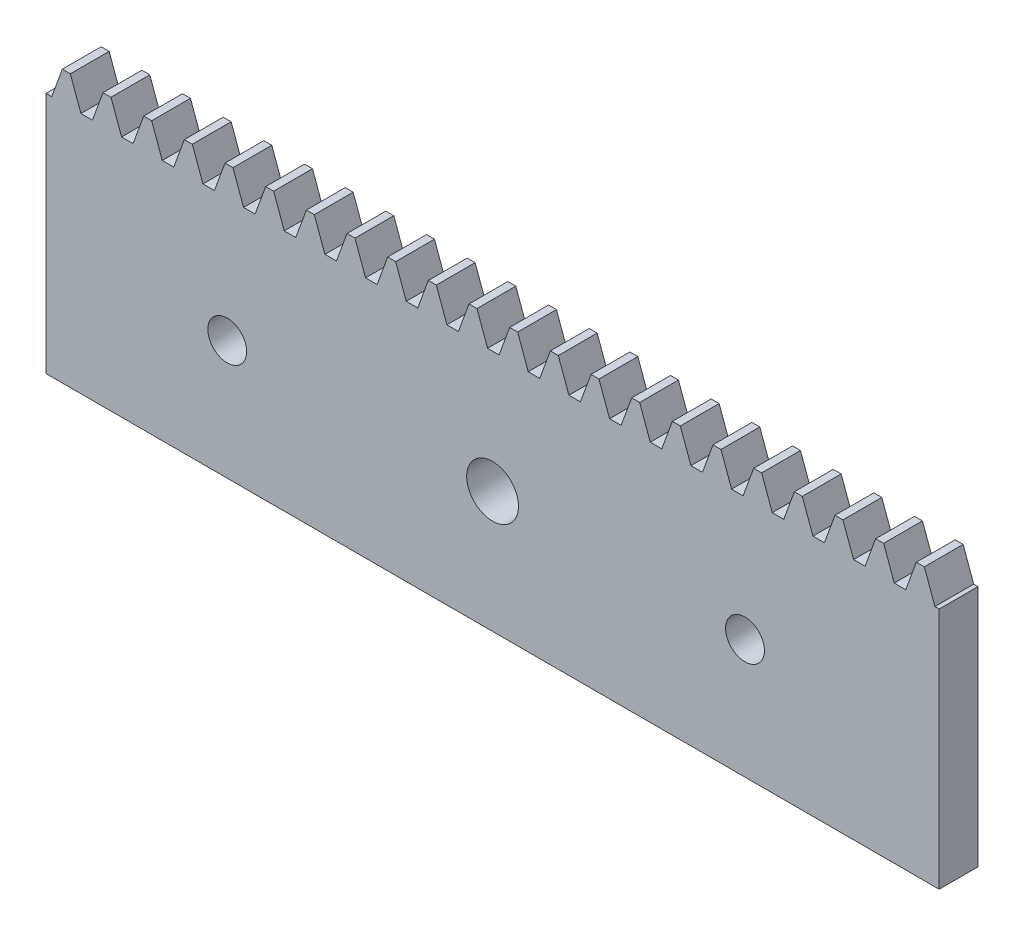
ISO-10303-21;
HEADER;
FILE_DESCRIPTION(('STEP AP214'),'2;1');
FILE_NAME('part.step','',(''),(''),'','','');
FILE_SCHEMA(('AUTOMOTIVE_DESIGN { 1 0 10303 214 1 1 1 1 }'));
ENDSEC;
DATA;
#1=APPLICATION_CONTEXT('core data for automotive mechanical design processes');
#2=APPLICATION_PROTOCOL_DEFINITION('international standard','automotive_design',2000,#1);
#3=PRODUCT_CONTEXT('',#1,'mechanical');
#4=PRODUCT('Part','Part','',(#3));
#5=PRODUCT_RELATED_PRODUCT_CATEGORY('part','',(#4));
#6=PRODUCT_DEFINITION_FORMATION('','',#4);
#7=PRODUCT_DEFINITION_CONTEXT('part definition',#1,'design');
#8=PRODUCT_DEFINITION('design','',#6,#7);
#9=PRODUCT_DEFINITION_SHAPE('','',#8);
#10=(LENGTH_UNIT() NAMED_UNIT(*) SI_UNIT(.MILLI.,.METRE.));
#11=(NAMED_UNIT(*) PLANE_ANGLE_UNIT() SI_UNIT($,.RADIAN.));
#12=(NAMED_UNIT(*) SI_UNIT($,.STERADIAN.) SOLID_ANGLE_UNIT());
#13=UNCERTAINTY_MEASURE_WITH_UNIT(LENGTH_MEASURE(1.E-05),#10,'distance_accuracy_value','');
#14=(GEOMETRIC_REPRESENTATION_CONTEXT(3) GLOBAL_UNCERTAINTY_ASSIGNED_CONTEXT((#13)) GLOBAL_UNIT_ASSIGNED_CONTEXT((#10,
#11,#12)) REPRESENTATION_CONTEXT('',''));
#15=CARTESIAN_POINT('',(0.,0.,0.));
#16=DIRECTION('',(0.,0.,1.));
#17=DIRECTION('',(1.,0.,0.));
#18=AXIS2_PLACEMENT_3D('',#15,#16,#17);
#19=CARTESIAN_POINT('',(0.,21.,-3.));
#20=DIRECTION('',(0.,1.,0.));
#21=DIRECTION('',(0.,0.,1.));
#22=AXIS2_PLACEMENT_3D('',#19,#20,#21);
#23=PLANE('',#22);
#24=DIRECTION('',(0.,0.,1.));
#25=VECTOR('',#24,1.);
#26=CARTESIAN_POINT('',(64.7100772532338,21.,-3.));
#27=LINE('',#26,#25);
#28=CARTESIAN_POINT('',(64.7100772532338,21.,-3.));
#29=VERTEX_POINT('',#28);
#30=CARTESIAN_POINT('',(64.7100772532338,21.,0.));
#31=VERTEX_POINT('',#30);
#32=EDGE_CURVE('E652',#29,#31,#27,.T.);
#33=ORIENTED_EDGE('',*,*,#32,.F.);
#34=DIRECTION('',(-1.,0.,0.));
#35=VECTOR('',#34,1.);
#36=CARTESIAN_POINT('',(0.,21.,-3.));
#37=LINE('',#36,#35);
#38=CARTESIAN_POINT('',(64.0952213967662,21.,-3.));
#39=VERTEX_POINT('',#38);
#40=EDGE_CURVE('E1163',#29,#39,#37,.T.);
#41=ORIENTED_EDGE('',*,*,#40,.T.);
#42=DIRECTION('',(0.,0.,-1.));
#43=VECTOR('',#42,1.);
#44=CARTESIAN_POINT('',(64.0952213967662,21.,-3.));
#45=LINE('',#44,#43);
#46=CARTESIAN_POINT('',(64.0952213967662,21.,0.));
#47=VERTEX_POINT('',#46);
#48=EDGE_CURVE('E672',#47,#39,#45,.T.);
#49=ORIENTED_EDGE('',*,*,#48,.F.);
#50=DIRECTION('',(-1.,0.,0.));
#51=VECTOR('',#50,1.);
#52=CARTESIAN_POINT('',(0.,21.,0.));
#53=LINE('',#52,#51);
#54=EDGE_CURVE('E1173',#31,#47,#53,.T.);
#55=ORIENTED_EDGE('',*,*,#54,.F.);
#56=EDGE_LOOP('',(#33,#41,#49,#55));
#57=FACE_BOUND('',#56,.T.);
#58=ADVANCED_FACE('F35',(#57),#23,.T.);
#59=DIRECTION('',(0.,0.,1.));
#60=VECTOR('',#59,1.);
#61=CARTESIAN_POINT('',(61.5684846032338,21.,-3.));
#62=LINE('',#61,#60);
#63=CARTESIAN_POINT('',(61.5684846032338,21.,-3.));
#64=VERTEX_POINT('',#63);
#65=CARTESIAN_POINT('',(61.5684846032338,21.,0.));
#66=VERTEX_POINT('',#65);
#67=EDGE_CURVE('E676',#64,#66,#62,.T.);
#68=ORIENTED_EDGE('',*,*,#67,.F.);
#69=CARTESIAN_POINT('',(60.9536287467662,21.,-3.));
#70=VERTEX_POINT('',#69);
#71=EDGE_CURVE('E1407',#64,#70,#37,.T.);
#72=ORIENTED_EDGE('',*,*,#71,.T.);
#73=DIRECTION('',(0.,0.,-1.));
#74=VECTOR('',#73,1.);
#75=CARTESIAN_POINT('',(60.9536287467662,21.,-3.));
#76=LINE('',#75,#74);
#77=CARTESIAN_POINT('',(60.9536287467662,21.,0.));
#78=VERTEX_POINT('',#77);
#79=EDGE_CURVE('E696',#78,#70,#76,.T.);
#80=ORIENTED_EDGE('',*,*,#79,.F.);
#81=EDGE_CURVE('E1252',#66,#78,#53,.T.);
#82=ORIENTED_EDGE('',*,*,#81,.F.);
#83=EDGE_LOOP('',(#68,#72,#80,#82));
#84=FACE_BOUND('',#83,.T.);
#85=ADVANCED_FACE('F1425',(#84),#23,.T.);
#86=DIRECTION('',(0.,0.,1.));
#87=VECTOR('',#86,1.);
#88=CARTESIAN_POINT('',(58.4268919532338,21.,-3.));
#89=LINE('',#88,#87);
#90=CARTESIAN_POINT('',(58.4268919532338,21.,-3.));
#91=VERTEX_POINT('',#90);
#92=CARTESIAN_POINT('',(58.4268919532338,21.,0.));
#93=VERTEX_POINT('',#92);
#94=EDGE_CURVE('E700',#91,#93,#89,.T.);
#95=ORIENTED_EDGE('',*,*,#94,.F.);
#96=CARTESIAN_POINT('',(57.8120360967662,21.,-3.));
#97=VERTEX_POINT('',#96);
#98=EDGE_CURVE('E1402',#91,#97,#37,.T.);
#99=ORIENTED_EDGE('',*,*,#98,.T.);
#100=DIRECTION('',(0.,0.,-1.));
#101=VECTOR('',#100,1.);
#102=CARTESIAN_POINT('',(57.8120360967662,21.,-3.));
#103=LINE('',#102,#101);
#104=CARTESIAN_POINT('',(57.8120360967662,21.,0.));
#105=VERTEX_POINT('',#104);
#106=EDGE_CURVE('E720',#105,#97,#103,.T.);
#107=ORIENTED_EDGE('',*,*,#106,.F.);
#108=EDGE_CURVE('E1253',#93,#105,#53,.T.);
#109=ORIENTED_EDGE('',*,*,#108,.F.);
#110=EDGE_LOOP('',(#95,#99,#107,#109));
#111=FACE_BOUND('',#110,.T.);
#112=ADVANCED_FACE('F1435',(#111),#23,.T.);
#113=DIRECTION('',(0.,0.,1.));
#114=VECTOR('',#113,1.);
#115=CARTESIAN_POINT('',(55.2852993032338,21.,-3.));
#116=LINE('',#115,#114);
#117=CARTESIAN_POINT('',(55.2852993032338,21.,-3.));
#118=VERTEX_POINT('',#117);
#119=CARTESIAN_POINT('',(55.2852993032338,21.,0.));
#120=VERTEX_POINT('',#119);
#121=EDGE_CURVE('E724',#118,#120,#116,.T.);
#122=ORIENTED_EDGE('',*,*,#121,.F.);
#123=CARTESIAN_POINT('',(54.6704434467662,21.,-3.));
#124=VERTEX_POINT('',#123);
#125=EDGE_CURVE('E1397',#118,#124,#37,.T.);
#126=ORIENTED_EDGE('',*,*,#125,.T.);
#127=DIRECTION('',(0.,0.,-1.));
#128=VECTOR('',#127,1.);
#129=CARTESIAN_POINT('',(54.6704434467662,21.,-3.));
#130=LINE('',#129,#128);
#131=CARTESIAN_POINT('',(54.6704434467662,21.,0.));
#132=VERTEX_POINT('',#131);
#133=EDGE_CURVE('E744',#132,#124,#130,.T.);
#134=ORIENTED_EDGE('',*,*,#133,.F.);
#135=EDGE_CURVE('E1256',#120,#132,#53,.T.);
#136=ORIENTED_EDGE('',*,*,#135,.F.);
#137=EDGE_LOOP('',(#122,#126,#134,#136));
#138=FACE_BOUND('',#137,.T.);
#139=ADVANCED_FACE('F1445',(#138),#23,.T.);
#140=DIRECTION('',(0.,0.,1.));
#141=VECTOR('',#140,1.);
#142=CARTESIAN_POINT('',(52.1437066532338,21.,-3.));
#143=LINE('',#142,#141);
#144=CARTESIAN_POINT('',(52.1437066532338,21.,-3.));
#145=VERTEX_POINT('',#144);
#146=CARTESIAN_POINT('',(52.1437066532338,21.,0.));
#147=VERTEX_POINT('',#146);
#148=EDGE_CURVE('E748',#145,#147,#143,.T.);
#149=ORIENTED_EDGE('',*,*,#148,.F.);
#150=CARTESIAN_POINT('',(51.5288507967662,21.,-3.));
#151=VERTEX_POINT('',#150);
#152=EDGE_CURVE('E1392',#145,#151,#37,.T.);
#153=ORIENTED_EDGE('',*,*,#152,.T.);
#154=DIRECTION('',(0.,0.,-1.));
#155=VECTOR('',#154,1.);
#156=CARTESIAN_POINT('',(51.5288507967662,21.,-3.));
#157=LINE('',#156,#155);
#158=CARTESIAN_POINT('',(51.5288507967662,21.,0.));
#159=VERTEX_POINT('',#158);
#160=EDGE_CURVE('E768',#159,#151,#157,.T.);
#161=ORIENTED_EDGE('',*,*,#160,.F.);
#162=EDGE_CURVE('E1259',#147,#159,#53,.T.);
#163=ORIENTED_EDGE('',*,*,#162,.F.);
#164=EDGE_LOOP('',(#149,#153,#161,#163));
#165=FACE_BOUND('',#164,.T.);
#166=ADVANCED_FACE('F1455',(#165),#23,.T.);
#167=DIRECTION('',(0.,0.,1.));
#168=VECTOR('',#167,1.);
#169=CARTESIAN_POINT('',(49.0021140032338,21.,-3.));
#170=LINE('',#169,#168);
#171=CARTESIAN_POINT('',(49.0021140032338,21.,-3.));
#172=VERTEX_POINT('',#171);
#173=CARTESIAN_POINT('',(49.0021140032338,21.,0.));
#174=VERTEX_POINT('',#173);
#175=EDGE_CURVE('E772',#172,#174,#170,.T.);
#176=ORIENTED_EDGE('',*,*,#175,.F.);
#177=CARTESIAN_POINT('',(48.3872581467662,21.,-3.));
#178=VERTEX_POINT('',#177);
#179=EDGE_CURVE('E1387',#172,#178,#37,.T.);
#180=ORIENTED_EDGE('',*,*,#179,.T.);
#181=DIRECTION('',(0.,0.,-1.));
#182=VECTOR('',#181,1.);
#183=CARTESIAN_POINT('',(48.3872581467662,21.,-3.));
#184=LINE('',#183,#182);
#185=CARTESIAN_POINT('',(48.3872581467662,21.,0.));
#186=VERTEX_POINT('',#185);
#187=EDGE_CURVE('E792',#186,#178,#184,.T.);
#188=ORIENTED_EDGE('',*,*,#187,.F.);
#189=EDGE_CURVE('E1262',#174,#186,#53,.T.);
#190=ORIENTED_EDGE('',*,*,#189,.F.);
#191=EDGE_LOOP('',(#176,#180,#188,#190));
#192=FACE_BOUND('',#191,.T.);
#193=ADVANCED_FACE('F1465',(#192),#23,.T.);
#194=DIRECTION('',(0.,0.,1.));
#195=VECTOR('',#194,1.);
#196=CARTESIAN_POINT('',(45.8605213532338,21.,-3.));
#197=LINE('',#196,#195);
#198=CARTESIAN_POINT('',(45.8605213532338,21.,-3.));
#199=VERTEX_POINT('',#198);
#200=CARTESIAN_POINT('',(45.8605213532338,21.,0.));
#201=VERTEX_POINT('',#200);
#202=EDGE_CURVE('E796',#199,#201,#197,.T.);
#203=ORIENTED_EDGE('',*,*,#202,.F.);
#204=CARTESIAN_POINT('',(45.2456654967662,21.,-3.));
#205=VERTEX_POINT('',#204);
#206=EDGE_CURVE('E1382',#199,#205,#37,.T.);
#207=ORIENTED_EDGE('',*,*,#206,.T.);
#208=DIRECTION('',(0.,0.,-1.));
#209=VECTOR('',#208,1.);
#210=CARTESIAN_POINT('',(45.2456654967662,21.,-3.));
#211=LINE('',#210,#209);
#212=CARTESIAN_POINT('',(45.2456654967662,21.,0.));
#213=VERTEX_POINT('',#212);
#214=EDGE_CURVE('E816',#213,#205,#211,.T.);
#215=ORIENTED_EDGE('',*,*,#214,.F.);
#216=EDGE_CURVE('E1265',#201,#213,#53,.T.);
#217=ORIENTED_EDGE('',*,*,#216,.F.);
#218=EDGE_LOOP('',(#203,#207,#215,#217));
#219=FACE_BOUND('',#218,.T.);
#220=ADVANCED_FACE('F1475',(#219),#23,.T.);
#221=DIRECTION('',(0.,0.,1.));
#222=VECTOR('',#221,1.);
#223=CARTESIAN_POINT('',(42.7189287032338,21.,-3.));
#224=LINE('',#223,#222);
#225=CARTESIAN_POINT('',(42.7189287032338,21.,-3.));
#226=VERTEX_POINT('',#225);
#227=CARTESIAN_POINT('',(42.7189287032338,21.,0.));
#228=VERTEX_POINT('',#227);
#229=EDGE_CURVE('E820',#226,#228,#224,.T.);
#230=ORIENTED_EDGE('',*,*,#229,.F.);
#231=CARTESIAN_POINT('',(42.1040728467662,21.,-3.));
#232=VERTEX_POINT('',#231);
#233=EDGE_CURVE('E1377',#226,#232,#37,.T.);
#234=ORIENTED_EDGE('',*,*,#233,.T.);
#235=DIRECTION('',(0.,0.,-1.));
#236=VECTOR('',#235,1.);
#237=CARTESIAN_POINT('',(42.1040728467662,21.,-3.));
#238=LINE('',#237,#236);
#239=CARTESIAN_POINT('',(42.1040728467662,21.,0.));
#240=VERTEX_POINT('',#239);
#241=EDGE_CURVE('E840',#240,#232,#238,.T.);
#242=ORIENTED_EDGE('',*,*,#241,.F.);
#243=EDGE_CURVE('E1268',#228,#240,#53,.T.);
#244=ORIENTED_EDGE('',*,*,#243,.F.);
#245=EDGE_LOOP('',(#230,#234,#242,#244));
#246=FACE_BOUND('',#245,.T.);
#247=ADVANCED_FACE('F1485',(#246),#23,.T.);
#248=DIRECTION('',(0.,0.,1.));
#249=VECTOR('',#248,1.);
#250=CARTESIAN_POINT('',(39.5773360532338,21.,-3.));
#251=LINE('',#250,#249);
#252=CARTESIAN_POINT('',(39.5773360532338,21.,-3.));
#253=VERTEX_POINT('',#252);
#254=CARTESIAN_POINT('',(39.5773360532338,21.,0.));
#255=VERTEX_POINT('',#254);
#256=EDGE_CURVE('E844',#253,#255,#251,.T.);
#257=ORIENTED_EDGE('',*,*,#256,.F.);
#258=CARTESIAN_POINT('',(38.9624801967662,21.,-3.));
#259=VERTEX_POINT('',#258);
#260=EDGE_CURVE('E1372',#253,#259,#37,.T.);
#261=ORIENTED_EDGE('',*,*,#260,.T.);
#262=DIRECTION('',(0.,0.,-1.));
#263=VECTOR('',#262,1.);
#264=CARTESIAN_POINT('',(38.9624801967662,21.,-3.));
#265=LINE('',#264,#263);
#266=CARTESIAN_POINT('',(38.9624801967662,21.,0.));
#267=VERTEX_POINT('',#266);
#268=EDGE_CURVE('E864',#267,#259,#265,.T.);
#269=ORIENTED_EDGE('',*,*,#268,.F.);
#270=EDGE_CURVE('E1271',#255,#267,#53,.T.);
#271=ORIENTED_EDGE('',*,*,#270,.F.);
#272=EDGE_LOOP('',(#257,#261,#269,#271));
#273=FACE_BOUND('',#272,.T.);
#274=ADVANCED_FACE('F1495',(#273),#23,.T.);
#275=DIRECTION('',(0.,0.,1.));
#276=VECTOR('',#275,1.);
#277=CARTESIAN_POINT('',(36.4357434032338,21.,-3.));
#278=LINE('',#277,#276);
#279=CARTESIAN_POINT('',(36.4357434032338,21.,-3.));
#280=VERTEX_POINT('',#279);
#281=CARTESIAN_POINT('',(36.4357434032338,21.,0.));
#282=VERTEX_POINT('',#281);
#283=EDGE_CURVE('E868',#280,#282,#278,.T.);
#284=ORIENTED_EDGE('',*,*,#283,.F.);
#285=CARTESIAN_POINT('',(35.8208875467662,21.,-3.));
#286=VERTEX_POINT('',#285);
#287=EDGE_CURVE('E1367',#280,#286,#37,.T.);
#288=ORIENTED_EDGE('',*,*,#287,.T.);
#289=DIRECTION('',(0.,0.,-1.));
#290=VECTOR('',#289,1.);
#291=CARTESIAN_POINT('',(35.8208875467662,21.,-3.));
#292=LINE('',#291,#290);
#293=CARTESIAN_POINT('',(35.8208875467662,21.,0.));
#294=VERTEX_POINT('',#293);
#295=EDGE_CURVE('E888',#294,#286,#292,.T.);
#296=ORIENTED_EDGE('',*,*,#295,.F.);
#297=EDGE_CURVE('E1274',#282,#294,#53,.T.);
#298=ORIENTED_EDGE('',*,*,#297,.F.);
#299=EDGE_LOOP('',(#284,#288,#296,#298));
#300=FACE_BOUND('',#299,.T.);
#301=ADVANCED_FACE('F1505',(#300),#23,.T.);
#302=DIRECTION('',(0.,0.,1.));
#303=VECTOR('',#302,1.);
#304=CARTESIAN_POINT('',(33.2941507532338,21.,-3.));
#305=LINE('',#304,#303);
#306=CARTESIAN_POINT('',(33.2941507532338,21.,-3.));
#307=VERTEX_POINT('',#306);
#308=CARTESIAN_POINT('',(33.2941507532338,21.,0.));
#309=VERTEX_POINT('',#308);
#310=EDGE_CURVE('E892',#307,#309,#305,.T.);
#311=ORIENTED_EDGE('',*,*,#310,.F.);
#312=CARTESIAN_POINT('',(32.6792948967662,21.,-3.));
#313=VERTEX_POINT('',#312);
#314=EDGE_CURVE('E1362',#307,#313,#37,.T.);
#315=ORIENTED_EDGE('',*,*,#314,.T.);
#316=DIRECTION('',(0.,0.,-1.));
#317=VECTOR('',#316,1.);
#318=CARTESIAN_POINT('',(32.6792948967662,21.,-3.));
#319=LINE('',#318,#317);
#320=CARTESIAN_POINT('',(32.6792948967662,21.,0.));
#321=VERTEX_POINT('',#320);
#322=EDGE_CURVE('E912',#321,#313,#319,.T.);
#323=ORIENTED_EDGE('',*,*,#322,.F.);
#324=EDGE_CURVE('E1277',#309,#321,#53,.T.);
#325=ORIENTED_EDGE('',*,*,#324,.F.);
#326=EDGE_LOOP('',(#311,#315,#323,#325));
#327=FACE_BOUND('',#326,.T.);
#328=ADVANCED_FACE('F1515',(#327),#23,.T.);
#329=DIRECTION('',(0.,0.,1.));
#330=VECTOR('',#329,1.);
#331=CARTESIAN_POINT('',(30.1525581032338,21.,-3.));
#332=LINE('',#331,#330);
#333=CARTESIAN_POINT('',(30.1525581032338,21.,-3.));
#334=VERTEX_POINT('',#333);
#335=CARTESIAN_POINT('',(30.1525581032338,21.,0.));
#336=VERTEX_POINT('',#335);
#337=EDGE_CURVE('E916',#334,#336,#332,.T.);
#338=ORIENTED_EDGE('',*,*,#337,.F.);
#339=CARTESIAN_POINT('',(29.5377022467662,21.,-3.));
#340=VERTEX_POINT('',#339);
#341=EDGE_CURVE('E1357',#334,#340,#37,.T.);
#342=ORIENTED_EDGE('',*,*,#341,.T.);
#343=DIRECTION('',(0.,0.,-1.));
#344=VECTOR('',#343,1.);
#345=CARTESIAN_POINT('',(29.5377022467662,21.,-3.));
#346=LINE('',#345,#344);
#347=CARTESIAN_POINT('',(29.5377022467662,21.,0.));
#348=VERTEX_POINT('',#347);
#349=EDGE_CURVE('E936',#348,#340,#346,.T.);
#350=ORIENTED_EDGE('',*,*,#349,.F.);
#351=EDGE_CURVE('E1280',#336,#348,#53,.T.);
#352=ORIENTED_EDGE('',*,*,#351,.F.);
#353=EDGE_LOOP('',(#338,#342,#350,#352));
#354=FACE_BOUND('',#353,.T.);
#355=ADVANCED_FACE('F1525',(#354),#23,.T.);
#356=DIRECTION('',(0.,0.,1.));
#357=VECTOR('',#356,1.);
#358=CARTESIAN_POINT('',(27.0109654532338,21.,-3.));
#359=LINE('',#358,#357);
#360=CARTESIAN_POINT('',(27.0109654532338,21.,-3.));
#361=VERTEX_POINT('',#360);
#362=CARTESIAN_POINT('',(27.0109654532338,21.,0.));
#363=VERTEX_POINT('',#362);
#364=EDGE_CURVE('E940',#361,#363,#359,.T.);
#365=ORIENTED_EDGE('',*,*,#364,.F.);
#366=CARTESIAN_POINT('',(26.3961095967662,21.,-3.));
#367=VERTEX_POINT('',#366);
#368=EDGE_CURVE('E1352',#361,#367,#37,.T.);
#369=ORIENTED_EDGE('',*,*,#368,.T.);
#370=DIRECTION('',(0.,0.,-1.));
#371=VECTOR('',#370,1.);
#372=CARTESIAN_POINT('',(26.3961095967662,21.,-3.));
#373=LINE('',#372,#371);
#374=CARTESIAN_POINT('',(26.3961095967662,21.,0.));
#375=VERTEX_POINT('',#374);
#376=EDGE_CURVE('E960',#375,#367,#373,.T.);
#377=ORIENTED_EDGE('',*,*,#376,.F.);
#378=EDGE_CURVE('E1283',#363,#375,#53,.T.);
#379=ORIENTED_EDGE('',*,*,#378,.F.);
#380=EDGE_LOOP('',(#365,#369,#377,#379));
#381=FACE_BOUND('',#380,.T.);
#382=ADVANCED_FACE('F1535',(#381),#23,.T.);
#383=DIRECTION('',(0.,0.,1.));
#384=VECTOR('',#383,1.);
#385=CARTESIAN_POINT('',(23.8693728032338,21.,-3.));
#386=LINE('',#385,#384);
#387=CARTESIAN_POINT('',(23.8693728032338,21.,-3.));
#388=VERTEX_POINT('',#387);
#389=CARTESIAN_POINT('',(23.8693728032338,21.,0.));
#390=VERTEX_POINT('',#389);
#391=EDGE_CURVE('E964',#388,#390,#386,.T.);
#392=ORIENTED_EDGE('',*,*,#391,.F.);
#393=CARTESIAN_POINT('',(23.2545169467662,21.,-3.));
#394=VERTEX_POINT('',#393);
#395=EDGE_CURVE('E1347',#388,#394,#37,.T.);
#396=ORIENTED_EDGE('',*,*,#395,.T.);
#397=DIRECTION('',(0.,0.,-1.));
#398=VECTOR('',#397,1.);
#399=CARTESIAN_POINT('',(23.2545169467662,21.,-3.));
#400=LINE('',#399,#398);
#401=CARTESIAN_POINT('',(23.2545169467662,21.,0.));
#402=VERTEX_POINT('',#401);
#403=EDGE_CURVE('E984',#402,#394,#400,.T.);
#404=ORIENTED_EDGE('',*,*,#403,.F.);
#405=EDGE_CURVE('E1286',#390,#402,#53,.T.);
#406=ORIENTED_EDGE('',*,*,#405,.F.);
#407=EDGE_LOOP('',(#392,#396,#404,#406));
#408=FACE_BOUND('',#407,.T.);
#409=ADVANCED_FACE('F1545',(#408),#23,.T.);
#410=DIRECTION('',(0.,0.,1.));
#411=VECTOR('',#410,1.);
#412=CARTESIAN_POINT('',(20.7277801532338,21.,-3.));
#413=LINE('',#412,#411);
#414=CARTESIAN_POINT('',(20.7277801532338,21.,-3.));
#415=VERTEX_POINT('',#414);
#416=CARTESIAN_POINT('',(20.7277801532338,21.,0.));
#417=VERTEX_POINT('',#416);
#418=EDGE_CURVE('E988',#415,#417,#413,.T.);
#419=ORIENTED_EDGE('',*,*,#418,.F.);
#420=CARTESIAN_POINT('',(20.1129242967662,21.,-3.));
#421=VERTEX_POINT('',#420);
#422=EDGE_CURVE('E1342',#415,#421,#37,.T.);
#423=ORIENTED_EDGE('',*,*,#422,.T.);
#424=DIRECTION('',(0.,0.,-1.));
#425=VECTOR('',#424,1.);
#426=CARTESIAN_POINT('',(20.1129242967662,21.,-3.));
#427=LINE('',#426,#425);
#428=CARTESIAN_POINT('',(20.1129242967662,21.,0.));
#429=VERTEX_POINT('',#428);
#430=EDGE_CURVE('E1008',#429,#421,#427,.T.);
#431=ORIENTED_EDGE('',*,*,#430,.F.);
#432=EDGE_CURVE('E1289',#417,#429,#53,.T.);
#433=ORIENTED_EDGE('',*,*,#432,.F.);
#434=EDGE_LOOP('',(#419,#423,#431,#433));
#435=FACE_BOUND('',#434,.T.);
#436=ADVANCED_FACE('F1555',(#435),#23,.T.);
#437=DIRECTION('',(0.,0.,1.));
#438=VECTOR('',#437,1.);
#439=CARTESIAN_POINT('',(17.5861875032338,21.,-3.));
#440=LINE('',#439,#438);
#441=CARTESIAN_POINT('',(17.5861875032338,21.,-3.));
#442=VERTEX_POINT('',#441);
#443=CARTESIAN_POINT('',(17.5861875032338,21.,0.));
#444=VERTEX_POINT('',#443);
#445=EDGE_CURVE('E1012',#442,#444,#440,.T.);
#446=ORIENTED_EDGE('',*,*,#445,.F.);
#447=CARTESIAN_POINT('',(16.9713316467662,21.,-3.));
#448=VERTEX_POINT('',#447);
#449=EDGE_CURVE('E1337',#442,#448,#37,.T.);
#450=ORIENTED_EDGE('',*,*,#449,.T.);
#451=DIRECTION('',(0.,0.,-1.));
#452=VECTOR('',#451,1.);
#453=CARTESIAN_POINT('',(16.9713316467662,21.,-3.));
#454=LINE('',#453,#452);
#455=CARTESIAN_POINT('',(16.9713316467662,21.,0.));
#456=VERTEX_POINT('',#455);
#457=EDGE_CURVE('E1032',#456,#448,#454,.T.);
#458=ORIENTED_EDGE('',*,*,#457,.F.);
#459=EDGE_CURVE('E1292',#444,#456,#53,.T.);
#460=ORIENTED_EDGE('',*,*,#459,.F.);
#461=EDGE_LOOP('',(#446,#450,#458,#460));
#462=FACE_BOUND('',#461,.T.);
#463=ADVANCED_FACE('F1565',(#462),#23,.T.);
#464=DIRECTION('',(0.,0.,1.));
#465=VECTOR('',#464,1.);
#466=CARTESIAN_POINT('',(14.4445948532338,21.,-3.));
#467=LINE('',#466,#465);
#468=CARTESIAN_POINT('',(14.4445948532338,21.,-3.));
#469=VERTEX_POINT('',#468);
#470=CARTESIAN_POINT('',(14.4445948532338,21.,0.));
#471=VERTEX_POINT('',#470);
#472=EDGE_CURVE('E1036',#469,#471,#467,.T.);
#473=ORIENTED_EDGE('',*,*,#472,.F.);
#474=CARTESIAN_POINT('',(13.8297389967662,21.,-3.));
#475=VERTEX_POINT('',#474);
#476=EDGE_CURVE('E1332',#469,#475,#37,.T.);
#477=ORIENTED_EDGE('',*,*,#476,.T.);
#478=DIRECTION('',(0.,0.,-1.));
#479=VECTOR('',#478,1.);
#480=CARTESIAN_POINT('',(13.8297389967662,21.,-3.));
#481=LINE('',#480,#479);
#482=CARTESIAN_POINT('',(13.8297389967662,21.,0.));
#483=VERTEX_POINT('',#482);
#484=EDGE_CURVE('E1056',#483,#475,#481,.T.);
#485=ORIENTED_EDGE('',*,*,#484,.F.);
#486=EDGE_CURVE('E1295',#471,#483,#53,.T.);
#487=ORIENTED_EDGE('',*,*,#486,.F.);
#488=EDGE_LOOP('',(#473,#477,#485,#487));
#489=FACE_BOUND('',#488,.T.);
#490=ADVANCED_FACE('F1575',(#489),#23,.T.);
#491=DIRECTION('',(0.,0.,1.));
#492=VECTOR('',#491,1.);
#493=CARTESIAN_POINT('',(11.3030022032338,21.,-3.));
#494=LINE('',#493,#492);
#495=CARTESIAN_POINT('',(11.3030022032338,21.,-3.));
#496=VERTEX_POINT('',#495);
#497=CARTESIAN_POINT('',(11.3030022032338,21.,0.));
#498=VERTEX_POINT('',#497);
#499=EDGE_CURVE('E1060',#496,#498,#494,.T.);
#500=ORIENTED_EDGE('',*,*,#499,.F.);
#501=CARTESIAN_POINT('',(10.6881463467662,21.,-3.));
#502=VERTEX_POINT('',#501);
#503=EDGE_CURVE('E1327',#496,#502,#37,.T.);
#504=ORIENTED_EDGE('',*,*,#503,.T.);
#505=DIRECTION('',(0.,0.,-1.));
#506=VECTOR('',#505,1.);
#507=CARTESIAN_POINT('',(10.6881463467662,21.,-3.));
#508=LINE('',#507,#506);
#509=CARTESIAN_POINT('',(10.6881463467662,21.,0.));
#510=VERTEX_POINT('',#509);
#511=EDGE_CURVE('E1080',#510,#502,#508,.T.);
#512=ORIENTED_EDGE('',*,*,#511,.F.);
#513=EDGE_CURVE('E1298',#498,#510,#53,.T.);
#514=ORIENTED_EDGE('',*,*,#513,.F.);
#515=EDGE_LOOP('',(#500,#504,#512,#514));
#516=FACE_BOUND('',#515,.T.);
#517=ADVANCED_FACE('F1585',(#516),#23,.T.);
#518=DIRECTION('',(0.,0.,1.));
#519=VECTOR('',#518,1.);
#520=CARTESIAN_POINT('',(8.16140955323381,21.,-3.));
#521=LINE('',#520,#519);
#522=CARTESIAN_POINT('',(8.1614095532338,21.,-3.));
#523=VERTEX_POINT('',#522);
#524=CARTESIAN_POINT('',(8.1614095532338,21.,0.));
#525=VERTEX_POINT('',#524);
#526=EDGE_CURVE('E1084',#523,#525,#521,.T.);
#527=ORIENTED_EDGE('',*,*,#526,.F.);
#528=CARTESIAN_POINT('',(7.5465536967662,21.,-3.));
#529=VERTEX_POINT('',#528);
#530=EDGE_CURVE('E1322',#523,#529,#37,.T.);
#531=ORIENTED_EDGE('',*,*,#530,.T.);
#532=DIRECTION('',(0.,0.,-1.));
#533=VECTOR('',#532,1.);
#534=CARTESIAN_POINT('',(7.5465536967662,21.,-3.));
#535=LINE('',#534,#533);
#536=CARTESIAN_POINT('',(7.5465536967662,21.,0.));
#537=VERTEX_POINT('',#536);
#538=EDGE_CURVE('E1104',#537,#529,#535,.T.);
#539=ORIENTED_EDGE('',*,*,#538,.F.);
#540=EDGE_CURVE('E1301',#525,#537,#53,.T.);
#541=ORIENTED_EDGE('',*,*,#540,.F.);
#542=EDGE_LOOP('',(#527,#531,#539,#541));
#543=FACE_BOUND('',#542,.T.);
#544=ADVANCED_FACE('F1595',(#543),#23,.T.);
#545=DIRECTION('',(0.,0.,1.));
#546=VECTOR('',#545,1.);
#547=CARTESIAN_POINT('',(5.0198169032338,21.,-3.));
#548=LINE('',#547,#546);
#549=CARTESIAN_POINT('',(5.0198169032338,21.,-3.));
#550=VERTEX_POINT('',#549);
#551=CARTESIAN_POINT('',(5.0198169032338,21.,0.));
#552=VERTEX_POINT('',#551);
#553=EDGE_CURVE('E1108',#550,#552,#548,.T.);
#554=ORIENTED_EDGE('',*,*,#553,.F.);
#555=CARTESIAN_POINT('',(4.4049610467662,21.,-3.));
#556=VERTEX_POINT('',#555);
#557=EDGE_CURVE('E1321',#550,#556,#37,.T.);
#558=ORIENTED_EDGE('',*,*,#557,.T.);
#559=DIRECTION('',(0.,0.,-1.));
#560=VECTOR('',#559,1.);
#561=CARTESIAN_POINT('',(4.4049610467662,21.,-3.));
#562=LINE('',#561,#560);
#563=CARTESIAN_POINT('',(4.4049610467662,21.,0.));
#564=VERTEX_POINT('',#563);
#565=EDGE_CURVE('E1128',#564,#556,#562,.T.);
#566=ORIENTED_EDGE('',*,*,#565,.F.);
#567=EDGE_CURVE('E1304',#552,#564,#53,.T.);
#568=ORIENTED_EDGE('',*,*,#567,.F.);
#569=EDGE_LOOP('',(#554,#558,#566,#568));
#570=FACE_BOUND('',#569,.T.);
#571=ADVANCED_FACE('F1605',(#570),#23,.T.);
#572=DIRECTION('',(0.,0.,1.));
#573=VECTOR('',#572,1.);
#574=CARTESIAN_POINT('',(1.8782242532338,21.,-3.));
#575=LINE('',#574,#573);
#576=CARTESIAN_POINT('',(1.8782242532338,21.,-3.));
#577=VERTEX_POINT('',#576);
#578=CARTESIAN_POINT('',(1.8782242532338,21.,0.));
#579=VERTEX_POINT('',#578);
#580=EDGE_CURVE('E1132',#577,#579,#575,.T.);
#581=ORIENTED_EDGE('',*,*,#580,.F.);
#582=CARTESIAN_POINT('',(1.2633683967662,21.,-3.));
#583=VERTEX_POINT('',#582);
#584=EDGE_CURVE('E1160',#577,#583,#37,.T.);
#585=ORIENTED_EDGE('',*,*,#584,.T.);
#586=DIRECTION('',(0.,0.,-1.));
#587=VECTOR('',#586,1.);
#588=CARTESIAN_POINT('',(1.2633683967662,21.,-3.));
#589=LINE('',#588,#587);
#590=CARTESIAN_POINT('',(1.2633683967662,21.,0.));
#591=VERTEX_POINT('',#590);
#592=EDGE_CURVE('E1148',#591,#583,#589,.T.);
#593=ORIENTED_EDGE('',*,*,#592,.F.);
#594=EDGE_CURVE('E1171',#579,#591,#53,.T.);
#595=ORIENTED_EDGE('',*,*,#594,.F.);
#596=EDGE_LOOP('',(#581,#585,#593,#595));
#597=FACE_BOUND('',#596,.T.);
#598=ADVANCED_FACE('F1319',(#597),#23,.T.);
#599=CARTESIAN_POINT('',(0.,0.,-3.));
#600=DIRECTION('',(-1.,0.,0.));
#601=DIRECTION('',(0.,0.,1.));
#602=AXIS2_PLACEMENT_3D('',#599,#600,#601);
#603=PLANE('',#602);
#604=DIRECTION('',(0.,0.,1.));
#605=VECTOR('',#604,1.);
#606=CARTESIAN_POINT('',(0.,18.75,-3.));
#607=LINE('',#606,#605);
#608=CARTESIAN_POINT('',(0.,18.75,-3.));
#609=VERTEX_POINT('',#608);
#610=CARTESIAN_POINT('',(0.,18.75,0.));
#611=VERTEX_POINT('',#610);
#612=EDGE_CURVE('E1146',#609,#611,#607,.T.);
#613=ORIENTED_EDGE('',*,*,#612,.F.);
#614=DIRECTION('',(0.,-1.,0.));
#615=VECTOR('',#614,1.);
#616=CARTESIAN_POINT('',(0.,0.,-3.));
#617=LINE('',#616,#615);
#618=CARTESIAN_POINT('',(0.,0.,-3.));
#619=VERTEX_POINT('',#618);
#620=EDGE_CURVE('E1152',#609,#619,#617,.T.);
#621=ORIENTED_EDGE('',*,*,#620,.T.);
#622=DIRECTION('',(0.,0.,1.));
#623=VECTOR('',#622,1.);
#624=CARTESIAN_POINT('',(0.,0.,-3.));
#625=LINE('',#624,#623);
#626=CARTESIAN_POINT('',(0.,0.,0.));
#627=VERTEX_POINT('',#626);
#628=EDGE_CURVE('E1162',#619,#627,#625,.T.);
#629=ORIENTED_EDGE('',*,*,#628,.T.);
#630=DIRECTION('',(0.,-1.,0.));
#631=VECTOR('',#630,1.);
#632=CARTESIAN_POINT('',(0.,0.,0.));
#633=LINE('',#632,#631);
#634=EDGE_CURVE('E1151',#611,#627,#633,.T.);
#635=ORIENTED_EDGE('',*,*,#634,.F.);
#636=EDGE_LOOP('',(#613,#621,#629,#635));
#637=FACE_BOUND('',#636,.T.);
#638=ADVANCED_FACE('F37',(#637),#603,.T.);
#639=DIRECTION('',(0.,0.,1.));
#640=VECTOR('',#639,1.);
#641=CARTESIAN_POINT('',(67.8516699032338,21.,-3.));
#642=LINE('',#641,#640);
#643=CARTESIAN_POINT('',(67.8516699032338,21.,-3.));
#644=VERTEX_POINT('',#643);
#645=CARTESIAN_POINT('',(67.8516699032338,21.,0.));
#646=VERTEX_POINT('',#645);
#647=EDGE_CURVE('E631',#644,#646,#642,.T.);
#648=ORIENTED_EDGE('',*,*,#647,.F.);
#649=CARTESIAN_POINT('',(67.2368140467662,21.,-3.));
#650=VERTEX_POINT('',#649);
#651=EDGE_CURVE('E621',#644,#650,#37,.T.);
#652=ORIENTED_EDGE('',*,*,#651,.T.);
#653=DIRECTION('',(0.,0.,-1.));
#654=VECTOR('',#653,1.);
#655=CARTESIAN_POINT('',(67.2368140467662,21.,-3.));
#656=LINE('',#655,#654);
#657=CARTESIAN_POINT('',(67.2368140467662,21.,0.));
#658=VERTEX_POINT('',#657);
#659=EDGE_CURVE('E648',#658,#650,#656,.T.);
#660=ORIENTED_EDGE('',*,*,#659,.F.);
#661=EDGE_CURVE('E1155',#646,#658,#53,.T.);
#662=ORIENTED_EDGE('',*,*,#661,.F.);
#663=EDGE_LOOP('',(#648,#652,#660,#662));
#664=FACE_BOUND('',#663,.T.);
#665=ADVANCED_FACE('F1628',(#664),#23,.T.);
#666=CARTESIAN_POINT('',(69.,0.,-3.));
#667=DIRECTION('',(1.,0.,0.));
#668=DIRECTION('',(0.,0.,-1.));
#669=AXIS2_PLACEMENT_3D('',#666,#667,#668);
#670=PLANE('',#669);
#671=DIRECTION('',(0.,0.,-1.));
#672=VECTOR('',#671,1.);
#673=CARTESIAN_POINT('',(69.,18.75,-3.));
#674=LINE('',#673,#672);
#675=CARTESIAN_POINT('',(69.,18.75,0.));
#676=VERTEX_POINT('',#675);
#677=CARTESIAN_POINT('',(69.,18.75,-3.));
#678=VERTEX_POINT('',#677);
#679=EDGE_CURVE('E608',#676,#678,#674,.T.);
#680=ORIENTED_EDGE('',*,*,#679,.F.);
#681=DIRECTION('',(0.,1.,0.));
#682=VECTOR('',#681,1.);
#683=CARTESIAN_POINT('',(69.,0.,0.));
#684=LINE('',#683,#682);
#685=CARTESIAN_POINT('',(69.,0.,0.));
#686=VERTEX_POINT('',#685);
#687=EDGE_CURVE('E1168',#686,#676,#684,.T.);
#688=ORIENTED_EDGE('',*,*,#687,.F.);
#689=DIRECTION('',(0.,0.,1.));
#690=VECTOR('',#689,1.);
#691=CARTESIAN_POINT('',(69.,0.,-3.));
#692=LINE('',#691,#690);
#693=CARTESIAN_POINT('',(69.,0.,-3.));
#694=VERTEX_POINT('',#693);
#695=EDGE_CURVE('E1174',#694,#686,#692,.T.);
#696=ORIENTED_EDGE('',*,*,#695,.F.);
#697=DIRECTION('',(0.,1.,0.));
#698=VECTOR('',#697,1.);
#699=CARTESIAN_POINT('',(69.,0.,-3.));
#700=LINE('',#699,#698);
#701=EDGE_CURVE('E1158',#694,#678,#700,.T.);
#702=ORIENTED_EDGE('',*,*,#701,.T.);
#703=EDGE_LOOP('',(#680,#688,#696,#702));
#704=FACE_BOUND('',#703,.T.);
#705=ADVANCED_FACE('F1635',(#704),#670,.T.);
#706=CARTESIAN_POINT('',(0.,0.,-3.));
#707=DIRECTION('',(0.,-1.,0.));
#708=DIRECTION('',(0.,0.,-1.));
#709=AXIS2_PLACEMENT_3D('',#706,#707,#708);
#710=PLANE('',#709);
#711=DIRECTION('',(1.,0.,0.));
#712=VECTOR('',#711,1.);
#713=CARTESIAN_POINT('',(0.,0.,0.));
#714=LINE('',#713,#712);
#715=EDGE_CURVE('E1165',#627,#686,#714,.T.);
#716=ORIENTED_EDGE('',*,*,#715,.F.);
#717=ORIENTED_EDGE('',*,*,#628,.F.);
#718=DIRECTION('',(1.,0.,0.));
#719=VECTOR('',#718,1.);
#720=CARTESIAN_POINT('',(0.,0.,-3.));
#721=LINE('',#720,#719);
#722=EDGE_CURVE('E1154',#619,#694,#721,.T.);
#723=ORIENTED_EDGE('',*,*,#722,.T.);
#724=ORIENTED_EDGE('',*,*,#695,.T.);
#725=EDGE_LOOP('',(#716,#717,#723,#724));
#726=FACE_BOUND('',#725,.T.);
#727=ADVANCED_FACE('F1641',(#726),#710,.T.);
#728=CARTESIAN_POINT('',(0.,21.,-3.));
#729=DIRECTION('',(0.,0.,-1.));
#730=DIRECTION('',(-1.,0.,0.));
#731=AXIS2_PLACEMENT_3D('',#728,#729,#730);
#732=PLANE('',#731);
#733=CARTESIAN_POINT('',(34.5,9.375,-3.));
#734=DIRECTION('',(0.,0.,-1.));
#735=DIRECTION('',(-1.,0.,0.));
#736=AXIS2_PLACEMENT_3D('',#733,#734,#735);
#737=CIRCLE('',#736,2.);
#738=CARTESIAN_POINT('',(36.5,9.375,-3.));
#739=VERTEX_POINT('',#738);
#740=EDGE_CURVE('E2429',#739,#739,#737,.F.);
#741=ORIENTED_EDGE('',*,*,#740,.T.);
#742=EDGE_LOOP('',(#741));
#743=FACE_BOUND('',#742,.T.);
#744=CARTESIAN_POINT('',(14.,9.2160135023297,-3.));
#745=DIRECTION('',(0.,0.,-1.));
#746=DIRECTION('',(-1.,0.,0.));
#747=AXIS2_PLACEMENT_3D('',#744,#745,#746);
#748=CIRCLE('',#747,1.5);
#749=CARTESIAN_POINT('',(15.5,9.2160135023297,-3.));
#750=VERTEX_POINT('',#749);
#751=EDGE_CURVE('E2422',#750,#750,#748,.F.);
#752=ORIENTED_EDGE('',*,*,#751,.T.);
#753=EDGE_LOOP('',(#752));
#754=FACE_BOUND('',#753,.T.);
#755=CARTESIAN_POINT('',(54.,9.2160135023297,-3.));
#756=DIRECTION('',(0.,0.,-1.));
#757=DIRECTION('',(-1.,0.,0.));
#758=AXIS2_PLACEMENT_3D('',#755,#756,#757);
#759=CIRCLE('',#758,1.5);
#760=CARTESIAN_POINT('',(55.5,9.2160135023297,-3.));
#761=VERTEX_POINT('',#760);
#762=EDGE_CURVE('E627',#761,#761,#759,.F.);
#763=ORIENTED_EDGE('',*,*,#762,.T.);
#764=EDGE_LOOP('',(#763));
#765=FACE_BOUND('',#764,.T.);
#766=DIRECTION('',(0.342020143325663,-0.939692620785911,0.));
#767=VECTOR('',#766,1.);
#768=CARTESIAN_POINT('',(67.8424250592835,21.0254,-3.));
#769=LINE('',#768,#767);
#770=CARTESIAN_POINT('',(68.6706029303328,18.75,-3.));
#771=VERTEX_POINT('',#770);
#772=EDGE_CURVE('E605',#644,#771,#769,.T.);
#773=ORIENTED_EDGE('',*,*,#772,.T.);
#774=DIRECTION('',(1.,0.,0.));
#775=VECTOR('',#774,1.);
#776=CARTESIAN_POINT('',(69.5594736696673,18.75,-3.));
#777=LINE('',#776,#775);
#778=EDGE_CURVE('E609',#771,#678,#777,.T.);
#779=ORIENTED_EDGE('',*,*,#778,.T.);
#780=ORIENTED_EDGE('',*,*,#701,.F.);
#781=ORIENTED_EDGE('',*,*,#722,.F.);
#782=ORIENTED_EDGE('',*,*,#620,.F.);
#783=DIRECTION('',(1.,0.,0.));
#784=VECTOR('',#783,1.);
#785=CARTESIAN_POINT('',(0.444435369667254,18.75,-3.));
#786=LINE('',#785,#784);
#787=CARTESIAN_POINT('',(0.444435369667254,18.75,-3.));
#788=VERTEX_POINT('',#787);
#789=EDGE_CURVE('E1135',#609,#788,#786,.T.);
#790=ORIENTED_EDGE('',*,*,#789,.T.);
#791=DIRECTION('',(0.342020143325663,0.939692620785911,0.));
#792=VECTOR('',#791,1.);
#793=CARTESIAN_POINT('',(1.27261324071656,21.0254,-3.));
#794=LINE('',#793,#792);
#795=EDGE_CURVE('E1138',#788,#583,#794,.T.);
#796=ORIENTED_EDGE('',*,*,#795,.T.);
#797=ORIENTED_EDGE('',*,*,#584,.F.);
#798=DIRECTION('',(0.342020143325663,-0.939692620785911,0.));
#799=VECTOR('',#798,1.);
#800=CARTESIAN_POINT('',(1.86897940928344,21.0254,-3.));
#801=LINE('',#800,#799);
#802=CARTESIAN_POINT('',(2.69715728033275,18.75,-3.));
#803=VERTEX_POINT('',#802);
#804=EDGE_CURVE('E1111',#577,#803,#801,.T.);
#805=ORIENTED_EDGE('',*,*,#804,.T.);
#806=DIRECTION('',(1.,0.,0.));
#807=VECTOR('',#806,1.);
#808=CARTESIAN_POINT('',(3.58602801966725,18.75,-3.));
#809=LINE('',#808,#807);
#810=CARTESIAN_POINT('',(3.58602801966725,18.75,-3.));
#811=VERTEX_POINT('',#810);
#812=EDGE_CURVE('E1114',#803,#811,#809,.T.);
#813=ORIENTED_EDGE('',*,*,#812,.T.);
#814=DIRECTION('',(0.342020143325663,0.939692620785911,0.));
#815=VECTOR('',#814,1.);
#816=CARTESIAN_POINT('',(4.41420589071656,21.0254,-3.));
#817=LINE('',#816,#815);
#818=EDGE_CURVE('E1118',#811,#556,#817,.T.);
#819=ORIENTED_EDGE('',*,*,#818,.T.);
#820=ORIENTED_EDGE('',*,*,#557,.F.);
#821=DIRECTION('',(0.342020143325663,-0.939692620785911,0.));
#822=VECTOR('',#821,1.);
#823=CARTESIAN_POINT('',(5.01057205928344,21.0254,-3.));
#824=LINE('',#823,#822);
#825=CARTESIAN_POINT('',(5.83874993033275,18.75,-3.));
#826=VERTEX_POINT('',#825);
#827=EDGE_CURVE('E1087',#550,#826,#824,.T.);
#828=ORIENTED_EDGE('',*,*,#827,.T.);
#829=DIRECTION('',(1.,0.,0.));
#830=VECTOR('',#829,1.);
#831=CARTESIAN_POINT('',(6.72762066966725,18.75,-3.));
#832=LINE('',#831,#830);
#833=CARTESIAN_POINT('',(6.72762066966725,18.75,-3.));
#834=VERTEX_POINT('',#833);
#835=EDGE_CURVE('E1090',#826,#834,#832,.T.);
#836=ORIENTED_EDGE('',*,*,#835,.T.);
#837=DIRECTION('',(0.342020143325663,0.939692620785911,0.));
#838=VECTOR('',#837,1.);
#839=CARTESIAN_POINT('',(7.55579854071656,21.0254,-3.));
#840=LINE('',#839,#838);
#841=EDGE_CURVE('E1094',#834,#529,#840,.T.);
#842=ORIENTED_EDGE('',*,*,#841,.T.);
#843=ORIENTED_EDGE('',*,*,#530,.F.);
#844=DIRECTION('',(0.342020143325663,-0.939692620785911,0.));
#845=VECTOR('',#844,1.);
#846=CARTESIAN_POINT('',(8.15216470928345,21.0254,-3.));
#847=LINE('',#846,#845);
#848=CARTESIAN_POINT('',(8.98034258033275,18.75,-3.));
#849=VERTEX_POINT('',#848);
#850=EDGE_CURVE('E1063',#523,#849,#847,.T.);
#851=ORIENTED_EDGE('',*,*,#850,.T.);
#852=DIRECTION('',(1.,0.,0.));
#853=VECTOR('',#852,1.);
#854=CARTESIAN_POINT('',(9.86921331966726,18.75,-3.));
#855=LINE('',#854,#853);
#856=CARTESIAN_POINT('',(9.86921331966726,18.75,-3.));
#857=VERTEX_POINT('',#856);
#858=EDGE_CURVE('E1066',#849,#857,#855,.T.);
#859=ORIENTED_EDGE('',*,*,#858,.T.);
#860=DIRECTION('',(0.342020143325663,0.939692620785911,0.));
#861=VECTOR('',#860,1.);
#862=CARTESIAN_POINT('',(10.6973911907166,21.0254,-3.));
#863=LINE('',#862,#861);
#864=EDGE_CURVE('E1070',#857,#502,#863,.T.);
#865=ORIENTED_EDGE('',*,*,#864,.T.);
#866=ORIENTED_EDGE('',*,*,#503,.F.);
#867=DIRECTION('',(0.342020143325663,-0.939692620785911,0.));
#868=VECTOR('',#867,1.);
#869=CARTESIAN_POINT('',(11.2937573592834,21.0254,-3.));
#870=LINE('',#869,#868);
#871=CARTESIAN_POINT('',(12.1219352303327,18.75,-3.));
#872=VERTEX_POINT('',#871);
#873=EDGE_CURVE('E1039',#496,#872,#870,.T.);
#874=ORIENTED_EDGE('',*,*,#873,.T.);
#875=DIRECTION('',(1.,0.,0.));
#876=VECTOR('',#875,1.);
#877=CARTESIAN_POINT('',(13.0108059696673,18.75,-3.));
#878=LINE('',#877,#876);
#879=CARTESIAN_POINT('',(13.0108059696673,18.75,-3.));
#880=VERTEX_POINT('',#879);
#881=EDGE_CURVE('E1042',#872,#880,#878,.T.);
#882=ORIENTED_EDGE('',*,*,#881,.T.);
#883=DIRECTION('',(0.342020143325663,0.939692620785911,0.));
#884=VECTOR('',#883,1.);
#885=CARTESIAN_POINT('',(13.8389838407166,21.0254,-3.));
#886=LINE('',#885,#884);
#887=EDGE_CURVE('E1046',#880,#475,#886,.T.);
#888=ORIENTED_EDGE('',*,*,#887,.T.);
#889=ORIENTED_EDGE('',*,*,#476,.F.);
#890=DIRECTION('',(0.342020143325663,-0.939692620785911,0.));
#891=VECTOR('',#890,1.);
#892=CARTESIAN_POINT('',(14.4353500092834,21.0254,-3.));
#893=LINE('',#892,#891);
#894=CARTESIAN_POINT('',(15.2635278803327,18.75,-3.));
#895=VERTEX_POINT('',#894);
#896=EDGE_CURVE('E1015',#469,#895,#893,.T.);
#897=ORIENTED_EDGE('',*,*,#896,.T.);
#898=DIRECTION('',(1.,0.,0.));
#899=VECTOR('',#898,1.);
#900=CARTESIAN_POINT('',(16.1523986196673,18.75,-3.));
#901=LINE('',#900,#899);
#902=CARTESIAN_POINT('',(16.1523986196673,18.75,-3.));
#903=VERTEX_POINT('',#902);
#904=EDGE_CURVE('E1018',#895,#903,#901,.T.);
#905=ORIENTED_EDGE('',*,*,#904,.T.);
#906=DIRECTION('',(0.342020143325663,0.939692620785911,0.));
#907=VECTOR('',#906,1.);
#908=CARTESIAN_POINT('',(16.9805764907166,21.0254,-3.));
#909=LINE('',#908,#907);
#910=EDGE_CURVE('E1022',#903,#448,#909,.T.);
#911=ORIENTED_EDGE('',*,*,#910,.T.);
#912=ORIENTED_EDGE('',*,*,#449,.F.);
#913=DIRECTION('',(0.342020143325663,-0.939692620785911,0.));
#914=VECTOR('',#913,1.);
#915=CARTESIAN_POINT('',(17.5769426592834,21.0254,-3.));
#916=LINE('',#915,#914);
#917=CARTESIAN_POINT('',(18.4051205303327,18.75,-3.));
#918=VERTEX_POINT('',#917);
#919=EDGE_CURVE('E991',#442,#918,#916,.T.);
#920=ORIENTED_EDGE('',*,*,#919,.T.);
#921=DIRECTION('',(1.,0.,0.));
#922=VECTOR('',#921,1.);
#923=CARTESIAN_POINT('',(19.2939912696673,18.75,-3.));
#924=LINE('',#923,#922);
#925=CARTESIAN_POINT('',(19.2939912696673,18.75,-3.));
#926=VERTEX_POINT('',#925);
#927=EDGE_CURVE('E994',#918,#926,#924,.T.);
#928=ORIENTED_EDGE('',*,*,#927,.T.);
#929=DIRECTION('',(0.342020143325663,0.939692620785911,0.));
#930=VECTOR('',#929,1.);
#931=CARTESIAN_POINT('',(20.1221691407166,21.0254,-3.));
#932=LINE('',#931,#930);
#933=EDGE_CURVE('E998',#926,#421,#932,.T.);
#934=ORIENTED_EDGE('',*,*,#933,.T.);
#935=ORIENTED_EDGE('',*,*,#422,.F.);
#936=DIRECTION('',(0.342020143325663,-0.939692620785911,0.));
#937=VECTOR('',#936,1.);
#938=CARTESIAN_POINT('',(20.7185353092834,21.0254,-3.));
#939=LINE('',#938,#937);
#940=CARTESIAN_POINT('',(21.5467131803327,18.75,-3.));
#941=VERTEX_POINT('',#940);
#942=EDGE_CURVE('E967',#415,#941,#939,.T.);
#943=ORIENTED_EDGE('',*,*,#942,.T.);
#944=DIRECTION('',(1.,0.,0.));
#945=VECTOR('',#944,1.);
#946=CARTESIAN_POINT('',(22.4355839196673,18.75,-3.));
#947=LINE('',#946,#945);
#948=CARTESIAN_POINT('',(22.4355839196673,18.75,-3.));
#949=VERTEX_POINT('',#948);
#950=EDGE_CURVE('E970',#941,#949,#947,.T.);
#951=ORIENTED_EDGE('',*,*,#950,.T.);
#952=DIRECTION('',(0.342020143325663,0.939692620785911,0.));
#953=VECTOR('',#952,1.);
#954=CARTESIAN_POINT('',(23.2637617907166,21.0254,-3.));
#955=LINE('',#954,#953);
#956=EDGE_CURVE('E974',#949,#394,#955,.T.);
#957=ORIENTED_EDGE('',*,*,#956,.T.);
#958=ORIENTED_EDGE('',*,*,#395,.F.);
#959=DIRECTION('',(0.342020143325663,-0.939692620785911,0.));
#960=VECTOR('',#959,1.);
#961=CARTESIAN_POINT('',(23.8601279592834,21.0254,-3.));
#962=LINE('',#961,#960);
#963=CARTESIAN_POINT('',(24.6883058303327,18.75,-3.));
#964=VERTEX_POINT('',#963);
#965=EDGE_CURVE('E943',#388,#964,#962,.T.);
#966=ORIENTED_EDGE('',*,*,#965,.T.);
#967=DIRECTION('',(1.,0.,0.));
#968=VECTOR('',#967,1.);
#969=CARTESIAN_POINT('',(25.5771765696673,18.75,-3.));
#970=LINE('',#969,#968);
#971=CARTESIAN_POINT('',(25.5771765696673,18.75,-3.));
#972=VERTEX_POINT('',#971);
#973=EDGE_CURVE('E946',#964,#972,#970,.T.);
#974=ORIENTED_EDGE('',*,*,#973,.T.);
#975=DIRECTION('',(0.342020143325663,0.939692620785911,0.));
#976=VECTOR('',#975,1.);
#977=CARTESIAN_POINT('',(26.4053544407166,21.0254,-3.));
#978=LINE('',#977,#976);
#979=EDGE_CURVE('E950',#972,#367,#978,.T.);
#980=ORIENTED_EDGE('',*,*,#979,.T.);
#981=ORIENTED_EDGE('',*,*,#368,.F.);
#982=DIRECTION('',(0.342020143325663,-0.939692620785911,0.));
#983=VECTOR('',#982,1.);
#984=CARTESIAN_POINT('',(27.0017206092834,21.0254,-3.));
#985=LINE('',#984,#983);
#986=CARTESIAN_POINT('',(27.8298984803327,18.75,-3.));
#987=VERTEX_POINT('',#986);
#988=EDGE_CURVE('E919',#361,#987,#985,.T.);
#989=ORIENTED_EDGE('',*,*,#988,.T.);
#990=DIRECTION('',(1.,0.,0.));
#991=VECTOR('',#990,1.);
#992=CARTESIAN_POINT('',(28.7187692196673,18.75,-3.));
#993=LINE('',#992,#991);
#994=CARTESIAN_POINT('',(28.7187692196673,18.75,-3.));
#995=VERTEX_POINT('',#994);
#996=EDGE_CURVE('E922',#987,#995,#993,.T.);
#997=ORIENTED_EDGE('',*,*,#996,.T.);
#998=DIRECTION('',(0.342020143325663,0.939692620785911,0.));
#999=VECTOR('',#998,1.);
#1000=CARTESIAN_POINT('',(29.5469470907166,21.0254,-3.));
#1001=LINE('',#1000,#999);
#1002=EDGE_CURVE('E926',#995,#340,#1001,.T.);
#1003=ORIENTED_EDGE('',*,*,#1002,.T.);
#1004=ORIENTED_EDGE('',*,*,#341,.F.);
#1005=DIRECTION('',(0.342020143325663,-0.939692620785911,0.));
#1006=VECTOR('',#1005,1.);
#1007=CARTESIAN_POINT('',(30.1433132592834,21.0254,-3.));
#1008=LINE('',#1007,#1006);
#1009=CARTESIAN_POINT('',(30.9714911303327,18.75,-3.));
#1010=VERTEX_POINT('',#1009);
#1011=EDGE_CURVE('E895',#334,#1010,#1008,.T.);
#1012=ORIENTED_EDGE('',*,*,#1011,.T.);
#1013=DIRECTION('',(1.,0.,0.));
#1014=VECTOR('',#1013,1.);
#1015=CARTESIAN_POINT('',(31.8603618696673,18.75,-3.));
#1016=LINE('',#1015,#1014);
#1017=CARTESIAN_POINT('',(31.8603618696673,18.75,-3.));
#1018=VERTEX_POINT('',#1017);
#1019=EDGE_CURVE('E898',#1010,#1018,#1016,.T.);
#1020=ORIENTED_EDGE('',*,*,#1019,.T.);
#1021=DIRECTION('',(0.342020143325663,0.939692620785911,0.));
#1022=VECTOR('',#1021,1.);
#1023=CARTESIAN_POINT('',(32.6885397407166,21.0254,-3.));
#1024=LINE('',#1023,#1022);
#1025=EDGE_CURVE('E902',#1018,#313,#1024,.T.);
#1026=ORIENTED_EDGE('',*,*,#1025,.T.);
#1027=ORIENTED_EDGE('',*,*,#314,.F.);
#1028=DIRECTION('',(0.342020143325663,-0.939692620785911,0.));
#1029=VECTOR('',#1028,1.);
#1030=CARTESIAN_POINT('',(33.2849059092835,21.0254,-3.));
#1031=LINE('',#1030,#1029);
#1032=CARTESIAN_POINT('',(34.1130837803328,18.75,-3.));
#1033=VERTEX_POINT('',#1032);
#1034=EDGE_CURVE('E871',#307,#1033,#1031,.T.);
#1035=ORIENTED_EDGE('',*,*,#1034,.T.);
#1036=DIRECTION('',(1.,0.,0.));
#1037=VECTOR('',#1036,1.);
#1038=CARTESIAN_POINT('',(35.0019545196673,18.75,-3.));
#1039=LINE('',#1038,#1037);
#1040=CARTESIAN_POINT('',(35.0019545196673,18.75,-3.));
#1041=VERTEX_POINT('',#1040);
#1042=EDGE_CURVE('E874',#1033,#1041,#1039,.T.);
#1043=ORIENTED_EDGE('',*,*,#1042,.T.);
#1044=DIRECTION('',(0.342020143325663,0.939692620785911,0.));
#1045=VECTOR('',#1044,1.);
#1046=CARTESIAN_POINT('',(35.8301323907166,21.0254,-3.));
#1047=LINE('',#1046,#1045);
#1048=EDGE_CURVE('E878',#1041,#286,#1047,.T.);
#1049=ORIENTED_EDGE('',*,*,#1048,.T.);
#1050=ORIENTED_EDGE('',*,*,#287,.F.);
#1051=DIRECTION('',(0.342020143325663,-0.939692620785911,0.));
#1052=VECTOR('',#1051,1.);
#1053=CARTESIAN_POINT('',(36.4264985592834,21.0254,-3.));
#1054=LINE('',#1053,#1052);
#1055=CARTESIAN_POINT('',(37.2546764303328,18.75,-3.));
#1056=VERTEX_POINT('',#1055);
#1057=EDGE_CURVE('E847',#280,#1056,#1054,.T.);
#1058=ORIENTED_EDGE('',*,*,#1057,.T.);
#1059=DIRECTION('',(1.,0.,0.));
#1060=VECTOR('',#1059,1.);
#1061=CARTESIAN_POINT('',(38.1435471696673,18.75,-3.));
#1062=LINE('',#1061,#1060);
#1063=CARTESIAN_POINT('',(38.1435471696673,18.75,-3.));
#1064=VERTEX_POINT('',#1063);
#1065=EDGE_CURVE('E850',#1056,#1064,#1062,.T.);
#1066=ORIENTED_EDGE('',*,*,#1065,.T.);
#1067=DIRECTION('',(0.342020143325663,0.939692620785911,0.));
#1068=VECTOR('',#1067,1.);
#1069=CARTESIAN_POINT('',(38.9717250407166,21.0254,-3.));
#1070=LINE('',#1069,#1068);
#1071=EDGE_CURVE('E854',#1064,#259,#1070,.T.);
#1072=ORIENTED_EDGE('',*,*,#1071,.T.);
#1073=ORIENTED_EDGE('',*,*,#260,.F.);
#1074=DIRECTION('',(0.342020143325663,-0.939692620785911,0.));
#1075=VECTOR('',#1074,1.);
#1076=CARTESIAN_POINT('',(39.5680912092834,21.0254,-3.));
#1077=LINE('',#1076,#1075);
#1078=CARTESIAN_POINT('',(40.3962690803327,18.75,-3.));
#1079=VERTEX_POINT('',#1078);
#1080=EDGE_CURVE('E823',#253,#1079,#1077,.T.);
#1081=ORIENTED_EDGE('',*,*,#1080,.T.);
#1082=DIRECTION('',(1.,0.,0.));
#1083=VECTOR('',#1082,1.);
#1084=CARTESIAN_POINT('',(41.2851398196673,18.75,-3.));
#1085=LINE('',#1084,#1083);
#1086=CARTESIAN_POINT('',(41.2851398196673,18.75,-3.));
#1087=VERTEX_POINT('',#1086);
#1088=EDGE_CURVE('E826',#1079,#1087,#1085,.T.);
#1089=ORIENTED_EDGE('',*,*,#1088,.T.);
#1090=DIRECTION('',(0.342020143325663,0.939692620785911,0.));
#1091=VECTOR('',#1090,1.);
#1092=CARTESIAN_POINT('',(42.1133176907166,21.0254,-3.));
#1093=LINE('',#1092,#1091);
#1094=EDGE_CURVE('E830',#1087,#232,#1093,.T.);
#1095=ORIENTED_EDGE('',*,*,#1094,.T.);
#1096=ORIENTED_EDGE('',*,*,#233,.F.);
#1097=DIRECTION('',(0.342020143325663,-0.939692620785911,0.));
#1098=VECTOR('',#1097,1.);
#1099=CARTESIAN_POINT('',(42.7096838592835,21.0254,-3.));
#1100=LINE('',#1099,#1098);
#1101=CARTESIAN_POINT('',(43.5378617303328,18.75,-3.));
#1102=VERTEX_POINT('',#1101);
#1103=EDGE_CURVE('E799',#226,#1102,#1100,.T.);
#1104=ORIENTED_EDGE('',*,*,#1103,.T.);
#1105=DIRECTION('',(1.,0.,0.));
#1106=VECTOR('',#1105,1.);
#1107=CARTESIAN_POINT('',(44.4267324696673,18.75,-3.));
#1108=LINE('',#1107,#1106);
#1109=CARTESIAN_POINT('',(44.4267324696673,18.75,-3.));
#1110=VERTEX_POINT('',#1109);
#1111=EDGE_CURVE('E802',#1102,#1110,#1108,.T.);
#1112=ORIENTED_EDGE('',*,*,#1111,.T.);
#1113=DIRECTION('',(0.342020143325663,0.939692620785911,0.));
#1114=VECTOR('',#1113,1.);
#1115=CARTESIAN_POINT('',(45.2549103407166,21.0254,-3.));
#1116=LINE('',#1115,#1114);
#1117=EDGE_CURVE('E806',#1110,#205,#1116,.T.);
#1118=ORIENTED_EDGE('',*,*,#1117,.T.);
#1119=ORIENTED_EDGE('',*,*,#206,.F.);
#1120=DIRECTION('',(0.342020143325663,-0.939692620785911,0.));
#1121=VECTOR('',#1120,1.);
#1122=CARTESIAN_POINT('',(45.8512765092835,21.0254,-3.));
#1123=LINE('',#1122,#1121);
#1124=CARTESIAN_POINT('',(46.6794543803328,18.75,-3.));
#1125=VERTEX_POINT('',#1124);
#1126=EDGE_CURVE('E775',#199,#1125,#1123,.T.);
#1127=ORIENTED_EDGE('',*,*,#1126,.T.);
#1128=DIRECTION('',(1.,0.,0.));
#1129=VECTOR('',#1128,1.);
#1130=CARTESIAN_POINT('',(47.5683251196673,18.75,-3.));
#1131=LINE('',#1130,#1129);
#1132=CARTESIAN_POINT('',(47.5683251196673,18.75,-3.));
#1133=VERTEX_POINT('',#1132);
#1134=EDGE_CURVE('E778',#1125,#1133,#1131,.T.);
#1135=ORIENTED_EDGE('',*,*,#1134,.T.);
#1136=DIRECTION('',(0.342020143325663,0.939692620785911,0.));
#1137=VECTOR('',#1136,1.);
#1138=CARTESIAN_POINT('',(48.3965029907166,21.0254,-3.));
#1139=LINE('',#1138,#1137);
#1140=EDGE_CURVE('E782',#1133,#178,#1139,.T.);
#1141=ORIENTED_EDGE('',*,*,#1140,.T.);
#1142=ORIENTED_EDGE('',*,*,#179,.F.);
#1143=DIRECTION('',(0.342020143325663,-0.939692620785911,0.));
#1144=VECTOR('',#1143,1.);
#1145=CARTESIAN_POINT('',(48.9928691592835,21.0254,-3.));
#1146=LINE('',#1145,#1144);
#1147=CARTESIAN_POINT('',(49.8210470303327,18.75,-3.));
#1148=VERTEX_POINT('',#1147);
#1149=EDGE_CURVE('E751',#172,#1148,#1146,.T.);
#1150=ORIENTED_EDGE('',*,*,#1149,.T.);
#1151=DIRECTION('',(1.,0.,0.));
#1152=VECTOR('',#1151,1.);
#1153=CARTESIAN_POINT('',(50.7099177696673,18.75,-3.));
#1154=LINE('',#1153,#1152);
#1155=CARTESIAN_POINT('',(50.7099177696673,18.75,-3.));
#1156=VERTEX_POINT('',#1155);
#1157=EDGE_CURVE('E754',#1148,#1156,#1154,.T.);
#1158=ORIENTED_EDGE('',*,*,#1157,.T.);
#1159=DIRECTION('',(0.342020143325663,0.939692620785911,0.));
#1160=VECTOR('',#1159,1.);
#1161=CARTESIAN_POINT('',(51.5380956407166,21.0254,-3.));
#1162=LINE('',#1161,#1160);
#1163=EDGE_CURVE('E758',#1156,#151,#1162,.T.);
#1164=ORIENTED_EDGE('',*,*,#1163,.T.);
#1165=ORIENTED_EDGE('',*,*,#152,.F.);
#1166=DIRECTION('',(0.342020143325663,-0.939692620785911,0.));
#1167=VECTOR('',#1166,1.);
#1168=CARTESIAN_POINT('',(52.1344618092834,21.0254,-3.));
#1169=LINE('',#1168,#1167);
#1170=CARTESIAN_POINT('',(52.9626396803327,18.75,-3.));
#1171=VERTEX_POINT('',#1170);
#1172=EDGE_CURVE('E727',#145,#1171,#1169,.T.);
#1173=ORIENTED_EDGE('',*,*,#1172,.T.);
#1174=DIRECTION('',(1.,0.,0.));
#1175=VECTOR('',#1174,1.);
#1176=CARTESIAN_POINT('',(53.8515104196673,18.75,-3.));
#1177=LINE('',#1176,#1175);
#1178=CARTESIAN_POINT('',(53.8515104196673,18.75,-3.));
#1179=VERTEX_POINT('',#1178);
#1180=EDGE_CURVE('E730',#1171,#1179,#1177,.T.);
#1181=ORIENTED_EDGE('',*,*,#1180,.T.);
#1182=DIRECTION('',(0.342020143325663,0.939692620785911,0.));
#1183=VECTOR('',#1182,1.);
#1184=CARTESIAN_POINT('',(54.6796882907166,21.0254,-3.));
#1185=LINE('',#1184,#1183);
#1186=EDGE_CURVE('E734',#1179,#124,#1185,.T.);
#1187=ORIENTED_EDGE('',*,*,#1186,.T.);
#1188=ORIENTED_EDGE('',*,*,#125,.F.);
#1189=DIRECTION('',(0.342020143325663,-0.939692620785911,0.));
#1190=VECTOR('',#1189,1.);
#1191=CARTESIAN_POINT('',(55.2760544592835,21.0254,-3.));
#1192=LINE('',#1191,#1190);
#1193=CARTESIAN_POINT('',(56.1042323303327,18.75,-3.));
#1194=VERTEX_POINT('',#1193);
#1195=EDGE_CURVE('E703',#118,#1194,#1192,.T.);
#1196=ORIENTED_EDGE('',*,*,#1195,.T.);
#1197=DIRECTION('',(1.,0.,0.));
#1198=VECTOR('',#1197,1.);
#1199=CARTESIAN_POINT('',(56.9931030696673,18.75,-3.));
#1200=LINE('',#1199,#1198);
#1201=CARTESIAN_POINT('',(56.9931030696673,18.75,-3.));
#1202=VERTEX_POINT('',#1201);
#1203=EDGE_CURVE('E706',#1194,#1202,#1200,.T.);
#1204=ORIENTED_EDGE('',*,*,#1203,.T.);
#1205=DIRECTION('',(0.342020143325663,0.939692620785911,0.));
#1206=VECTOR('',#1205,1.);
#1207=CARTESIAN_POINT('',(57.8212809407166,21.0254,-3.));
#1208=LINE('',#1207,#1206);
#1209=EDGE_CURVE('E710',#1202,#97,#1208,.T.);
#1210=ORIENTED_EDGE('',*,*,#1209,.T.);
#1211=ORIENTED_EDGE('',*,*,#98,.F.);
#1212=DIRECTION('',(0.342020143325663,-0.939692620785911,0.));
#1213=VECTOR('',#1212,1.);
#1214=CARTESIAN_POINT('',(58.4176471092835,21.0254,-3.));
#1215=LINE('',#1214,#1213);
#1216=CARTESIAN_POINT('',(59.2458249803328,18.75,-3.));
#1217=VERTEX_POINT('',#1216);
#1218=EDGE_CURVE('E679',#91,#1217,#1215,.T.);
#1219=ORIENTED_EDGE('',*,*,#1218,.T.);
#1220=DIRECTION('',(1.,0.,0.));
#1221=VECTOR('',#1220,1.);
#1222=CARTESIAN_POINT('',(60.1346957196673,18.75,-3.));
#1223=LINE('',#1222,#1221);
#1224=CARTESIAN_POINT('',(60.1346957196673,18.75,-3.));
#1225=VERTEX_POINT('',#1224);
#1226=EDGE_CURVE('E682',#1217,#1225,#1223,.T.);
#1227=ORIENTED_EDGE('',*,*,#1226,.T.);
#1228=DIRECTION('',(0.342020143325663,0.939692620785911,0.));
#1229=VECTOR('',#1228,1.);
#1230=CARTESIAN_POINT('',(60.9628735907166,21.0254,-3.));
#1231=LINE('',#1230,#1229);
#1232=EDGE_CURVE('E686',#1225,#70,#1231,.T.);
#1233=ORIENTED_EDGE('',*,*,#1232,.T.);
#1234=ORIENTED_EDGE('',*,*,#71,.F.);
#1235=DIRECTION('',(0.342020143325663,-0.939692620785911,0.));
#1236=VECTOR('',#1235,1.);
#1237=CARTESIAN_POINT('',(61.5592397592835,21.0254,-3.));
#1238=LINE('',#1237,#1236);
#1239=CARTESIAN_POINT('',(62.3874176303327,18.75,-3.));
#1240=VERTEX_POINT('',#1239);
#1241=EDGE_CURVE('E655',#64,#1240,#1238,.T.);
#1242=ORIENTED_EDGE('',*,*,#1241,.T.);
#1243=DIRECTION('',(1.,0.,0.));
#1244=VECTOR('',#1243,1.);
#1245=CARTESIAN_POINT('',(63.2762883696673,18.75,-3.));
#1246=LINE('',#1245,#1244);
#1247=CARTESIAN_POINT('',(63.2762883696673,18.75,-3.));
#1248=VERTEX_POINT('',#1247);
#1249=EDGE_CURVE('E658',#1240,#1248,#1246,.T.);
#1250=ORIENTED_EDGE('',*,*,#1249,.T.);
#1251=DIRECTION('',(0.342020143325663,0.939692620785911,0.));
#1252=VECTOR('',#1251,1.);
#1253=CARTESIAN_POINT('',(64.1044662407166,21.0254,-3.));
#1254=LINE('',#1253,#1252);
#1255=EDGE_CURVE('E662',#1248,#39,#1254,.T.);
#1256=ORIENTED_EDGE('',*,*,#1255,.T.);
#1257=ORIENTED_EDGE('',*,*,#40,.F.);
#1258=DIRECTION('',(0.342020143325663,-0.939692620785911,0.));
#1259=VECTOR('',#1258,1.);
#1260=CARTESIAN_POINT('',(64.7008324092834,21.0254,-3.));
#1261=LINE('',#1260,#1259);
#1262=CARTESIAN_POINT('',(65.5290102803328,18.75,-3.));
#1263=VERTEX_POINT('',#1262);
#1264=EDGE_CURVE('E634',#29,#1263,#1261,.T.);
#1265=ORIENTED_EDGE('',*,*,#1264,.T.);
#1266=DIRECTION('',(1.,0.,0.));
#1267=VECTOR('',#1266,1.);
#1268=CARTESIAN_POINT('',(66.4178810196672,18.75,-3.));
#1269=LINE('',#1268,#1267);
#1270=CARTESIAN_POINT('',(66.4178810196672,18.75,-3.));
#1271=VERTEX_POINT('',#1270);
#1272=EDGE_CURVE('E637',#1263,#1271,#1269,.T.);
#1273=ORIENTED_EDGE('',*,*,#1272,.T.);
#1274=DIRECTION('',(0.342020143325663,0.939692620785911,0.));
#1275=VECTOR('',#1274,1.);
#1276=CARTESIAN_POINT('',(67.2460588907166,21.0254,-3.));
#1277=LINE('',#1276,#1275);
#1278=EDGE_CURVE('E641',#1271,#650,#1277,.T.);
#1279=ORIENTED_EDGE('',*,*,#1278,.T.);
#1280=ORIENTED_EDGE('',*,*,#651,.F.);
#1281=EDGE_LOOP('',(#773,#779,#780,#781,#782,#790,#796,#797,#805,#813,#819,#820,#828,#836,#842,
#843,#851,#859,#865,#866,#874,#882,#888,#889,#897,#905,#911,#912,#920,#928,#934,#935,#943,#951,
#957,#958,#966,#974,#980,#981,#989,#997,#1003,#1004,#1012,#1020,#1026,#1027,#1035,#1043,#1049,
#1050,#1058,#1066,#1072,#1073,#1081,#1089,#1095,#1096,#1104,#1112,#1118,#1119,#1127,#1135,#1141,
#1142,#1150,#1158,#1164,#1165,#1173,#1181,#1187,#1188,#1196,#1204,#1210,#1211,#1219,#1227,#1233,
#1234,#1242,#1250,#1256,#1257,#1265,#1273,#1279,#1280));
#1282=FACE_BOUND('',#1281,.T.);
#1283=ADVANCED_FACE('F619',(#743,#754,#765,#1282),#732,.T.);
#1284=CARTESIAN_POINT('',(0.,21.,0.));
#1285=DIRECTION('',(0.,0.,-1.));
#1286=DIRECTION('',(-1.,0.,0.));
#1287=AXIS2_PLACEMENT_3D('',#1284,#1285,#1286);
#1288=PLANE('',#1287);
#1289=CARTESIAN_POINT('',(34.5,9.375,0.));
#1290=DIRECTION('',(0.,0.,1.));
#1291=DIRECTION('',(1.,0.,0.));
#1292=AXIS2_PLACEMENT_3D('',#1289,#1290,#1291);
#1293=CIRCLE('',#1292,2.);
#1294=CARTESIAN_POINT('',(36.5,9.375,0.));
#1295=VERTEX_POINT('',#1294);
#1296=EDGE_CURVE('E2425',#1295,#1295,#1293,.T.);
#1297=ORIENTED_EDGE('',*,*,#1296,.F.);
#1298=EDGE_LOOP('',(#1297));
#1299=FACE_BOUND('',#1298,.T.);
#1300=CARTESIAN_POINT('',(14.,9.2160135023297,0.));
#1301=DIRECTION('',(0.,0.,1.));
#1302=DIRECTION('',(1.,0.,0.));
#1303=AXIS2_PLACEMENT_3D('',#1300,#1301,#1302);
#1304=CIRCLE('',#1303,1.5);
#1305=CARTESIAN_POINT('',(15.5,9.2160135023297,0.));
#1306=VERTEX_POINT('',#1305);
#1307=EDGE_CURVE('E624',#1306,#1306,#1304,.T.);
#1308=ORIENTED_EDGE('',*,*,#1307,.F.);
#1309=EDGE_LOOP('',(#1308));
#1310=FACE_BOUND('',#1309,.T.);
#1311=CARTESIAN_POINT('',(54.,9.2160135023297,0.));
#1312=DIRECTION('',(0.,0.,1.));
#1313=DIRECTION('',(1.,0.,0.));
#1314=AXIS2_PLACEMENT_3D('',#1311,#1312,#1313);
#1315=CIRCLE('',#1314,1.5);
#1316=CARTESIAN_POINT('',(55.5,9.2160135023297,0.));
#1317=VERTEX_POINT('',#1316);
#1318=EDGE_CURVE('E2420',#1317,#1317,#1315,.T.);
#1319=ORIENTED_EDGE('',*,*,#1318,.F.);
#1320=EDGE_LOOP('',(#1319));
#1321=FACE_BOUND('',#1320,.T.);
#1322=DIRECTION('',(1.,0.,0.));
#1323=VECTOR('',#1322,1.);
#1324=CARTESIAN_POINT('',(69.5594736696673,18.75,0.));
#1325=LINE('',#1324,#1323);
#1326=CARTESIAN_POINT('',(68.6706029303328,18.75,0.));
#1327=VERTEX_POINT('',#1326);
#1328=EDGE_CURVE('E622',#1327,#676,#1325,.T.);
#1329=ORIENTED_EDGE('',*,*,#1328,.F.);
#1330=DIRECTION('',(-0.342020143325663,0.939692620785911,0.));
#1331=VECTOR('',#1330,1.);
#1332=CARTESIAN_POINT('',(59.9145322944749,42.8071063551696,0.));
#1333=LINE('',#1332,#1331);
#1334=EDGE_CURVE('E11',#1327,#646,#1333,.T.);
#1335=ORIENTED_EDGE('',*,*,#1334,.T.);
#1336=ORIENTED_EDGE('',*,*,#661,.T.);
#1337=DIRECTION('',(0.342020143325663,0.939692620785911,0.));
#1338=VECTOR('',#1337,1.);
#1339=CARTESIAN_POINT('',(67.2460588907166,21.0254,0.));
#1340=LINE('',#1339,#1338);
#1341=CARTESIAN_POINT('',(66.4178810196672,18.75,0.));
#1342=VERTEX_POINT('',#1341);
#1343=EDGE_CURVE('E638',#1342,#658,#1340,.T.);
#1344=ORIENTED_EDGE('',*,*,#1343,.F.);
#1345=DIRECTION('',(1.,0.,0.));
#1346=VECTOR('',#1345,1.);
#1347=CARTESIAN_POINT('',(66.4178810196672,18.75,0.));
#1348=LINE('',#1347,#1346);
#1349=CARTESIAN_POINT('',(65.5290102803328,18.75,0.));
#1350=VERTEX_POINT('',#1349);
#1351=EDGE_CURVE('E633',#1350,#1342,#1348,.T.);
#1352=ORIENTED_EDGE('',*,*,#1351,.F.);
#1353=DIRECTION('',(-0.342020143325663,0.939692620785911,0.));
#1354=VECTOR('',#1353,1.);
#1355=CARTESIAN_POINT('',(57.1404361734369,41.7974179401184,0.));
#1356=LINE('',#1355,#1354);
#1357=EDGE_CURVE('E43',#1350,#31,#1356,.T.);
#1358=ORIENTED_EDGE('',*,*,#1357,.T.);
#1359=ORIENTED_EDGE('',*,*,#54,.T.);
#1360=DIRECTION('',(0.342020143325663,0.939692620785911,0.));
#1361=VECTOR('',#1360,1.);
#1362=CARTESIAN_POINT('',(64.1044662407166,21.0254,0.));
#1363=LINE('',#1362,#1361);
#1364=CARTESIAN_POINT('',(63.2762883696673,18.75,0.));
#1365=VERTEX_POINT('',#1364);
#1366=EDGE_CURVE('E659',#1365,#47,#1363,.T.);
#1367=ORIENTED_EDGE('',*,*,#1366,.F.);
#1368=DIRECTION('',(1.,0.,0.));
#1369=VECTOR('',#1368,1.);
#1370=CARTESIAN_POINT('',(63.2762883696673,18.75,0.));
#1371=LINE('',#1370,#1369);
#1372=CARTESIAN_POINT('',(62.3874176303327,18.75,0.));
#1373=VERTEX_POINT('',#1372);
#1374=EDGE_CURVE('E654',#1373,#1365,#1371,.T.);
#1375=ORIENTED_EDGE('',*,*,#1374,.F.);
#1376=DIRECTION('',(-0.342020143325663,0.939692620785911,0.));
#1377=VECTOR('',#1376,1.);
#1378=CARTESIAN_POINT('',(54.366340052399,40.7877295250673,0.));
#1379=LINE('',#1378,#1377);
#1380=EDGE_CURVE('E1238',#1373,#66,#1379,.T.);
#1381=ORIENTED_EDGE('',*,*,#1380,.T.);
#1382=ORIENTED_EDGE('',*,*,#81,.T.);
#1383=DIRECTION('',(0.342020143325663,0.939692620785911,0.));
#1384=VECTOR('',#1383,1.);
#1385=CARTESIAN_POINT('',(60.9628735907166,21.0254,0.));
#1386=LINE('',#1385,#1384);
#1387=CARTESIAN_POINT('',(60.1346957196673,18.75,0.));
#1388=VERTEX_POINT('',#1387);
#1389=EDGE_CURVE('E683',#1388,#78,#1386,.T.);
#1390=ORIENTED_EDGE('',*,*,#1389,.F.);
#1391=DIRECTION('',(1.,0.,0.));
#1392=VECTOR('',#1391,1.);
#1393=CARTESIAN_POINT('',(60.1346957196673,18.75,0.));
#1394=LINE('',#1393,#1392);
#1395=CARTESIAN_POINT('',(59.2458249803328,18.75,0.));
#1396=VERTEX_POINT('',#1395);
#1397=EDGE_CURVE('E678',#1396,#1388,#1394,.T.);
#1398=ORIENTED_EDGE('',*,*,#1397,.F.);
#1399=DIRECTION('',(-0.342020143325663,0.939692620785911,0.));
#1400=VECTOR('',#1399,1.);
#1401=CARTESIAN_POINT('',(51.592243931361,39.7780411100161,0.));
#1402=LINE('',#1401,#1400);
#1403=EDGE_CURVE('E1235',#1396,#93,#1402,.T.);
#1404=ORIENTED_EDGE('',*,*,#1403,.T.);
#1405=ORIENTED_EDGE('',*,*,#108,.T.);
#1406=DIRECTION('',(0.342020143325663,0.939692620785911,0.));
#1407=VECTOR('',#1406,1.);
#1408=CARTESIAN_POINT('',(57.8212809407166,21.0254,0.));
#1409=LINE('',#1408,#1407);
#1410=CARTESIAN_POINT('',(56.9931030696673,18.75,0.));
#1411=VERTEX_POINT('',#1410);
#1412=EDGE_CURVE('E707',#1411,#105,#1409,.T.);
#1413=ORIENTED_EDGE('',*,*,#1412,.F.);
#1414=DIRECTION('',(1.,0.,0.));
#1415=VECTOR('',#1414,1.);
#1416=CARTESIAN_POINT('',(56.9931030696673,18.75,0.));
#1417=LINE('',#1416,#1415);
#1418=CARTESIAN_POINT('',(56.1042323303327,18.75,0.));
#1419=VERTEX_POINT('',#1418);
#1420=EDGE_CURVE('E702',#1419,#1411,#1417,.T.);
#1421=ORIENTED_EDGE('',*,*,#1420,.F.);
#1422=DIRECTION('',(-0.342020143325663,0.939692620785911,0.));
#1423=VECTOR('',#1422,1.);
#1424=CARTESIAN_POINT('',(48.818147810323,38.768352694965,0.));
#1425=LINE('',#1424,#1423);
#1426=EDGE_CURVE('E1232',#1419,#120,#1425,.T.);
#1427=ORIENTED_EDGE('',*,*,#1426,.T.);
#1428=ORIENTED_EDGE('',*,*,#135,.T.);
#1429=DIRECTION('',(0.342020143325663,0.939692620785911,0.));
#1430=VECTOR('',#1429,1.);
#1431=CARTESIAN_POINT('',(54.6796882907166,21.0254,0.));
#1432=LINE('',#1431,#1430);
#1433=CARTESIAN_POINT('',(53.8515104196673,18.75,0.));
#1434=VERTEX_POINT('',#1433);
#1435=EDGE_CURVE('E731',#1434,#132,#1432,.T.);
#1436=ORIENTED_EDGE('',*,*,#1435,.F.);
#1437=DIRECTION('',(1.,0.,0.));
#1438=VECTOR('',#1437,1.);
#1439=CARTESIAN_POINT('',(53.8515104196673,18.75,0.));
#1440=LINE('',#1439,#1438);
#1441=CARTESIAN_POINT('',(52.9626396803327,18.75,0.));
#1442=VERTEX_POINT('',#1441);
#1443=EDGE_CURVE('E726',#1442,#1434,#1440,.T.);
#1444=ORIENTED_EDGE('',*,*,#1443,.F.);
#1445=DIRECTION('',(-0.342020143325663,0.939692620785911,0.));
#1446=VECTOR('',#1445,1.);
#1447=CARTESIAN_POINT('',(46.044051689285,37.7586642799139,0.));
#1448=LINE('',#1447,#1446);
#1449=EDGE_CURVE('E1229',#1442,#147,#1448,.T.);
#1450=ORIENTED_EDGE('',*,*,#1449,.T.);
#1451=ORIENTED_EDGE('',*,*,#162,.T.);
#1452=DIRECTION('',(0.342020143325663,0.939692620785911,0.));
#1453=VECTOR('',#1452,1.);
#1454=CARTESIAN_POINT('',(51.5380956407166,21.0254,0.));
#1455=LINE('',#1454,#1453);
#1456=CARTESIAN_POINT('',(50.7099177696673,18.75,0.));
#1457=VERTEX_POINT('',#1456);
#1458=EDGE_CURVE('E755',#1457,#159,#1455,.T.);
#1459=ORIENTED_EDGE('',*,*,#1458,.F.);
#1460=DIRECTION('',(1.,0.,0.));
#1461=VECTOR('',#1460,1.);
#1462=CARTESIAN_POINT('',(50.7099177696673,18.75,0.));
#1463=LINE('',#1462,#1461);
#1464=CARTESIAN_POINT('',(49.8210470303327,18.75,0.));
#1465=VERTEX_POINT('',#1464);
#1466=EDGE_CURVE('E750',#1465,#1457,#1463,.T.);
#1467=ORIENTED_EDGE('',*,*,#1466,.F.);
#1468=DIRECTION('',(-0.342020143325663,0.939692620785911,0.));
#1469=VECTOR('',#1468,1.);
#1470=CARTESIAN_POINT('',(43.2699555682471,36.7489758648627,0.));
#1471=LINE('',#1470,#1469);
#1472=EDGE_CURVE('E1226',#1465,#174,#1471,.T.);
#1473=ORIENTED_EDGE('',*,*,#1472,.T.);
#1474=ORIENTED_EDGE('',*,*,#189,.T.);
#1475=DIRECTION('',(0.342020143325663,0.939692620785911,0.));
#1476=VECTOR('',#1475,1.);
#1477=CARTESIAN_POINT('',(48.3965029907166,21.0254,0.));
#1478=LINE('',#1477,#1476);
#1479=CARTESIAN_POINT('',(47.5683251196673,18.75,0.));
#1480=VERTEX_POINT('',#1479);
#1481=EDGE_CURVE('E779',#1480,#186,#1478,.T.);
#1482=ORIENTED_EDGE('',*,*,#1481,.F.);
#1483=DIRECTION('',(1.,0.,0.));
#1484=VECTOR('',#1483,1.);
#1485=CARTESIAN_POINT('',(47.5683251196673,18.75,0.));
#1486=LINE('',#1485,#1484);
#1487=CARTESIAN_POINT('',(46.6794543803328,18.75,0.));
#1488=VERTEX_POINT('',#1487);
#1489=EDGE_CURVE('E774',#1488,#1480,#1486,.T.);
#1490=ORIENTED_EDGE('',*,*,#1489,.F.);
#1491=DIRECTION('',(-0.342020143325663,0.939692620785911,0.));
#1492=VECTOR('',#1491,1.);
#1493=CARTESIAN_POINT('',(40.4958594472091,35.7392874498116,0.));
#1494=LINE('',#1493,#1492);
#1495=EDGE_CURVE('E1223',#1488,#201,#1494,.T.);
#1496=ORIENTED_EDGE('',*,*,#1495,.T.);
#1497=ORIENTED_EDGE('',*,*,#216,.T.);
#1498=DIRECTION('',(0.342020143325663,0.939692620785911,0.));
#1499=VECTOR('',#1498,1.);
#1500=CARTESIAN_POINT('',(45.2549103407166,21.0254,0.));
#1501=LINE('',#1500,#1499);
#1502=CARTESIAN_POINT('',(44.4267324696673,18.75,0.));
#1503=VERTEX_POINT('',#1502);
#1504=EDGE_CURVE('E803',#1503,#213,#1501,.T.);
#1505=ORIENTED_EDGE('',*,*,#1504,.F.);
#1506=DIRECTION('',(1.,0.,0.));
#1507=VECTOR('',#1506,1.);
#1508=CARTESIAN_POINT('',(44.4267324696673,18.75,0.));
#1509=LINE('',#1508,#1507);
#1510=CARTESIAN_POINT('',(43.5378617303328,18.75,0.));
#1511=VERTEX_POINT('',#1510);
#1512=EDGE_CURVE('E798',#1511,#1503,#1509,.T.);
#1513=ORIENTED_EDGE('',*,*,#1512,.F.);
#1514=DIRECTION('',(-0.342020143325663,0.939692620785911,0.));
#1515=VECTOR('',#1514,1.);
#1516=CARTESIAN_POINT('',(37.7217633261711,34.7295990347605,0.));
#1517=LINE('',#1516,#1515);
#1518=EDGE_CURVE('E1220',#1511,#228,#1517,.T.);
#1519=ORIENTED_EDGE('',*,*,#1518,.T.);
#1520=ORIENTED_EDGE('',*,*,#243,.T.);
#1521=DIRECTION('',(0.342020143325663,0.939692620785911,0.));
#1522=VECTOR('',#1521,1.);
#1523=CARTESIAN_POINT('',(42.1133176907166,21.0254,0.));
#1524=LINE('',#1523,#1522);
#1525=CARTESIAN_POINT('',(41.2851398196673,18.75,0.));
#1526=VERTEX_POINT('',#1525);
#1527=EDGE_CURVE('E827',#1526,#240,#1524,.T.);
#1528=ORIENTED_EDGE('',*,*,#1527,.F.);
#1529=DIRECTION('',(1.,0.,0.));
#1530=VECTOR('',#1529,1.);
#1531=CARTESIAN_POINT('',(41.2851398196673,18.75,0.));
#1532=LINE('',#1531,#1530);
#1533=CARTESIAN_POINT('',(40.3962690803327,18.75,0.));
#1534=VERTEX_POINT('',#1533);
#1535=EDGE_CURVE('E822',#1534,#1526,#1532,.T.);
#1536=ORIENTED_EDGE('',*,*,#1535,.F.);
#1537=DIRECTION('',(-0.342020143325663,0.939692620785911,0.));
#1538=VECTOR('',#1537,1.);
#1539=CARTESIAN_POINT('',(34.9476672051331,33.7199106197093,0.));
#1540=LINE('',#1539,#1538);
#1541=EDGE_CURVE('E1217',#1534,#255,#1540,.T.);
#1542=ORIENTED_EDGE('',*,*,#1541,.T.);
#1543=ORIENTED_EDGE('',*,*,#270,.T.);
#1544=DIRECTION('',(0.342020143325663,0.939692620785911,0.));
#1545=VECTOR('',#1544,1.);
#1546=CARTESIAN_POINT('',(38.9717250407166,21.0254,0.));
#1547=LINE('',#1546,#1545);
#1548=CARTESIAN_POINT('',(38.1435471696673,18.75,0.));
#1549=VERTEX_POINT('',#1548);
#1550=EDGE_CURVE('E851',#1549,#267,#1547,.T.);
#1551=ORIENTED_EDGE('',*,*,#1550,.F.);
#1552=DIRECTION('',(1.,0.,0.));
#1553=VECTOR('',#1552,1.);
#1554=CARTESIAN_POINT('',(38.1435471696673,18.75,0.));
#1555=LINE('',#1554,#1553);
#1556=CARTESIAN_POINT('',(37.2546764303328,18.75,0.));
#1557=VERTEX_POINT('',#1556);
#1558=EDGE_CURVE('E846',#1557,#1549,#1555,.T.);
#1559=ORIENTED_EDGE('',*,*,#1558,.F.);
#1560=DIRECTION('',(-0.342020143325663,0.939692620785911,0.));
#1561=VECTOR('',#1560,1.);
#1562=CARTESIAN_POINT('',(32.1735710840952,32.7102222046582,0.));
#1563=LINE('',#1562,#1561);
#1564=EDGE_CURVE('E1214',#1557,#282,#1563,.T.);
#1565=ORIENTED_EDGE('',*,*,#1564,.T.);
#1566=ORIENTED_EDGE('',*,*,#297,.T.);
#1567=DIRECTION('',(0.342020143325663,0.939692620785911,0.));
#1568=VECTOR('',#1567,1.);
#1569=CARTESIAN_POINT('',(35.8301323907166,21.0254,0.));
#1570=LINE('',#1569,#1568);
#1571=CARTESIAN_POINT('',(35.0019545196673,18.75,0.));
#1572=VERTEX_POINT('',#1571);
#1573=EDGE_CURVE('E875',#1572,#294,#1570,.T.);
#1574=ORIENTED_EDGE('',*,*,#1573,.F.);
#1575=DIRECTION('',(1.,0.,0.));
#1576=VECTOR('',#1575,1.);
#1577=CARTESIAN_POINT('',(35.0019545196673,18.75,0.));
#1578=LINE('',#1577,#1576);
#1579=CARTESIAN_POINT('',(34.1130837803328,18.75,0.));
#1580=VERTEX_POINT('',#1579);
#1581=EDGE_CURVE('E870',#1580,#1572,#1578,.T.);
#1582=ORIENTED_EDGE('',*,*,#1581,.F.);
#1583=DIRECTION('',(-0.342020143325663,0.939692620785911,0.));
#1584=VECTOR('',#1583,1.);
#1585=CARTESIAN_POINT('',(29.3994749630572,31.7005337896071,0.));
#1586=LINE('',#1585,#1584);
#1587=EDGE_CURVE('E1211',#1580,#309,#1586,.T.);
#1588=ORIENTED_EDGE('',*,*,#1587,.T.);
#1589=ORIENTED_EDGE('',*,*,#324,.T.);
#1590=DIRECTION('',(0.342020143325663,0.939692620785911,0.));
#1591=VECTOR('',#1590,1.);
#1592=CARTESIAN_POINT('',(32.6885397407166,21.0254,0.));
#1593=LINE('',#1592,#1591);
#1594=CARTESIAN_POINT('',(31.8603618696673,18.75,0.));
#1595=VERTEX_POINT('',#1594);
#1596=EDGE_CURVE('E899',#1595,#321,#1593,.T.);
#1597=ORIENTED_EDGE('',*,*,#1596,.F.);
#1598=DIRECTION('',(1.,0.,0.));
#1599=VECTOR('',#1598,1.);
#1600=CARTESIAN_POINT('',(31.8603618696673,18.75,0.));
#1601=LINE('',#1600,#1599);
#1602=CARTESIAN_POINT('',(30.9714911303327,18.75,0.));
#1603=VERTEX_POINT('',#1602);
#1604=EDGE_CURVE('E894',#1603,#1595,#1601,.T.);
#1605=ORIENTED_EDGE('',*,*,#1604,.F.);
#1606=DIRECTION('',(-0.342020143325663,0.939692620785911,0.));
#1607=VECTOR('',#1606,1.);
#1608=CARTESIAN_POINT('',(26.6253788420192,30.6908453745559,0.));
#1609=LINE('',#1608,#1607);
#1610=EDGE_CURVE('E1208',#1603,#336,#1609,.T.);
#1611=ORIENTED_EDGE('',*,*,#1610,.T.);
#1612=ORIENTED_EDGE('',*,*,#351,.T.);
#1613=DIRECTION('',(0.342020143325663,0.939692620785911,0.));
#1614=VECTOR('',#1613,1.);
#1615=CARTESIAN_POINT('',(29.5469470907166,21.0254,0.));
#1616=LINE('',#1615,#1614);
#1617=CARTESIAN_POINT('',(28.7187692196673,18.75,0.));
#1618=VERTEX_POINT('',#1617);
#1619=EDGE_CURVE('E923',#1618,#348,#1616,.T.);
#1620=ORIENTED_EDGE('',*,*,#1619,.F.);
#1621=DIRECTION('',(1.,0.,0.));
#1622=VECTOR('',#1621,1.);
#1623=CARTESIAN_POINT('',(28.7187692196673,18.75,0.));
#1624=LINE('',#1623,#1622);
#1625=CARTESIAN_POINT('',(27.8298984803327,18.75,0.));
#1626=VERTEX_POINT('',#1625);
#1627=EDGE_CURVE('E918',#1626,#1618,#1624,.T.);
#1628=ORIENTED_EDGE('',*,*,#1627,.F.);
#1629=DIRECTION('',(-0.342020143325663,0.939692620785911,0.));
#1630=VECTOR('',#1629,1.);
#1631=CARTESIAN_POINT('',(23.8512827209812,29.6811569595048,0.));
#1632=LINE('',#1631,#1630);
#1633=EDGE_CURVE('E1205',#1626,#363,#1632,.T.);
#1634=ORIENTED_EDGE('',*,*,#1633,.T.);
#1635=ORIENTED_EDGE('',*,*,#378,.T.);
#1636=DIRECTION('',(0.342020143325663,0.939692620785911,0.));
#1637=VECTOR('',#1636,1.);
#1638=CARTESIAN_POINT('',(26.4053544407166,21.0254,0.));
#1639=LINE('',#1638,#1637);
#1640=CARTESIAN_POINT('',(25.5771765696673,18.75,0.));
#1641=VERTEX_POINT('',#1640);
#1642=EDGE_CURVE('E947',#1641,#375,#1639,.T.);
#1643=ORIENTED_EDGE('',*,*,#1642,.F.);
#1644=DIRECTION('',(1.,0.,0.));
#1645=VECTOR('',#1644,1.);
#1646=CARTESIAN_POINT('',(25.5771765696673,18.75,0.));
#1647=LINE('',#1646,#1645);
#1648=CARTESIAN_POINT('',(24.6883058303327,18.75,0.));
#1649=VERTEX_POINT('',#1648);
#1650=EDGE_CURVE('E942',#1649,#1641,#1647,.T.);
#1651=ORIENTED_EDGE('',*,*,#1650,.F.);
#1652=DIRECTION('',(-0.342020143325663,0.939692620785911,0.));
#1653=VECTOR('',#1652,1.);
#1654=CARTESIAN_POINT('',(21.0771865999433,28.6714685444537,0.));
#1655=LINE('',#1654,#1653);
#1656=EDGE_CURVE('E1202',#1649,#390,#1655,.T.);
#1657=ORIENTED_EDGE('',*,*,#1656,.T.);
#1658=ORIENTED_EDGE('',*,*,#405,.T.);
#1659=DIRECTION('',(0.342020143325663,0.939692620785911,0.));
#1660=VECTOR('',#1659,1.);
#1661=CARTESIAN_POINT('',(23.2637617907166,21.0254,0.));
#1662=LINE('',#1661,#1660);
#1663=CARTESIAN_POINT('',(22.4355839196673,18.75,0.));
#1664=VERTEX_POINT('',#1663);
#1665=EDGE_CURVE('E971',#1664,#402,#1662,.T.);
#1666=ORIENTED_EDGE('',*,*,#1665,.F.);
#1667=DIRECTION('',(1.,0.,0.));
#1668=VECTOR('',#1667,1.);
#1669=CARTESIAN_POINT('',(22.4355839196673,18.75,0.));
#1670=LINE('',#1669,#1668);
#1671=CARTESIAN_POINT('',(21.5467131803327,18.75,0.));
#1672=VERTEX_POINT('',#1671);
#1673=EDGE_CURVE('E966',#1672,#1664,#1670,.T.);
#1674=ORIENTED_EDGE('',*,*,#1673,.F.);
#1675=DIRECTION('',(-0.342020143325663,0.939692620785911,0.));
#1676=VECTOR('',#1675,1.);
#1677=CARTESIAN_POINT('',(18.3030904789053,27.6617801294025,0.));
#1678=LINE('',#1677,#1676);
#1679=EDGE_CURVE('E1199',#1672,#417,#1678,.T.);
#1680=ORIENTED_EDGE('',*,*,#1679,.T.);
#1681=ORIENTED_EDGE('',*,*,#432,.T.);
#1682=DIRECTION('',(0.342020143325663,0.939692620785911,0.));
#1683=VECTOR('',#1682,1.);
#1684=CARTESIAN_POINT('',(20.1221691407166,21.0254,0.));
#1685=LINE('',#1684,#1683);
#1686=CARTESIAN_POINT('',(19.2939912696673,18.75,0.));
#1687=VERTEX_POINT('',#1686);
#1688=EDGE_CURVE('E995',#1687,#429,#1685,.T.);
#1689=ORIENTED_EDGE('',*,*,#1688,.F.);
#1690=DIRECTION('',(1.,0.,0.));
#1691=VECTOR('',#1690,1.);
#1692=CARTESIAN_POINT('',(19.2939912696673,18.75,0.));
#1693=LINE('',#1692,#1691);
#1694=CARTESIAN_POINT('',(18.4051205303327,18.75,0.));
#1695=VERTEX_POINT('',#1694);
#1696=EDGE_CURVE('E990',#1695,#1687,#1693,.T.);
#1697=ORIENTED_EDGE('',*,*,#1696,.F.);
#1698=DIRECTION('',(-0.342020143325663,0.939692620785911,0.));
#1699=VECTOR('',#1698,1.);
#1700=CARTESIAN_POINT('',(15.5289943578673,26.6520917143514,0.));
#1701=LINE('',#1700,#1699);
#1702=EDGE_CURVE('E1196',#1695,#444,#1701,.T.);
#1703=ORIENTED_EDGE('',*,*,#1702,.T.);
#1704=ORIENTED_EDGE('',*,*,#459,.T.);
#1705=DIRECTION('',(0.342020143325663,0.939692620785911,0.));
#1706=VECTOR('',#1705,1.);
#1707=CARTESIAN_POINT('',(16.9805764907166,21.0254,0.));
#1708=LINE('',#1707,#1706);
#1709=CARTESIAN_POINT('',(16.1523986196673,18.75,0.));
#1710=VERTEX_POINT('',#1709);
#1711=EDGE_CURVE('E1019',#1710,#456,#1708,.T.);
#1712=ORIENTED_EDGE('',*,*,#1711,.F.);
#1713=DIRECTION('',(1.,0.,0.));
#1714=VECTOR('',#1713,1.);
#1715=CARTESIAN_POINT('',(16.1523986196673,18.75,0.));
#1716=LINE('',#1715,#1714);
#1717=CARTESIAN_POINT('',(15.2635278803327,18.75,0.));
#1718=VERTEX_POINT('',#1717);
#1719=EDGE_CURVE('E1014',#1718,#1710,#1716,.T.);
#1720=ORIENTED_EDGE('',*,*,#1719,.F.);
#1721=DIRECTION('',(-0.342020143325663,0.939692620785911,0.));
#1722=VECTOR('',#1721,1.);
#1723=CARTESIAN_POINT('',(12.7548982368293,25.6424032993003,0.));
#1724=LINE('',#1723,#1722);
#1725=EDGE_CURVE('E1193',#1718,#471,#1724,.T.);
#1726=ORIENTED_EDGE('',*,*,#1725,.T.);
#1727=ORIENTED_EDGE('',*,*,#486,.T.);
#1728=DIRECTION('',(0.342020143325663,0.939692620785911,0.));
#1729=VECTOR('',#1728,1.);
#1730=CARTESIAN_POINT('',(13.8389838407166,21.0254,0.));
#1731=LINE('',#1730,#1729);
#1732=CARTESIAN_POINT('',(13.0108059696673,18.75,0.));
#1733=VERTEX_POINT('',#1732);
#1734=EDGE_CURVE('E1043',#1733,#483,#1731,.T.);
#1735=ORIENTED_EDGE('',*,*,#1734,.F.);
#1736=DIRECTION('',(1.,0.,0.));
#1737=VECTOR('',#1736,1.);
#1738=CARTESIAN_POINT('',(13.0108059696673,18.75,0.));
#1739=LINE('',#1738,#1737);
#1740=CARTESIAN_POINT('',(12.1219352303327,18.75,0.));
#1741=VERTEX_POINT('',#1740);
#1742=EDGE_CURVE('E1038',#1741,#1733,#1739,.T.);
#1743=ORIENTED_EDGE('',*,*,#1742,.F.);
#1744=DIRECTION('',(-0.342020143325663,0.939692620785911,0.));
#1745=VECTOR('',#1744,1.);
#1746=CARTESIAN_POINT('',(9.98080211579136,24.6327148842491,0.));
#1747=LINE('',#1746,#1745);
#1748=EDGE_CURVE('E1190',#1741,#498,#1747,.T.);
#1749=ORIENTED_EDGE('',*,*,#1748,.T.);
#1750=ORIENTED_EDGE('',*,*,#513,.T.);
#1751=DIRECTION('',(0.342020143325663,0.939692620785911,0.));
#1752=VECTOR('',#1751,1.);
#1753=CARTESIAN_POINT('',(10.6973911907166,21.0254,0.));
#1754=LINE('',#1753,#1752);
#1755=CARTESIAN_POINT('',(9.86921331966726,18.75,0.));
#1756=VERTEX_POINT('',#1755);
#1757=EDGE_CURVE('E1067',#1756,#510,#1754,.T.);
#1758=ORIENTED_EDGE('',*,*,#1757,.F.);
#1759=DIRECTION('',(1.,0.,0.));
#1760=VECTOR('',#1759,1.);
#1761=CARTESIAN_POINT('',(9.86921331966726,18.75,0.));
#1762=LINE('',#1761,#1760);
#1763=CARTESIAN_POINT('',(8.98034258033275,18.75,0.));
#1764=VERTEX_POINT('',#1763);
#1765=EDGE_CURVE('E1062',#1764,#1756,#1762,.T.);
#1766=ORIENTED_EDGE('',*,*,#1765,.F.);
#1767=DIRECTION('',(-0.342020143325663,0.939692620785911,0.));
#1768=VECTOR('',#1767,1.);
#1769=CARTESIAN_POINT('',(7.20670599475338,23.623026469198,0.));
#1770=LINE('',#1769,#1768);
#1771=EDGE_CURVE('E1187',#1764,#525,#1770,.T.);
#1772=ORIENTED_EDGE('',*,*,#1771,.T.);
#1773=ORIENTED_EDGE('',*,*,#540,.T.);
#1774=DIRECTION('',(0.342020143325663,0.939692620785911,0.));
#1775=VECTOR('',#1774,1.);
#1776=CARTESIAN_POINT('',(7.55579854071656,21.0254,0.));
#1777=LINE('',#1776,#1775);
#1778=CARTESIAN_POINT('',(6.72762066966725,18.75,0.));
#1779=VERTEX_POINT('',#1778);
#1780=EDGE_CURVE('E1091',#1779,#537,#1777,.T.);
#1781=ORIENTED_EDGE('',*,*,#1780,.F.);
#1782=DIRECTION('',(1.,0.,0.));
#1783=VECTOR('',#1782,1.);
#1784=CARTESIAN_POINT('',(6.72762066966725,18.75,0.));
#1785=LINE('',#1784,#1783);
#1786=CARTESIAN_POINT('',(5.83874993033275,18.75,0.));
#1787=VERTEX_POINT('',#1786);
#1788=EDGE_CURVE('E1086',#1787,#1779,#1785,.T.);
#1789=ORIENTED_EDGE('',*,*,#1788,.F.);
#1790=DIRECTION('',(-0.342020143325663,0.939692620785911,0.));
#1791=VECTOR('',#1790,1.);
#1792=CARTESIAN_POINT('',(4.43260987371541,22.6133380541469,0.));
#1793=LINE('',#1792,#1791);
#1794=EDGE_CURVE('E1184',#1787,#552,#1793,.T.);
#1795=ORIENTED_EDGE('',*,*,#1794,.T.);
#1796=ORIENTED_EDGE('',*,*,#567,.T.);
#1797=DIRECTION('',(0.342020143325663,0.939692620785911,0.));
#1798=VECTOR('',#1797,1.);
#1799=CARTESIAN_POINT('',(4.41420589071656,21.0254,0.));
#1800=LINE('',#1799,#1798);
#1801=CARTESIAN_POINT('',(3.58602801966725,18.75,0.));
#1802=VERTEX_POINT('',#1801);
#1803=EDGE_CURVE('E1115',#1802,#564,#1800,.T.);
#1804=ORIENTED_EDGE('',*,*,#1803,.F.);
#1805=DIRECTION('',(1.,0.,0.));
#1806=VECTOR('',#1805,1.);
#1807=CARTESIAN_POINT('',(3.58602801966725,18.75,0.));
#1808=LINE('',#1807,#1806);
#1809=CARTESIAN_POINT('',(2.69715728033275,18.75,0.));
#1810=VERTEX_POINT('',#1809);
#1811=EDGE_CURVE('E1110',#1810,#1802,#1808,.T.);
#1812=ORIENTED_EDGE('',*,*,#1811,.F.);
#1813=DIRECTION('',(-0.342020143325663,0.939692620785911,0.));
#1814=VECTOR('',#1813,1.);
#1815=CARTESIAN_POINT('',(1.65851375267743,21.6036496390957,0.));
#1816=LINE('',#1815,#1814);
#1817=EDGE_CURVE('E1181',#1810,#579,#1816,.T.);
#1818=ORIENTED_EDGE('',*,*,#1817,.T.);
#1819=ORIENTED_EDGE('',*,*,#594,.T.);
#1820=DIRECTION('',(0.342020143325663,0.939692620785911,0.));
#1821=VECTOR('',#1820,1.);
#1822=CARTESIAN_POINT('',(1.27261324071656,21.0254,0.));
#1823=LINE('',#1822,#1821);
#1824=CARTESIAN_POINT('',(0.444435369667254,18.75,0.));
#1825=VERTEX_POINT('',#1824);
#1826=EDGE_CURVE('E1134',#1825,#591,#1823,.T.);
#1827=ORIENTED_EDGE('',*,*,#1826,.F.);
#1828=DIRECTION('',(-1.,0.,0.));
#1829=VECTOR('',#1828,1.);
#1830=CARTESIAN_POINT('',(0.,18.75,0.));
#1831=LINE('',#1830,#1829);
#1832=EDGE_CURVE('E1176',#1825,#611,#1831,.T.);
#1833=ORIENTED_EDGE('',*,*,#1832,.T.);
#1834=ORIENTED_EDGE('',*,*,#634,.T.);
#1835=ORIENTED_EDGE('',*,*,#715,.T.);
#1836=ORIENTED_EDGE('',*,*,#687,.T.);
#1837=EDGE_LOOP('',(#1329,#1335,#1336,#1344,#1352,#1358,#1359,#1367,#1375,#1381,#1382,#1390,
#1398,#1404,#1405,#1413,#1421,#1427,#1428,#1436,#1444,#1450,#1451,#1459,#1467,#1473,#1474,#1482,
#1490,#1496,#1497,#1505,#1513,#1519,#1520,#1528,#1536,#1542,#1543,#1551,#1559,#1565,#1566,#1574,
#1582,#1588,#1589,#1597,#1605,#1611,#1612,#1620,#1628,#1634,#1635,#1643,#1651,#1657,#1658,#1666,
#1674,#1680,#1681,#1689,#1697,#1703,#1704,#1712,#1720,#1726,#1727,#1735,#1743,#1749,#1750,#1758,
#1766,#1772,#1773,#1781,#1789,#1795,#1796,#1804,#1812,#1818,#1819,#1827,#1833,#1834,#1835,#1836));
#1838=FACE_BOUND('',#1837,.T.);
#1839=ADVANCED_FACE('F1244',(#1299,#1310,#1321,#1838),#1288,.F.);
#1840=CARTESIAN_POINT('',(1.27261324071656,21.0254,-3.));
#1841=DIRECTION('',(0.93969262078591,-0.342020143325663,0.));
#1842=DIRECTION('',(0.342020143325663,0.939692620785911,0.));
#1843=AXIS2_PLACEMENT_3D('',#1840,#1841,#1842);
#1844=PLANE('',#1843);
#1845=ORIENTED_EDGE('',*,*,#592,.T.);
#1846=ORIENTED_EDGE('',*,*,#795,.F.);
#1847=DIRECTION('',(0.,0.,1.));
#1848=VECTOR('',#1847,1.);
#1849=CARTESIAN_POINT('',(0.444435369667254,18.75,-3.));
#1850=LINE('',#1849,#1848);
#1851=EDGE_CURVE('E1141',#788,#1825,#1850,.T.);
#1852=ORIENTED_EDGE('',*,*,#1851,.T.);
#1853=ORIENTED_EDGE('',*,*,#1826,.T.);
#1854=EDGE_LOOP('',(#1845,#1846,#1852,#1853));
#1855=FACE_BOUND('',#1854,.T.);
#1856=ADVANCED_FACE('F1317',(#1855),#1844,.F.);
#1857=CARTESIAN_POINT('',(0.444435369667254,18.75,-3.));
#1858=DIRECTION('',(0.,-1.,0.));
#1859=DIRECTION('',(0.,0.,-1.));
#1860=AXIS2_PLACEMENT_3D('',#1857,#1858,#1859);
#1861=PLANE('',#1860);
#1862=ORIENTED_EDGE('',*,*,#612,.T.);
#1863=ORIENTED_EDGE('',*,*,#1832,.F.);
#1864=ORIENTED_EDGE('',*,*,#1851,.F.);
#1865=ORIENTED_EDGE('',*,*,#789,.F.);
#1866=EDGE_LOOP('',(#1862,#1863,#1864,#1865));
#1867=FACE_BOUND('',#1866,.T.);
#1868=ADVANCED_FACE('F1615',(#1867),#1861,.F.);
#1869=CARTESIAN_POINT('',(1.86897940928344,21.0254,-3.));
#1870=DIRECTION('',(-0.93969262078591,-0.342020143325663,0.));
#1871=DIRECTION('',(0.342020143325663,-0.939692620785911,0.));
#1872=AXIS2_PLACEMENT_3D('',#1869,#1870,#1871);
#1873=PLANE('',#1872);
#1874=ORIENTED_EDGE('',*,*,#580,.T.);
#1875=ORIENTED_EDGE('',*,*,#1817,.F.);
#1876=DIRECTION('',(0.,0.,1.));
#1877=VECTOR('',#1876,1.);
#1878=CARTESIAN_POINT('',(2.69715728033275,18.75,-3.));
#1879=LINE('',#1878,#1877);
#1880=EDGE_CURVE('E1121',#803,#1810,#1879,.T.);
#1881=ORIENTED_EDGE('',*,*,#1880,.F.);
#1882=ORIENTED_EDGE('',*,*,#804,.F.);
#1883=EDGE_LOOP('',(#1874,#1875,#1881,#1882));
#1884=FACE_BOUND('',#1883,.T.);
#1885=ADVANCED_FACE('F1613',(#1884),#1873,.F.);
#1886=CARTESIAN_POINT('',(4.41420589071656,21.0254,-3.));
#1887=DIRECTION('',(0.93969262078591,-0.342020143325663,0.));
#1888=DIRECTION('',(0.342020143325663,0.939692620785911,0.));
#1889=AXIS2_PLACEMENT_3D('',#1886,#1887,#1888);
#1890=PLANE('',#1889);
#1891=ORIENTED_EDGE('',*,*,#565,.T.);
#1892=ORIENTED_EDGE('',*,*,#818,.F.);
#1893=DIRECTION('',(0.,0.,1.));
#1894=VECTOR('',#1893,1.);
#1895=CARTESIAN_POINT('',(3.58602801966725,18.75,-3.));
#1896=LINE('',#1895,#1894);
#1897=EDGE_CURVE('E1126',#811,#1802,#1896,.T.);
#1898=ORIENTED_EDGE('',*,*,#1897,.T.);
#1899=ORIENTED_EDGE('',*,*,#1803,.T.);
#1900=EDGE_LOOP('',(#1891,#1892,#1898,#1899));
#1901=FACE_BOUND('',#1900,.T.);
#1902=ADVANCED_FACE('F1608',(#1901),#1890,.F.);
#1903=CARTESIAN_POINT('',(3.58602801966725,18.75,-3.));
#1904=DIRECTION('',(0.,-1.,0.));
#1905=DIRECTION('',(0.,0.,-1.));
#1906=AXIS2_PLACEMENT_3D('',#1903,#1904,#1905);
#1907=PLANE('',#1906);
#1908=ORIENTED_EDGE('',*,*,#1811,.T.);
#1909=ORIENTED_EDGE('',*,*,#1897,.F.);
#1910=ORIENTED_EDGE('',*,*,#812,.F.);
#1911=ORIENTED_EDGE('',*,*,#1880,.T.);
#1912=EDGE_LOOP('',(#1908,#1909,#1910,#1911));
#1913=FACE_BOUND('',#1912,.T.);
#1914=ADVANCED_FACE('F1611',(#1913),#1907,.F.);
#1915=CARTESIAN_POINT('',(5.01057205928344,21.0254,-3.));
#1916=DIRECTION('',(-0.93969262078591,-0.342020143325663,0.));
#1917=DIRECTION('',(0.342020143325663,-0.939692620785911,0.));
#1918=AXIS2_PLACEMENT_3D('',#1915,#1916,#1917);
#1919=PLANE('',#1918);
#1920=ORIENTED_EDGE('',*,*,#553,.T.);
#1921=ORIENTED_EDGE('',*,*,#1794,.F.);
#1922=DIRECTION('',(0.,0.,1.));
#1923=VECTOR('',#1922,1.);
#1924=CARTESIAN_POINT('',(5.83874993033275,18.75,-3.));
#1925=LINE('',#1924,#1923);
#1926=EDGE_CURVE('E1097',#826,#1787,#1925,.T.);
#1927=ORIENTED_EDGE('',*,*,#1926,.F.);
#1928=ORIENTED_EDGE('',*,*,#827,.F.);
#1929=EDGE_LOOP('',(#1920,#1921,#1927,#1928));
#1930=FACE_BOUND('',#1929,.T.);
#1931=ADVANCED_FACE('F2173',(#1930),#1919,.F.);
#1932=CARTESIAN_POINT('',(7.55579854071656,21.0254,-3.));
#1933=DIRECTION('',(0.93969262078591,-0.342020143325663,0.));
#1934=DIRECTION('',(0.342020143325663,0.939692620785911,0.));
#1935=AXIS2_PLACEMENT_3D('',#1932,#1933,#1934);
#1936=PLANE('',#1935);
#1937=ORIENTED_EDGE('',*,*,#538,.T.);
#1938=ORIENTED_EDGE('',*,*,#841,.F.);
#1939=DIRECTION('',(0.,0.,1.));
#1940=VECTOR('',#1939,1.);
#1941=CARTESIAN_POINT('',(6.72762066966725,18.75,-3.));
#1942=LINE('',#1941,#1940);
#1943=EDGE_CURVE('E1102',#834,#1779,#1942,.T.);
#1944=ORIENTED_EDGE('',*,*,#1943,.T.);
#1945=ORIENTED_EDGE('',*,*,#1780,.T.);
#1946=EDGE_LOOP('',(#1937,#1938,#1944,#1945));
#1947=FACE_BOUND('',#1946,.T.);
#1948=ADVANCED_FACE('F1598',(#1947),#1936,.F.);
#1949=CARTESIAN_POINT('',(6.72762066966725,18.75,-3.));
#1950=DIRECTION('',(0.,-1.,0.));
#1951=DIRECTION('',(0.,0.,-1.));
#1952=AXIS2_PLACEMENT_3D('',#1949,#1950,#1951);
#1953=PLANE('',#1952);
#1954=ORIENTED_EDGE('',*,*,#1788,.T.);
#1955=ORIENTED_EDGE('',*,*,#1943,.F.);
#1956=ORIENTED_EDGE('',*,*,#835,.F.);
#1957=ORIENTED_EDGE('',*,*,#1926,.T.);
#1958=EDGE_LOOP('',(#1954,#1955,#1956,#1957));
#1959=FACE_BOUND('',#1958,.T.);
#1960=ADVANCED_FACE('F1601',(#1959),#1953,.F.);
#1961=CARTESIAN_POINT('',(8.15216470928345,21.0254,-3.));
#1962=DIRECTION('',(-0.93969262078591,-0.342020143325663,0.));
#1963=DIRECTION('',(0.342020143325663,-0.939692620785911,0.));
#1964=AXIS2_PLACEMENT_3D('',#1961,#1962,#1963);
#1965=PLANE('',#1964);
#1966=ORIENTED_EDGE('',*,*,#526,.T.);
#1967=ORIENTED_EDGE('',*,*,#1771,.F.);
#1968=DIRECTION('',(0.,0.,1.));
#1969=VECTOR('',#1968,1.);
#1970=CARTESIAN_POINT('',(8.98034258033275,18.75,-3.));
#1971=LINE('',#1970,#1969);
#1972=EDGE_CURVE('E1073',#849,#1764,#1971,.T.);
#1973=ORIENTED_EDGE('',*,*,#1972,.F.);
#1974=ORIENTED_EDGE('',*,*,#850,.F.);
#1975=EDGE_LOOP('',(#1966,#1967,#1973,#1974));
#1976=FACE_BOUND('',#1975,.T.);
#1977=ADVANCED_FACE('F2154',(#1976),#1965,.F.);
#1978=CARTESIAN_POINT('',(10.6973911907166,21.0254,-3.));
#1979=DIRECTION('',(0.93969262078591,-0.342020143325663,0.));
#1980=DIRECTION('',(0.342020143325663,0.939692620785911,0.));
#1981=AXIS2_PLACEMENT_3D('',#1978,#1979,#1980);
#1982=PLANE('',#1981);
#1983=ORIENTED_EDGE('',*,*,#511,.T.);
#1984=ORIENTED_EDGE('',*,*,#864,.F.);
#1985=DIRECTION('',(0.,0.,1.));
#1986=VECTOR('',#1985,1.);
#1987=CARTESIAN_POINT('',(9.86921331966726,18.75,-3.));
#1988=LINE('',#1987,#1986);
#1989=EDGE_CURVE('E1078',#857,#1756,#1988,.T.);
#1990=ORIENTED_EDGE('',*,*,#1989,.T.);
#1991=ORIENTED_EDGE('',*,*,#1757,.T.);
#1992=EDGE_LOOP('',(#1983,#1984,#1990,#1991));
#1993=FACE_BOUND('',#1992,.T.);
#1994=ADVANCED_FACE('F1588',(#1993),#1982,.F.);
#1995=CARTESIAN_POINT('',(9.86921331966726,18.75,-3.));
#1996=DIRECTION('',(0.,-1.,0.));
#1997=DIRECTION('',(0.,0.,-1.));
#1998=AXIS2_PLACEMENT_3D('',#1995,#1996,#1997);
#1999=PLANE('',#1998);
#2000=ORIENTED_EDGE('',*,*,#1765,.T.);
#2001=ORIENTED_EDGE('',*,*,#1989,.F.);
#2002=ORIENTED_EDGE('',*,*,#858,.F.);
#2003=ORIENTED_EDGE('',*,*,#1972,.T.);
#2004=EDGE_LOOP('',(#2000,#2001,#2002,#2003));
#2005=FACE_BOUND('',#2004,.T.);
#2006=ADVANCED_FACE('F1591',(#2005),#1999,.F.);
#2007=CARTESIAN_POINT('',(11.2937573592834,21.0254,-3.));
#2008=DIRECTION('',(-0.93969262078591,-0.342020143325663,0.));
#2009=DIRECTION('',(0.342020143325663,-0.939692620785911,0.));
#2010=AXIS2_PLACEMENT_3D('',#2007,#2008,#2009);
#2011=PLANE('',#2010);
#2012=ORIENTED_EDGE('',*,*,#499,.T.);
#2013=ORIENTED_EDGE('',*,*,#1748,.F.);
#2014=DIRECTION('',(0.,0.,1.));
#2015=VECTOR('',#2014,1.);
#2016=CARTESIAN_POINT('',(12.1219352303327,18.75,-3.));
#2017=LINE('',#2016,#2015);
#2018=EDGE_CURVE('E1049',#872,#1741,#2017,.T.);
#2019=ORIENTED_EDGE('',*,*,#2018,.F.);
#2020=ORIENTED_EDGE('',*,*,#873,.F.);
#2021=EDGE_LOOP('',(#2012,#2013,#2019,#2020));
#2022=FACE_BOUND('',#2021,.T.);
#2023=ADVANCED_FACE('F2135',(#2022),#2011,.F.);
#2024=CARTESIAN_POINT('',(13.8389838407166,21.0254,-3.));
#2025=DIRECTION('',(0.93969262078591,-0.342020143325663,0.));
#2026=DIRECTION('',(0.342020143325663,0.939692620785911,0.));
#2027=AXIS2_PLACEMENT_3D('',#2024,#2025,#2026);
#2028=PLANE('',#2027);
#2029=ORIENTED_EDGE('',*,*,#484,.T.);
#2030=ORIENTED_EDGE('',*,*,#887,.F.);
#2031=DIRECTION('',(0.,0.,1.));
#2032=VECTOR('',#2031,1.);
#2033=CARTESIAN_POINT('',(13.0108059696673,18.75,-3.));
#2034=LINE('',#2033,#2032);
#2035=EDGE_CURVE('E1054',#880,#1733,#2034,.T.);
#2036=ORIENTED_EDGE('',*,*,#2035,.T.);
#2037=ORIENTED_EDGE('',*,*,#1734,.T.);
#2038=EDGE_LOOP('',(#2029,#2030,#2036,#2037));
#2039=FACE_BOUND('',#2038,.T.);
#2040=ADVANCED_FACE('F1578',(#2039),#2028,.F.);
#2041=CARTESIAN_POINT('',(13.0108059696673,18.75,-3.));
#2042=DIRECTION('',(0.,-1.,0.));
#2043=DIRECTION('',(0.,0.,-1.));
#2044=AXIS2_PLACEMENT_3D('',#2041,#2042,#2043);
#2045=PLANE('',#2044);
#2046=ORIENTED_EDGE('',*,*,#1742,.T.);
#2047=ORIENTED_EDGE('',*,*,#2035,.F.);
#2048=ORIENTED_EDGE('',*,*,#881,.F.);
#2049=ORIENTED_EDGE('',*,*,#2018,.T.);
#2050=EDGE_LOOP('',(#2046,#2047,#2048,#2049));
#2051=FACE_BOUND('',#2050,.T.);
#2052=ADVANCED_FACE('F1581',(#2051),#2045,.F.);
#2053=CARTESIAN_POINT('',(14.4353500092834,21.0254,-3.));
#2054=DIRECTION('',(-0.93969262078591,-0.342020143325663,0.));
#2055=DIRECTION('',(0.342020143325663,-0.939692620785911,0.));
#2056=AXIS2_PLACEMENT_3D('',#2053,#2054,#2055);
#2057=PLANE('',#2056);
#2058=ORIENTED_EDGE('',*,*,#472,.T.);
#2059=ORIENTED_EDGE('',*,*,#1725,.F.);
#2060=DIRECTION('',(0.,0.,1.));
#2061=VECTOR('',#2060,1.);
#2062=CARTESIAN_POINT('',(15.2635278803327,18.75,-3.));
#2063=LINE('',#2062,#2061);
#2064=EDGE_CURVE('E1025',#895,#1718,#2063,.T.);
#2065=ORIENTED_EDGE('',*,*,#2064,.F.);
#2066=ORIENTED_EDGE('',*,*,#896,.F.);
#2067=EDGE_LOOP('',(#2058,#2059,#2065,#2066));
#2068=FACE_BOUND('',#2067,.T.);
#2069=ADVANCED_FACE('F2116',(#2068),#2057,.F.);
#2070=CARTESIAN_POINT('',(16.9805764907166,21.0254,-3.));
#2071=DIRECTION('',(0.93969262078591,-0.342020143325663,0.));
#2072=DIRECTION('',(0.342020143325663,0.939692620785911,0.));
#2073=AXIS2_PLACEMENT_3D('',#2070,#2071,#2072);
#2074=PLANE('',#2073);
#2075=ORIENTED_EDGE('',*,*,#457,.T.);
#2076=ORIENTED_EDGE('',*,*,#910,.F.);
#2077=DIRECTION('',(0.,0.,1.));
#2078=VECTOR('',#2077,1.);
#2079=CARTESIAN_POINT('',(16.1523986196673,18.75,-3.));
#2080=LINE('',#2079,#2078);
#2081=EDGE_CURVE('E1030',#903,#1710,#2080,.T.);
#2082=ORIENTED_EDGE('',*,*,#2081,.T.);
#2083=ORIENTED_EDGE('',*,*,#1711,.T.);
#2084=EDGE_LOOP('',(#2075,#2076,#2082,#2083));
#2085=FACE_BOUND('',#2084,.T.);
#2086=ADVANCED_FACE('F1568',(#2085),#2074,.F.);
#2087=CARTESIAN_POINT('',(16.1523986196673,18.75,-3.));
#2088=DIRECTION('',(0.,-1.,0.));
#2089=DIRECTION('',(0.,0.,-1.));
#2090=AXIS2_PLACEMENT_3D('',#2087,#2088,#2089);
#2091=PLANE('',#2090);
#2092=ORIENTED_EDGE('',*,*,#1719,.T.);
#2093=ORIENTED_EDGE('',*,*,#2081,.F.);
#2094=ORIENTED_EDGE('',*,*,#904,.F.);
#2095=ORIENTED_EDGE('',*,*,#2064,.T.);
#2096=EDGE_LOOP('',(#2092,#2093,#2094,#2095));
#2097=FACE_BOUND('',#2096,.T.);
#2098=ADVANCED_FACE('F1571',(#2097),#2091,.F.);
#2099=CARTESIAN_POINT('',(17.5769426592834,21.0254,-3.));
#2100=DIRECTION('',(-0.93969262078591,-0.342020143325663,0.));
#2101=DIRECTION('',(0.342020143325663,-0.939692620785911,0.));
#2102=AXIS2_PLACEMENT_3D('',#2099,#2100,#2101);
#2103=PLANE('',#2102);
#2104=ORIENTED_EDGE('',*,*,#445,.T.);
#2105=ORIENTED_EDGE('',*,*,#1702,.F.);
#2106=DIRECTION('',(0.,0.,1.));
#2107=VECTOR('',#2106,1.);
#2108=CARTESIAN_POINT('',(18.4051205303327,18.75,-3.));
#2109=LINE('',#2108,#2107);
#2110=EDGE_CURVE('E1001',#918,#1695,#2109,.T.);
#2111=ORIENTED_EDGE('',*,*,#2110,.F.);
#2112=ORIENTED_EDGE('',*,*,#919,.F.);
#2113=EDGE_LOOP('',(#2104,#2105,#2111,#2112));
#2114=FACE_BOUND('',#2113,.T.);
#2115=ADVANCED_FACE('F2097',(#2114),#2103,.F.);
#2116=CARTESIAN_POINT('',(20.1221691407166,21.0254,-3.));
#2117=DIRECTION('',(0.93969262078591,-0.342020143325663,0.));
#2118=DIRECTION('',(0.342020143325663,0.939692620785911,0.));
#2119=AXIS2_PLACEMENT_3D('',#2116,#2117,#2118);
#2120=PLANE('',#2119);
#2121=ORIENTED_EDGE('',*,*,#430,.T.);
#2122=ORIENTED_EDGE('',*,*,#933,.F.);
#2123=DIRECTION('',(0.,0.,1.));
#2124=VECTOR('',#2123,1.);
#2125=CARTESIAN_POINT('',(19.2939912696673,18.75,-3.));
#2126=LINE('',#2125,#2124);
#2127=EDGE_CURVE('E1006',#926,#1687,#2126,.T.);
#2128=ORIENTED_EDGE('',*,*,#2127,.T.);
#2129=ORIENTED_EDGE('',*,*,#1688,.T.);
#2130=EDGE_LOOP('',(#2121,#2122,#2128,#2129));
#2131=FACE_BOUND('',#2130,.T.);
#2132=ADVANCED_FACE('F1558',(#2131),#2120,.F.);
#2133=CARTESIAN_POINT('',(19.2939912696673,18.75,-3.));
#2134=DIRECTION('',(0.,-1.,0.));
#2135=DIRECTION('',(0.,0.,-1.));
#2136=AXIS2_PLACEMENT_3D('',#2133,#2134,#2135);
#2137=PLANE('',#2136);
#2138=ORIENTED_EDGE('',*,*,#1696,.T.);
#2139=ORIENTED_EDGE('',*,*,#2127,.F.);
#2140=ORIENTED_EDGE('',*,*,#927,.F.);
#2141=ORIENTED_EDGE('',*,*,#2110,.T.);
#2142=EDGE_LOOP('',(#2138,#2139,#2140,#2141));
#2143=FACE_BOUND('',#2142,.T.);
#2144=ADVANCED_FACE('F1561',(#2143),#2137,.F.);
#2145=CARTESIAN_POINT('',(20.7185353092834,21.0254,-3.));
#2146=DIRECTION('',(-0.93969262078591,-0.342020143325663,0.));
#2147=DIRECTION('',(0.342020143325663,-0.939692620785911,0.));
#2148=AXIS2_PLACEMENT_3D('',#2145,#2146,#2147);
#2149=PLANE('',#2148);
#2150=ORIENTED_EDGE('',*,*,#418,.T.);
#2151=ORIENTED_EDGE('',*,*,#1679,.F.);
#2152=DIRECTION('',(0.,0.,1.));
#2153=VECTOR('',#2152,1.);
#2154=CARTESIAN_POINT('',(21.5467131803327,18.75,-3.));
#2155=LINE('',#2154,#2153);
#2156=EDGE_CURVE('E977',#941,#1672,#2155,.T.);
#2157=ORIENTED_EDGE('',*,*,#2156,.F.);
#2158=ORIENTED_EDGE('',*,*,#942,.F.);
#2159=EDGE_LOOP('',(#2150,#2151,#2157,#2158));
#2160=FACE_BOUND('',#2159,.T.);
#2161=ADVANCED_FACE('F2078',(#2160),#2149,.F.);
#2162=CARTESIAN_POINT('',(23.2637617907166,21.0254,-3.));
#2163=DIRECTION('',(0.93969262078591,-0.342020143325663,0.));
#2164=DIRECTION('',(0.342020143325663,0.939692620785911,0.));
#2165=AXIS2_PLACEMENT_3D('',#2162,#2163,#2164);
#2166=PLANE('',#2165);
#2167=ORIENTED_EDGE('',*,*,#403,.T.);
#2168=ORIENTED_EDGE('',*,*,#956,.F.);
#2169=DIRECTION('',(0.,0.,1.));
#2170=VECTOR('',#2169,1.);
#2171=CARTESIAN_POINT('',(22.4355839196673,18.75,-3.));
#2172=LINE('',#2171,#2170);
#2173=EDGE_CURVE('E982',#949,#1664,#2172,.T.);
#2174=ORIENTED_EDGE('',*,*,#2173,.T.);
#2175=ORIENTED_EDGE('',*,*,#1665,.T.);
#2176=EDGE_LOOP('',(#2167,#2168,#2174,#2175));
#2177=FACE_BOUND('',#2176,.T.);
#2178=ADVANCED_FACE('F1548',(#2177),#2166,.F.);
#2179=CARTESIAN_POINT('',(22.4355839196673,18.75,-3.));
#2180=DIRECTION('',(0.,-1.,0.));
#2181=DIRECTION('',(0.,0.,-1.));
#2182=AXIS2_PLACEMENT_3D('',#2179,#2180,#2181);
#2183=PLANE('',#2182);
#2184=ORIENTED_EDGE('',*,*,#1673,.T.);
#2185=ORIENTED_EDGE('',*,*,#2173,.F.);
#2186=ORIENTED_EDGE('',*,*,#950,.F.);
#2187=ORIENTED_EDGE('',*,*,#2156,.T.);
#2188=EDGE_LOOP('',(#2184,#2185,#2186,#2187));
#2189=FACE_BOUND('',#2188,.T.);
#2190=ADVANCED_FACE('F1551',(#2189),#2183,.F.);
#2191=CARTESIAN_POINT('',(23.8601279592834,21.0254,-3.));
#2192=DIRECTION('',(-0.93969262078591,-0.342020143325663,0.));
#2193=DIRECTION('',(0.342020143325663,-0.939692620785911,0.));
#2194=AXIS2_PLACEMENT_3D('',#2191,#2192,#2193);
#2195=PLANE('',#2194);
#2196=ORIENTED_EDGE('',*,*,#391,.T.);
#2197=ORIENTED_EDGE('',*,*,#1656,.F.);
#2198=DIRECTION('',(0.,0.,1.));
#2199=VECTOR('',#2198,1.);
#2200=CARTESIAN_POINT('',(24.6883058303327,18.75,-3.));
#2201=LINE('',#2200,#2199);
#2202=EDGE_CURVE('E953',#964,#1649,#2201,.T.);
#2203=ORIENTED_EDGE('',*,*,#2202,.F.);
#2204=ORIENTED_EDGE('',*,*,#965,.F.);
#2205=EDGE_LOOP('',(#2196,#2197,#2203,#2204));
#2206=FACE_BOUND('',#2205,.T.);
#2207=ADVANCED_FACE('F2059',(#2206),#2195,.F.);
#2208=CARTESIAN_POINT('',(26.4053544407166,21.0254,-3.));
#2209=DIRECTION('',(0.93969262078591,-0.342020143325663,0.));
#2210=DIRECTION('',(0.342020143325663,0.939692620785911,0.));
#2211=AXIS2_PLACEMENT_3D('',#2208,#2209,#2210);
#2212=PLANE('',#2211);
#2213=ORIENTED_EDGE('',*,*,#376,.T.);
#2214=ORIENTED_EDGE('',*,*,#979,.F.);
#2215=DIRECTION('',(0.,0.,1.));
#2216=VECTOR('',#2215,1.);
#2217=CARTESIAN_POINT('',(25.5771765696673,18.75,-3.));
#2218=LINE('',#2217,#2216);
#2219=EDGE_CURVE('E958',#972,#1641,#2218,.T.);
#2220=ORIENTED_EDGE('',*,*,#2219,.T.);
#2221=ORIENTED_EDGE('',*,*,#1642,.T.);
#2222=EDGE_LOOP('',(#2213,#2214,#2220,#2221));
#2223=FACE_BOUND('',#2222,.T.);
#2224=ADVANCED_FACE('F1538',(#2223),#2212,.F.);
#2225=CARTESIAN_POINT('',(25.5771765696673,18.75,-3.));
#2226=DIRECTION('',(0.,-1.,0.));
#2227=DIRECTION('',(0.,0.,-1.));
#2228=AXIS2_PLACEMENT_3D('',#2225,#2226,#2227);
#2229=PLANE('',#2228);
#2230=ORIENTED_EDGE('',*,*,#1650,.T.);
#2231=ORIENTED_EDGE('',*,*,#2219,.F.);
#2232=ORIENTED_EDGE('',*,*,#973,.F.);
#2233=ORIENTED_EDGE('',*,*,#2202,.T.);
#2234=EDGE_LOOP('',(#2230,#2231,#2232,#2233));
#2235=FACE_BOUND('',#2234,.T.);
#2236=ADVANCED_FACE('F1541',(#2235),#2229,.F.);
#2237=CARTESIAN_POINT('',(27.0017206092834,21.0254,-3.));
#2238=DIRECTION('',(-0.93969262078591,-0.342020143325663,0.));
#2239=DIRECTION('',(0.342020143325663,-0.939692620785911,0.));
#2240=AXIS2_PLACEMENT_3D('',#2237,#2238,#2239);
#2241=PLANE('',#2240);
#2242=ORIENTED_EDGE('',*,*,#364,.T.);
#2243=ORIENTED_EDGE('',*,*,#1633,.F.);
#2244=DIRECTION('',(0.,0.,1.));
#2245=VECTOR('',#2244,1.);
#2246=CARTESIAN_POINT('',(27.8298984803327,18.75,-3.));
#2247=LINE('',#2246,#2245);
#2248=EDGE_CURVE('E929',#987,#1626,#2247,.T.);
#2249=ORIENTED_EDGE('',*,*,#2248,.F.);
#2250=ORIENTED_EDGE('',*,*,#988,.F.);
#2251=EDGE_LOOP('',(#2242,#2243,#2249,#2250));
#2252=FACE_BOUND('',#2251,.T.);
#2253=ADVANCED_FACE('F2040',(#2252),#2241,.F.);
#2254=CARTESIAN_POINT('',(29.5469470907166,21.0254,-3.));
#2255=DIRECTION('',(0.93969262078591,-0.342020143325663,0.));
#2256=DIRECTION('',(0.342020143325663,0.939692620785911,0.));
#2257=AXIS2_PLACEMENT_3D('',#2254,#2255,#2256);
#2258=PLANE('',#2257);
#2259=ORIENTED_EDGE('',*,*,#349,.T.);
#2260=ORIENTED_EDGE('',*,*,#1002,.F.);
#2261=DIRECTION('',(0.,0.,1.));
#2262=VECTOR('',#2261,1.);
#2263=CARTESIAN_POINT('',(28.7187692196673,18.75,-3.));
#2264=LINE('',#2263,#2262);
#2265=EDGE_CURVE('E934',#995,#1618,#2264,.T.);
#2266=ORIENTED_EDGE('',*,*,#2265,.T.);
#2267=ORIENTED_EDGE('',*,*,#1619,.T.);
#2268=EDGE_LOOP('',(#2259,#2260,#2266,#2267));
#2269=FACE_BOUND('',#2268,.T.);
#2270=ADVANCED_FACE('F1528',(#2269),#2258,.F.);
#2271=CARTESIAN_POINT('',(28.7187692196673,18.75,-3.));
#2272=DIRECTION('',(0.,-1.,0.));
#2273=DIRECTION('',(0.,0.,-1.));
#2274=AXIS2_PLACEMENT_3D('',#2271,#2272,#2273);
#2275=PLANE('',#2274);
#2276=ORIENTED_EDGE('',*,*,#1627,.T.);
#2277=ORIENTED_EDGE('',*,*,#2265,.F.);
#2278=ORIENTED_EDGE('',*,*,#996,.F.);
#2279=ORIENTED_EDGE('',*,*,#2248,.T.);
#2280=EDGE_LOOP('',(#2276,#2277,#2278,#2279));
#2281=FACE_BOUND('',#2280,.T.);
#2282=ADVANCED_FACE('F1531',(#2281),#2275,.F.);
#2283=CARTESIAN_POINT('',(30.1433132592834,21.0254,-3.));
#2284=DIRECTION('',(-0.93969262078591,-0.342020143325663,0.));
#2285=DIRECTION('',(0.342020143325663,-0.939692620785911,0.));
#2286=AXIS2_PLACEMENT_3D('',#2283,#2284,#2285);
#2287=PLANE('',#2286);
#2288=ORIENTED_EDGE('',*,*,#337,.T.);
#2289=ORIENTED_EDGE('',*,*,#1610,.F.);
#2290=DIRECTION('',(0.,0.,1.));
#2291=VECTOR('',#2290,1.);
#2292=CARTESIAN_POINT('',(30.9714911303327,18.75,-3.));
#2293=LINE('',#2292,#2291);
#2294=EDGE_CURVE('E905',#1010,#1603,#2293,.T.);
#2295=ORIENTED_EDGE('',*,*,#2294,.F.);
#2296=ORIENTED_EDGE('',*,*,#1011,.F.);
#2297=EDGE_LOOP('',(#2288,#2289,#2295,#2296));
#2298=FACE_BOUND('',#2297,.T.);
#2299=ADVANCED_FACE('F2021',(#2298),#2287,.F.);
#2300=CARTESIAN_POINT('',(32.6885397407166,21.0254,-3.));
#2301=DIRECTION('',(0.93969262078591,-0.342020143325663,0.));
#2302=DIRECTION('',(0.342020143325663,0.939692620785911,0.));
#2303=AXIS2_PLACEMENT_3D('',#2300,#2301,#2302);
#2304=PLANE('',#2303);
#2305=ORIENTED_EDGE('',*,*,#322,.T.);
#2306=ORIENTED_EDGE('',*,*,#1025,.F.);
#2307=DIRECTION('',(0.,0.,1.));
#2308=VECTOR('',#2307,1.);
#2309=CARTESIAN_POINT('',(31.8603618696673,18.75,-3.));
#2310=LINE('',#2309,#2308);
#2311=EDGE_CURVE('E910',#1018,#1595,#2310,.T.);
#2312=ORIENTED_EDGE('',*,*,#2311,.T.);
#2313=ORIENTED_EDGE('',*,*,#1596,.T.);
#2314=EDGE_LOOP('',(#2305,#2306,#2312,#2313));
#2315=FACE_BOUND('',#2314,.T.);
#2316=ADVANCED_FACE('F1518',(#2315),#2304,.F.);
#2317=CARTESIAN_POINT('',(31.8603618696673,18.75,-3.));
#2318=DIRECTION('',(0.,-1.,0.));
#2319=DIRECTION('',(0.,0.,-1.));
#2320=AXIS2_PLACEMENT_3D('',#2317,#2318,#2319);
#2321=PLANE('',#2320);
#2322=ORIENTED_EDGE('',*,*,#1604,.T.);
#2323=ORIENTED_EDGE('',*,*,#2311,.F.);
#2324=ORIENTED_EDGE('',*,*,#1019,.F.);
#2325=ORIENTED_EDGE('',*,*,#2294,.T.);
#2326=EDGE_LOOP('',(#2322,#2323,#2324,#2325));
#2327=FACE_BOUND('',#2326,.T.);
#2328=ADVANCED_FACE('F1521',(#2327),#2321,.F.);
#2329=CARTESIAN_POINT('',(33.2849059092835,21.0254,-3.));
#2330=DIRECTION('',(-0.93969262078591,-0.342020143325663,0.));
#2331=DIRECTION('',(0.342020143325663,-0.939692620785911,0.));
#2332=AXIS2_PLACEMENT_3D('',#2329,#2330,#2331);
#2333=PLANE('',#2332);
#2334=ORIENTED_EDGE('',*,*,#310,.T.);
#2335=ORIENTED_EDGE('',*,*,#1587,.F.);
#2336=DIRECTION('',(0.,0.,1.));
#2337=VECTOR('',#2336,1.);
#2338=CARTESIAN_POINT('',(34.1130837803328,18.75,-3.));
#2339=LINE('',#2338,#2337);
#2340=EDGE_CURVE('E881',#1033,#1580,#2339,.T.);
#2341=ORIENTED_EDGE('',*,*,#2340,.F.);
#2342=ORIENTED_EDGE('',*,*,#1034,.F.);
#2343=EDGE_LOOP('',(#2334,#2335,#2341,#2342));
#2344=FACE_BOUND('',#2343,.T.);
#2345=ADVANCED_FACE('F2002',(#2344),#2333,.F.);
#2346=CARTESIAN_POINT('',(35.8301323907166,21.0254,-3.));
#2347=DIRECTION('',(0.93969262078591,-0.342020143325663,0.));
#2348=DIRECTION('',(0.342020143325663,0.939692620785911,0.));
#2349=AXIS2_PLACEMENT_3D('',#2346,#2347,#2348);
#2350=PLANE('',#2349);
#2351=ORIENTED_EDGE('',*,*,#295,.T.);
#2352=ORIENTED_EDGE('',*,*,#1048,.F.);
#2353=DIRECTION('',(0.,0.,1.));
#2354=VECTOR('',#2353,1.);
#2355=CARTESIAN_POINT('',(35.0019545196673,18.75,-3.));
#2356=LINE('',#2355,#2354);
#2357=EDGE_CURVE('E886',#1041,#1572,#2356,.T.);
#2358=ORIENTED_EDGE('',*,*,#2357,.T.);
#2359=ORIENTED_EDGE('',*,*,#1573,.T.);
#2360=EDGE_LOOP('',(#2351,#2352,#2358,#2359));
#2361=FACE_BOUND('',#2360,.T.);
#2362=ADVANCED_FACE('F1508',(#2361),#2350,.F.);
#2363=CARTESIAN_POINT('',(35.0019545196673,18.75,-3.));
#2364=DIRECTION('',(0.,-1.,0.));
#2365=DIRECTION('',(0.,0.,-1.));
#2366=AXIS2_PLACEMENT_3D('',#2363,#2364,#2365);
#2367=PLANE('',#2366);
#2368=ORIENTED_EDGE('',*,*,#1581,.T.);
#2369=ORIENTED_EDGE('',*,*,#2357,.F.);
#2370=ORIENTED_EDGE('',*,*,#1042,.F.);
#2371=ORIENTED_EDGE('',*,*,#2340,.T.);
#2372=EDGE_LOOP('',(#2368,#2369,#2370,#2371));
#2373=FACE_BOUND('',#2372,.T.);
#2374=ADVANCED_FACE('F1511',(#2373),#2367,.F.);
#2375=CARTESIAN_POINT('',(36.4264985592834,21.0254,-3.));
#2376=DIRECTION('',(-0.93969262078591,-0.342020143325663,0.));
#2377=DIRECTION('',(0.342020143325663,-0.939692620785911,0.));
#2378=AXIS2_PLACEMENT_3D('',#2375,#2376,#2377);
#2379=PLANE('',#2378);
#2380=ORIENTED_EDGE('',*,*,#283,.T.);
#2381=ORIENTED_EDGE('',*,*,#1564,.F.);
#2382=DIRECTION('',(0.,0.,1.));
#2383=VECTOR('',#2382,1.);
#2384=CARTESIAN_POINT('',(37.2546764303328,18.75,-3.));
#2385=LINE('',#2384,#2383);
#2386=EDGE_CURVE('E857',#1056,#1557,#2385,.T.);
#2387=ORIENTED_EDGE('',*,*,#2386,.F.);
#2388=ORIENTED_EDGE('',*,*,#1057,.F.);
#2389=EDGE_LOOP('',(#2380,#2381,#2387,#2388));
#2390=FACE_BOUND('',#2389,.T.);
#2391=ADVANCED_FACE('F1983',(#2390),#2379,.F.);
#2392=CARTESIAN_POINT('',(38.9717250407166,21.0254,-3.));
#2393=DIRECTION('',(0.93969262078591,-0.342020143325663,0.));
#2394=DIRECTION('',(0.342020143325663,0.939692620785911,0.));
#2395=AXIS2_PLACEMENT_3D('',#2392,#2393,#2394);
#2396=PLANE('',#2395);
#2397=ORIENTED_EDGE('',*,*,#268,.T.);
#2398=ORIENTED_EDGE('',*,*,#1071,.F.);
#2399=DIRECTION('',(0.,0.,1.));
#2400=VECTOR('',#2399,1.);
#2401=CARTESIAN_POINT('',(38.1435471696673,18.75,-3.));
#2402=LINE('',#2401,#2400);
#2403=EDGE_CURVE('E862',#1064,#1549,#2402,.T.);
#2404=ORIENTED_EDGE('',*,*,#2403,.T.);
#2405=ORIENTED_EDGE('',*,*,#1550,.T.);
#2406=EDGE_LOOP('',(#2397,#2398,#2404,#2405));
#2407=FACE_BOUND('',#2406,.T.);
#2408=ADVANCED_FACE('F1498',(#2407),#2396,.F.);
#2409=CARTESIAN_POINT('',(38.1435471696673,18.75,-3.));
#2410=DIRECTION('',(0.,-1.,0.));
#2411=DIRECTION('',(0.,0.,-1.));
#2412=AXIS2_PLACEMENT_3D('',#2409,#2410,#2411);
#2413=PLANE('',#2412);
#2414=ORIENTED_EDGE('',*,*,#1558,.T.);
#2415=ORIENTED_EDGE('',*,*,#2403,.F.);
#2416=ORIENTED_EDGE('',*,*,#1065,.F.);
#2417=ORIENTED_EDGE('',*,*,#2386,.T.);
#2418=EDGE_LOOP('',(#2414,#2415,#2416,#2417));
#2419=FACE_BOUND('',#2418,.T.);
#2420=ADVANCED_FACE('F1501',(#2419),#2413,.F.);
#2421=CARTESIAN_POINT('',(39.5680912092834,21.0254,-3.));
#2422=DIRECTION('',(-0.93969262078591,-0.342020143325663,0.));
#2423=DIRECTION('',(0.342020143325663,-0.939692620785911,0.));
#2424=AXIS2_PLACEMENT_3D('',#2421,#2422,#2423);
#2425=PLANE('',#2424);
#2426=ORIENTED_EDGE('',*,*,#256,.T.);
#2427=ORIENTED_EDGE('',*,*,#1541,.F.);
#2428=DIRECTION('',(0.,0.,1.));
#2429=VECTOR('',#2428,1.);
#2430=CARTESIAN_POINT('',(40.3962690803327,18.75,-3.));
#2431=LINE('',#2430,#2429);
#2432=EDGE_CURVE('E833',#1079,#1534,#2431,.T.);
#2433=ORIENTED_EDGE('',*,*,#2432,.F.);
#2434=ORIENTED_EDGE('',*,*,#1080,.F.);
#2435=EDGE_LOOP('',(#2426,#2427,#2433,#2434));
#2436=FACE_BOUND('',#2435,.T.);
#2437=ADVANCED_FACE('F1964',(#2436),#2425,.F.);
#2438=CARTESIAN_POINT('',(42.1133176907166,21.0254,-3.));
#2439=DIRECTION('',(0.93969262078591,-0.342020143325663,0.));
#2440=DIRECTION('',(0.342020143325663,0.939692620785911,0.));
#2441=AXIS2_PLACEMENT_3D('',#2438,#2439,#2440);
#2442=PLANE('',#2441);
#2443=ORIENTED_EDGE('',*,*,#241,.T.);
#2444=ORIENTED_EDGE('',*,*,#1094,.F.);
#2445=DIRECTION('',(0.,0.,1.));
#2446=VECTOR('',#2445,1.);
#2447=CARTESIAN_POINT('',(41.2851398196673,18.75,-3.));
#2448=LINE('',#2447,#2446);
#2449=EDGE_CURVE('E838',#1087,#1526,#2448,.T.);
#2450=ORIENTED_EDGE('',*,*,#2449,.T.);
#2451=ORIENTED_EDGE('',*,*,#1527,.T.);
#2452=EDGE_LOOP('',(#2443,#2444,#2450,#2451));
#2453=FACE_BOUND('',#2452,.T.);
#2454=ADVANCED_FACE('F1488',(#2453),#2442,.F.);
#2455=CARTESIAN_POINT('',(41.2851398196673,18.75,-3.));
#2456=DIRECTION('',(0.,-1.,0.));
#2457=DIRECTION('',(0.,0.,-1.));
#2458=AXIS2_PLACEMENT_3D('',#2455,#2456,#2457);
#2459=PLANE('',#2458);
#2460=ORIENTED_EDGE('',*,*,#1535,.T.);
#2461=ORIENTED_EDGE('',*,*,#2449,.F.);
#2462=ORIENTED_EDGE('',*,*,#1088,.F.);
#2463=ORIENTED_EDGE('',*,*,#2432,.T.);
#2464=EDGE_LOOP('',(#2460,#2461,#2462,#2463));
#2465=FACE_BOUND('',#2464,.T.);
#2466=ADVANCED_FACE('F1491',(#2465),#2459,.F.);
#2467=CARTESIAN_POINT('',(42.7096838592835,21.0254,-3.));
#2468=DIRECTION('',(-0.93969262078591,-0.342020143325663,0.));
#2469=DIRECTION('',(0.342020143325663,-0.939692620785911,0.));
#2470=AXIS2_PLACEMENT_3D('',#2467,#2468,#2469);
#2471=PLANE('',#2470);
#2472=ORIENTED_EDGE('',*,*,#229,.T.);
#2473=ORIENTED_EDGE('',*,*,#1518,.F.);
#2474=DIRECTION('',(0.,0.,1.));
#2475=VECTOR('',#2474,1.);
#2476=CARTESIAN_POINT('',(43.5378617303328,18.75,-3.));
#2477=LINE('',#2476,#2475);
#2478=EDGE_CURVE('E809',#1102,#1511,#2477,.T.);
#2479=ORIENTED_EDGE('',*,*,#2478,.F.);
#2480=ORIENTED_EDGE('',*,*,#1103,.F.);
#2481=EDGE_LOOP('',(#2472,#2473,#2479,#2480));
#2482=FACE_BOUND('',#2481,.T.);
#2483=ADVANCED_FACE('F1945',(#2482),#2471,.F.);
#2484=CARTESIAN_POINT('',(45.2549103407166,21.0254,-3.));
#2485=DIRECTION('',(0.93969262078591,-0.342020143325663,0.));
#2486=DIRECTION('',(0.342020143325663,0.939692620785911,0.));
#2487=AXIS2_PLACEMENT_3D('',#2484,#2485,#2486);
#2488=PLANE('',#2487);
#2489=ORIENTED_EDGE('',*,*,#214,.T.);
#2490=ORIENTED_EDGE('',*,*,#1117,.F.);
#2491=DIRECTION('',(0.,0.,1.));
#2492=VECTOR('',#2491,1.);
#2493=CARTESIAN_POINT('',(44.4267324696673,18.75,-3.));
#2494=LINE('',#2493,#2492);
#2495=EDGE_CURVE('E814',#1110,#1503,#2494,.T.);
#2496=ORIENTED_EDGE('',*,*,#2495,.T.);
#2497=ORIENTED_EDGE('',*,*,#1504,.T.);
#2498=EDGE_LOOP('',(#2489,#2490,#2496,#2497));
#2499=FACE_BOUND('',#2498,.T.);
#2500=ADVANCED_FACE('F1478',(#2499),#2488,.F.);
#2501=CARTESIAN_POINT('',(44.4267324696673,18.75,-3.));
#2502=DIRECTION('',(0.,-1.,0.));
#2503=DIRECTION('',(0.,0.,-1.));
#2504=AXIS2_PLACEMENT_3D('',#2501,#2502,#2503);
#2505=PLANE('',#2504);
#2506=ORIENTED_EDGE('',*,*,#1512,.T.);
#2507=ORIENTED_EDGE('',*,*,#2495,.F.);
#2508=ORIENTED_EDGE('',*,*,#1111,.F.);
#2509=ORIENTED_EDGE('',*,*,#2478,.T.);
#2510=EDGE_LOOP('',(#2506,#2507,#2508,#2509));
#2511=FACE_BOUND('',#2510,.T.);
#2512=ADVANCED_FACE('F1481',(#2511),#2505,.F.);
#2513=CARTESIAN_POINT('',(45.8512765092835,21.0254,-3.));
#2514=DIRECTION('',(-0.93969262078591,-0.342020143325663,0.));
#2515=DIRECTION('',(0.342020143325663,-0.939692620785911,0.));
#2516=AXIS2_PLACEMENT_3D('',#2513,#2514,#2515);
#2517=PLANE('',#2516);
#2518=ORIENTED_EDGE('',*,*,#202,.T.);
#2519=ORIENTED_EDGE('',*,*,#1495,.F.);
#2520=DIRECTION('',(0.,0.,1.));
#2521=VECTOR('',#2520,1.);
#2522=CARTESIAN_POINT('',(46.6794543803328,18.75,-3.));
#2523=LINE('',#2522,#2521);
#2524=EDGE_CURVE('E785',#1125,#1488,#2523,.T.);
#2525=ORIENTED_EDGE('',*,*,#2524,.F.);
#2526=ORIENTED_EDGE('',*,*,#1126,.F.);
#2527=EDGE_LOOP('',(#2518,#2519,#2525,#2526));
#2528=FACE_BOUND('',#2527,.T.);
#2529=ADVANCED_FACE('F1926',(#2528),#2517,.F.);
#2530=CARTESIAN_POINT('',(48.3965029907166,21.0254,-3.));
#2531=DIRECTION('',(0.93969262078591,-0.342020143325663,0.));
#2532=DIRECTION('',(0.342020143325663,0.939692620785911,0.));
#2533=AXIS2_PLACEMENT_3D('',#2530,#2531,#2532);
#2534=PLANE('',#2533);
#2535=ORIENTED_EDGE('',*,*,#187,.T.);
#2536=ORIENTED_EDGE('',*,*,#1140,.F.);
#2537=DIRECTION('',(0.,0.,1.));
#2538=VECTOR('',#2537,1.);
#2539=CARTESIAN_POINT('',(47.5683251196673,18.75,-3.));
#2540=LINE('',#2539,#2538);
#2541=EDGE_CURVE('E790',#1133,#1480,#2540,.T.);
#2542=ORIENTED_EDGE('',*,*,#2541,.T.);
#2543=ORIENTED_EDGE('',*,*,#1481,.T.);
#2544=EDGE_LOOP('',(#2535,#2536,#2542,#2543));
#2545=FACE_BOUND('',#2544,.T.);
#2546=ADVANCED_FACE('F1468',(#2545),#2534,.F.);
#2547=CARTESIAN_POINT('',(47.5683251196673,18.75,-3.));
#2548=DIRECTION('',(0.,-1.,0.));
#2549=DIRECTION('',(0.,0.,-1.));
#2550=AXIS2_PLACEMENT_3D('',#2547,#2548,#2549);
#2551=PLANE('',#2550);
#2552=ORIENTED_EDGE('',*,*,#1489,.T.);
#2553=ORIENTED_EDGE('',*,*,#2541,.F.);
#2554=ORIENTED_EDGE('',*,*,#1134,.F.);
#2555=ORIENTED_EDGE('',*,*,#2524,.T.);
#2556=EDGE_LOOP('',(#2552,#2553,#2554,#2555));
#2557=FACE_BOUND('',#2556,.T.);
#2558=ADVANCED_FACE('F1471',(#2557),#2551,.F.);
#2559=CARTESIAN_POINT('',(48.9928691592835,21.0254,-3.));
#2560=DIRECTION('',(-0.93969262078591,-0.342020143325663,0.));
#2561=DIRECTION('',(0.342020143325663,-0.939692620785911,0.));
#2562=AXIS2_PLACEMENT_3D('',#2559,#2560,#2561);
#2563=PLANE('',#2562);
#2564=ORIENTED_EDGE('',*,*,#175,.T.);
#2565=ORIENTED_EDGE('',*,*,#1472,.F.);
#2566=DIRECTION('',(0.,0.,1.));
#2567=VECTOR('',#2566,1.);
#2568=CARTESIAN_POINT('',(49.8210470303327,18.75,-3.));
#2569=LINE('',#2568,#2567);
#2570=EDGE_CURVE('E761',#1148,#1465,#2569,.T.);
#2571=ORIENTED_EDGE('',*,*,#2570,.F.);
#2572=ORIENTED_EDGE('',*,*,#1149,.F.);
#2573=EDGE_LOOP('',(#2564,#2565,#2571,#2572));
#2574=FACE_BOUND('',#2573,.T.);
#2575=ADVANCED_FACE('F1907',(#2574),#2563,.F.);
#2576=CARTESIAN_POINT('',(51.5380956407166,21.0254,-3.));
#2577=DIRECTION('',(0.93969262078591,-0.342020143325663,0.));
#2578=DIRECTION('',(0.342020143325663,0.939692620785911,0.));
#2579=AXIS2_PLACEMENT_3D('',#2576,#2577,#2578);
#2580=PLANE('',#2579);
#2581=ORIENTED_EDGE('',*,*,#160,.T.);
#2582=ORIENTED_EDGE('',*,*,#1163,.F.);
#2583=DIRECTION('',(0.,0.,1.));
#2584=VECTOR('',#2583,1.);
#2585=CARTESIAN_POINT('',(50.7099177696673,18.75,-3.));
#2586=LINE('',#2585,#2584);
#2587=EDGE_CURVE('E766',#1156,#1457,#2586,.T.);
#2588=ORIENTED_EDGE('',*,*,#2587,.T.);
#2589=ORIENTED_EDGE('',*,*,#1458,.T.);
#2590=EDGE_LOOP('',(#2581,#2582,#2588,#2589));
#2591=FACE_BOUND('',#2590,.T.);
#2592=ADVANCED_FACE('F1458',(#2591),#2580,.F.);
#2593=CARTESIAN_POINT('',(50.7099177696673,18.75,-3.));
#2594=DIRECTION('',(0.,-1.,0.));
#2595=DIRECTION('',(0.,0.,-1.));
#2596=AXIS2_PLACEMENT_3D('',#2593,#2594,#2595);
#2597=PLANE('',#2596);
#2598=ORIENTED_EDGE('',*,*,#1466,.T.);
#2599=ORIENTED_EDGE('',*,*,#2587,.F.);
#2600=ORIENTED_EDGE('',*,*,#1157,.F.);
#2601=ORIENTED_EDGE('',*,*,#2570,.T.);
#2602=EDGE_LOOP('',(#2598,#2599,#2600,#2601));
#2603=FACE_BOUND('',#2602,.T.);
#2604=ADVANCED_FACE('F1461',(#2603),#2597,.F.);
#2605=CARTESIAN_POINT('',(52.1344618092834,21.0254,-3.));
#2606=DIRECTION('',(-0.93969262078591,-0.342020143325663,0.));
#2607=DIRECTION('',(0.342020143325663,-0.939692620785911,0.));
#2608=AXIS2_PLACEMENT_3D('',#2605,#2606,#2607);
#2609=PLANE('',#2608);
#2610=ORIENTED_EDGE('',*,*,#148,.T.);
#2611=ORIENTED_EDGE('',*,*,#1449,.F.);
#2612=DIRECTION('',(0.,0.,1.));
#2613=VECTOR('',#2612,1.);
#2614=CARTESIAN_POINT('',(52.9626396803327,18.75,-3.));
#2615=LINE('',#2614,#2613);
#2616=EDGE_CURVE('E737',#1171,#1442,#2615,.T.);
#2617=ORIENTED_EDGE('',*,*,#2616,.F.);
#2618=ORIENTED_EDGE('',*,*,#1172,.F.);
#2619=EDGE_LOOP('',(#2610,#2611,#2617,#2618));
#2620=FACE_BOUND('',#2619,.T.);
#2621=ADVANCED_FACE('F1888',(#2620),#2609,.F.);
#2622=CARTESIAN_POINT('',(54.6796882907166,21.0254,-3.));
#2623=DIRECTION('',(0.93969262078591,-0.342020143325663,0.));
#2624=DIRECTION('',(0.342020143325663,0.939692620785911,0.));
#2625=AXIS2_PLACEMENT_3D('',#2622,#2623,#2624);
#2626=PLANE('',#2625);
#2627=ORIENTED_EDGE('',*,*,#133,.T.);
#2628=ORIENTED_EDGE('',*,*,#1186,.F.);
#2629=DIRECTION('',(0.,0.,1.));
#2630=VECTOR('',#2629,1.);
#2631=CARTESIAN_POINT('',(53.8515104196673,18.75,-3.));
#2632=LINE('',#2631,#2630);
#2633=EDGE_CURVE('E742',#1179,#1434,#2632,.T.);
#2634=ORIENTED_EDGE('',*,*,#2633,.T.);
#2635=ORIENTED_EDGE('',*,*,#1435,.T.);
#2636=EDGE_LOOP('',(#2627,#2628,#2634,#2635));
#2637=FACE_BOUND('',#2636,.T.);
#2638=ADVANCED_FACE('F1448',(#2637),#2626,.F.);
#2639=CARTESIAN_POINT('',(53.8515104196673,18.75,-3.));
#2640=DIRECTION('',(0.,-1.,0.));
#2641=DIRECTION('',(0.,0.,-1.));
#2642=AXIS2_PLACEMENT_3D('',#2639,#2640,#2641);
#2643=PLANE('',#2642);
#2644=ORIENTED_EDGE('',*,*,#1443,.T.);
#2645=ORIENTED_EDGE('',*,*,#2633,.F.);
#2646=ORIENTED_EDGE('',*,*,#1180,.F.);
#2647=ORIENTED_EDGE('',*,*,#2616,.T.);
#2648=EDGE_LOOP('',(#2644,#2645,#2646,#2647));
#2649=FACE_BOUND('',#2648,.T.);
#2650=ADVANCED_FACE('F1451',(#2649),#2643,.F.);
#2651=CARTESIAN_POINT('',(55.2760544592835,21.0254,-3.));
#2652=DIRECTION('',(-0.93969262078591,-0.342020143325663,0.));
#2653=DIRECTION('',(0.342020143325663,-0.939692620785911,0.));
#2654=AXIS2_PLACEMENT_3D('',#2651,#2652,#2653);
#2655=PLANE('',#2654);
#2656=ORIENTED_EDGE('',*,*,#121,.T.);
#2657=ORIENTED_EDGE('',*,*,#1426,.F.);
#2658=DIRECTION('',(0.,0.,1.));
#2659=VECTOR('',#2658,1.);
#2660=CARTESIAN_POINT('',(56.1042323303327,18.75,-3.));
#2661=LINE('',#2660,#2659);
#2662=EDGE_CURVE('E713',#1194,#1419,#2661,.T.);
#2663=ORIENTED_EDGE('',*,*,#2662,.F.);
#2664=ORIENTED_EDGE('',*,*,#1195,.F.);
#2665=EDGE_LOOP('',(#2656,#2657,#2663,#2664));
#2666=FACE_BOUND('',#2665,.T.);
#2667=ADVANCED_FACE('F1869',(#2666),#2655,.F.);
#2668=CARTESIAN_POINT('',(57.8212809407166,21.0254,-3.));
#2669=DIRECTION('',(0.93969262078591,-0.342020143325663,0.));
#2670=DIRECTION('',(0.342020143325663,0.939692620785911,0.));
#2671=AXIS2_PLACEMENT_3D('',#2668,#2669,#2670);
#2672=PLANE('',#2671);
#2673=ORIENTED_EDGE('',*,*,#106,.T.);
#2674=ORIENTED_EDGE('',*,*,#1209,.F.);
#2675=DIRECTION('',(0.,0.,1.));
#2676=VECTOR('',#2675,1.);
#2677=CARTESIAN_POINT('',(56.9931030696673,18.75,-3.));
#2678=LINE('',#2677,#2676);
#2679=EDGE_CURVE('E718',#1202,#1411,#2678,.T.);
#2680=ORIENTED_EDGE('',*,*,#2679,.T.);
#2681=ORIENTED_EDGE('',*,*,#1412,.T.);
#2682=EDGE_LOOP('',(#2673,#2674,#2680,#2681));
#2683=FACE_BOUND('',#2682,.T.);
#2684=ADVANCED_FACE('F1438',(#2683),#2672,.F.);
#2685=CARTESIAN_POINT('',(56.9931030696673,18.75,-3.));
#2686=DIRECTION('',(0.,-1.,0.));
#2687=DIRECTION('',(0.,0.,-1.));
#2688=AXIS2_PLACEMENT_3D('',#2685,#2686,#2687);
#2689=PLANE('',#2688);
#2690=ORIENTED_EDGE('',*,*,#1420,.T.);
#2691=ORIENTED_EDGE('',*,*,#2679,.F.);
#2692=ORIENTED_EDGE('',*,*,#1203,.F.);
#2693=ORIENTED_EDGE('',*,*,#2662,.T.);
#2694=EDGE_LOOP('',(#2690,#2691,#2692,#2693));
#2695=FACE_BOUND('',#2694,.T.);
#2696=ADVANCED_FACE('F1441',(#2695),#2689,.F.);
#2697=CARTESIAN_POINT('',(58.4176471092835,21.0254,-3.));
#2698=DIRECTION('',(-0.93969262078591,-0.342020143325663,0.));
#2699=DIRECTION('',(0.342020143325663,-0.939692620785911,0.));
#2700=AXIS2_PLACEMENT_3D('',#2697,#2698,#2699);
#2701=PLANE('',#2700);
#2702=ORIENTED_EDGE('',*,*,#94,.T.);
#2703=ORIENTED_EDGE('',*,*,#1403,.F.);
#2704=DIRECTION('',(0.,0.,1.));
#2705=VECTOR('',#2704,1.);
#2706=CARTESIAN_POINT('',(59.2458249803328,18.75,-3.));
#2707=LINE('',#2706,#2705);
#2708=EDGE_CURVE('E689',#1217,#1396,#2707,.T.);
#2709=ORIENTED_EDGE('',*,*,#2708,.F.);
#2710=ORIENTED_EDGE('',*,*,#1218,.F.);
#2711=EDGE_LOOP('',(#2702,#2703,#2709,#2710));
#2712=FACE_BOUND('',#2711,.T.);
#2713=ADVANCED_FACE('F1850',(#2712),#2701,.F.);
#2714=CARTESIAN_POINT('',(60.9628735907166,21.0254,-3.));
#2715=DIRECTION('',(0.93969262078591,-0.342020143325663,0.));
#2716=DIRECTION('',(0.342020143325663,0.939692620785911,0.));
#2717=AXIS2_PLACEMENT_3D('',#2714,#2715,#2716);
#2718=PLANE('',#2717);
#2719=ORIENTED_EDGE('',*,*,#79,.T.);
#2720=ORIENTED_EDGE('',*,*,#1232,.F.);
#2721=DIRECTION('',(0.,0.,1.));
#2722=VECTOR('',#2721,1.);
#2723=CARTESIAN_POINT('',(60.1346957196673,18.75,-3.));
#2724=LINE('',#2723,#2722);
#2725=EDGE_CURVE('E694',#1225,#1388,#2724,.T.);
#2726=ORIENTED_EDGE('',*,*,#2725,.T.);
#2727=ORIENTED_EDGE('',*,*,#1389,.T.);
#2728=EDGE_LOOP('',(#2719,#2720,#2726,#2727));
#2729=FACE_BOUND('',#2728,.T.);
#2730=ADVANCED_FACE('F1428',(#2729),#2718,.F.);
#2731=CARTESIAN_POINT('',(60.1346957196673,18.75,-3.));
#2732=DIRECTION('',(0.,-1.,0.));
#2733=DIRECTION('',(0.,0.,-1.));
#2734=AXIS2_PLACEMENT_3D('',#2731,#2732,#2733);
#2735=PLANE('',#2734);
#2736=ORIENTED_EDGE('',*,*,#1397,.T.);
#2737=ORIENTED_EDGE('',*,*,#2725,.F.);
#2738=ORIENTED_EDGE('',*,*,#1226,.F.);
#2739=ORIENTED_EDGE('',*,*,#2708,.T.);
#2740=EDGE_LOOP('',(#2736,#2737,#2738,#2739));
#2741=FACE_BOUND('',#2740,.T.);
#2742=ADVANCED_FACE('F1431',(#2741),#2735,.F.);
#2743=CARTESIAN_POINT('',(61.5592397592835,21.0254,-3.));
#2744=DIRECTION('',(-0.93969262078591,-0.342020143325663,0.));
#2745=DIRECTION('',(0.342020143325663,-0.939692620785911,0.));
#2746=AXIS2_PLACEMENT_3D('',#2743,#2744,#2745);
#2747=PLANE('',#2746);
#2748=ORIENTED_EDGE('',*,*,#67,.T.);
#2749=ORIENTED_EDGE('',*,*,#1380,.F.);
#2750=DIRECTION('',(0.,0.,1.));
#2751=VECTOR('',#2750,1.);
#2752=CARTESIAN_POINT('',(62.3874176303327,18.75,-3.));
#2753=LINE('',#2752,#2751);
#2754=EDGE_CURVE('E665',#1240,#1373,#2753,.T.);
#2755=ORIENTED_EDGE('',*,*,#2754,.F.);
#2756=ORIENTED_EDGE('',*,*,#1241,.F.);
#2757=EDGE_LOOP('',(#2748,#2749,#2755,#2756));
#2758=FACE_BOUND('',#2757,.T.);
#2759=ADVANCED_FACE('F1831',(#2758),#2747,.F.);
#2760=CARTESIAN_POINT('',(64.1044662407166,21.0254,-3.));
#2761=DIRECTION('',(0.93969262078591,-0.342020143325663,0.));
#2762=DIRECTION('',(0.342020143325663,0.939692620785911,0.));
#2763=AXIS2_PLACEMENT_3D('',#2760,#2761,#2762);
#2764=PLANE('',#2763);
#2765=ORIENTED_EDGE('',*,*,#48,.T.);
#2766=ORIENTED_EDGE('',*,*,#1255,.F.);
#2767=DIRECTION('',(0.,0.,1.));
#2768=VECTOR('',#2767,1.);
#2769=CARTESIAN_POINT('',(63.2762883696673,18.75,-3.));
#2770=LINE('',#2769,#2768);
#2771=EDGE_CURVE('E670',#1248,#1365,#2770,.T.);
#2772=ORIENTED_EDGE('',*,*,#2771,.T.);
#2773=ORIENTED_EDGE('',*,*,#1366,.T.);
#2774=EDGE_LOOP('',(#2765,#2766,#2772,#2773));
#2775=FACE_BOUND('',#2774,.T.);
#2776=ADVANCED_FACE('F1418',(#2775),#2764,.F.);
#2777=CARTESIAN_POINT('',(63.2762883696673,18.75,-3.));
#2778=DIRECTION('',(0.,-1.,0.));
#2779=DIRECTION('',(0.,0.,-1.));
#2780=AXIS2_PLACEMENT_3D('',#2777,#2778,#2779);
#2781=PLANE('',#2780);
#2782=ORIENTED_EDGE('',*,*,#1374,.T.);
#2783=ORIENTED_EDGE('',*,*,#2771,.F.);
#2784=ORIENTED_EDGE('',*,*,#1249,.F.);
#2785=ORIENTED_EDGE('',*,*,#2754,.T.);
#2786=EDGE_LOOP('',(#2782,#2783,#2784,#2785));
#2787=FACE_BOUND('',#2786,.T.);
#2788=ADVANCED_FACE('F1421',(#2787),#2781,.F.);
#2789=CARTESIAN_POINT('',(64.7008324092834,21.0254,-3.));
#2790=DIRECTION('',(-0.93969262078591,-0.342020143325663,0.));
#2791=DIRECTION('',(0.342020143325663,-0.939692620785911,0.));
#2792=AXIS2_PLACEMENT_3D('',#2789,#2790,#2791);
#2793=PLANE('',#2792);
#2794=ORIENTED_EDGE('',*,*,#32,.T.);
#2795=ORIENTED_EDGE('',*,*,#1357,.F.);
#2796=DIRECTION('',(0.,0.,1.));
#2797=VECTOR('',#2796,1.);
#2798=CARTESIAN_POINT('',(65.5290102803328,18.75,-3.));
#2799=LINE('',#2798,#2797);
#2800=EDGE_CURVE('E58',#1263,#1350,#2799,.T.);
#2801=ORIENTED_EDGE('',*,*,#2800,.F.);
#2802=ORIENTED_EDGE('',*,*,#1264,.F.);
#2803=EDGE_LOOP('',(#2794,#2795,#2801,#2802));
#2804=FACE_BOUND('',#2803,.T.);
#2805=ADVANCED_FACE('F1811',(#2804),#2793,.F.);
#2806=CARTESIAN_POINT('',(67.2460588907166,21.0254,-3.));
#2807=DIRECTION('',(0.93969262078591,-0.342020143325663,0.));
#2808=DIRECTION('',(0.342020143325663,0.939692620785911,0.));
#2809=AXIS2_PLACEMENT_3D('',#2806,#2807,#2808);
#2810=PLANE('',#2809);
#2811=ORIENTED_EDGE('',*,*,#659,.T.);
#2812=ORIENTED_EDGE('',*,*,#1278,.F.);
#2813=DIRECTION('',(0.,0.,1.));
#2814=VECTOR('',#2813,1.);
#2815=CARTESIAN_POINT('',(66.4178810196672,18.75,-3.));
#2816=LINE('',#2815,#2814);
#2817=EDGE_CURVE('E646',#1271,#1342,#2816,.T.);
#2818=ORIENTED_EDGE('',*,*,#2817,.T.);
#2819=ORIENTED_EDGE('',*,*,#1343,.T.);
#2820=EDGE_LOOP('',(#2811,#2812,#2818,#2819));
#2821=FACE_BOUND('',#2820,.T.);
#2822=ADVANCED_FACE('F1804',(#2821),#2810,.F.);
#2823=CARTESIAN_POINT('',(66.4178810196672,18.75,-3.));
#2824=DIRECTION('',(0.,-1.,0.));
#2825=DIRECTION('',(0.,0.,-1.));
#2826=AXIS2_PLACEMENT_3D('',#2823,#2824,#2825);
#2827=PLANE('',#2826);
#2828=ORIENTED_EDGE('',*,*,#1351,.T.);
#2829=ORIENTED_EDGE('',*,*,#2817,.F.);
#2830=ORIENTED_EDGE('',*,*,#1272,.F.);
#2831=ORIENTED_EDGE('',*,*,#2800,.T.);
#2832=EDGE_LOOP('',(#2828,#2829,#2830,#2831));
#2833=FACE_BOUND('',#2832,.T.);
#2834=ADVANCED_FACE('F1797',(#2833),#2827,.F.);
#2835=CARTESIAN_POINT('',(67.8424250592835,21.0254,-3.));
#2836=DIRECTION('',(-0.93969262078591,-0.342020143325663,0.));
#2837=DIRECTION('',(0.342020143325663,-0.939692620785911,0.));
#2838=AXIS2_PLACEMENT_3D('',#2835,#2836,#2837);
#2839=PLANE('',#2838);
#2840=ORIENTED_EDGE('',*,*,#647,.T.);
#2841=ORIENTED_EDGE('',*,*,#1334,.F.);
#2842=DIRECTION('',(0.,0.,1.));
#2843=VECTOR('',#2842,1.);
#2844=CARTESIAN_POINT('',(68.6706029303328,18.75,-3.));
#2845=LINE('',#2844,#2843);
#2846=EDGE_CURVE('E50',#771,#1327,#2845,.T.);
#2847=ORIENTED_EDGE('',*,*,#2846,.F.);
#2848=ORIENTED_EDGE('',*,*,#772,.F.);
#2849=EDGE_LOOP('',(#2840,#2841,#2847,#2848));
#2850=FACE_BOUND('',#2849,.T.);
#2851=ADVANCED_FACE('F603',(#2850),#2839,.F.);
#2852=CARTESIAN_POINT('',(69.5594736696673,18.75,-3.));
#2853=DIRECTION('',(0.,-1.,0.));
#2854=DIRECTION('',(0.,0.,-1.));
#2855=AXIS2_PLACEMENT_3D('',#2852,#2853,#2854);
#2856=PLANE('',#2855);
#2857=ORIENTED_EDGE('',*,*,#679,.T.);
#2858=ORIENTED_EDGE('',*,*,#778,.F.);
#2859=ORIENTED_EDGE('',*,*,#2846,.T.);
#2860=ORIENTED_EDGE('',*,*,#1328,.T.);
#2861=EDGE_LOOP('',(#2857,#2858,#2859,#2860));
#2862=FACE_BOUND('',#2861,.T.);
#2863=ADVANCED_FACE('F612',(#2862),#2856,.F.);
#2864=CARTESIAN_POINT('',(54.,9.2160135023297,-3.001));
#2865=DIRECTION('',(0.,0.,1.));
#2866=DIRECTION('',(1.,0.,0.));
#2867=AXIS2_PLACEMENT_3D('',#2864,#2865,#2866);
#2868=CYLINDRICAL_SURFACE('',#2867,1.5);
#2869=CARTESIAN_POINT('',(55.5,9.2160135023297,-3.));
#2870=CARTESIAN_POINT('',(55.5,9.2160135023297,-2.96875));
#2871=CARTESIAN_POINT('',(55.5,9.2160135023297,-2.9375));
#2872=CARTESIAN_POINT('',(55.5,9.2160135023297,-2.875));
#2873=CARTESIAN_POINT('',(55.5,9.2160135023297,-2.84375));
#2874=CARTESIAN_POINT('',(55.5,9.2160135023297,-2.78125));
#2875=CARTESIAN_POINT('',(55.5,9.2160135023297,-2.75));
#2876=CARTESIAN_POINT('',(55.5,9.2160135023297,-2.6875));
#2877=CARTESIAN_POINT('',(55.5,9.2160135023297,-2.65625));
#2878=CARTESIAN_POINT('',(55.5,9.2160135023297,-2.59375));
#2879=CARTESIAN_POINT('',(55.5,9.2160135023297,-2.5625));
#2880=CARTESIAN_POINT('',(55.5,9.2160135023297,-2.5));
#2881=CARTESIAN_POINT('',(55.5,9.2160135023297,-2.46875));
#2882=CARTESIAN_POINT('',(55.5,9.2160135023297,-2.40625));
#2883=CARTESIAN_POINT('',(55.5,9.2160135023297,-2.375));
#2884=CARTESIAN_POINT('',(55.5,9.2160135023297,-2.3125));
#2885=CARTESIAN_POINT('',(55.5,9.2160135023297,-2.28125));
#2886=CARTESIAN_POINT('',(55.5,9.2160135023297,-2.21875));
#2887=CARTESIAN_POINT('',(55.5,9.2160135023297,-2.1875));
#2888=CARTESIAN_POINT('',(55.5,9.2160135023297,-2.125));
#2889=CARTESIAN_POINT('',(55.5,9.2160135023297,-2.09375));
#2890=CARTESIAN_POINT('',(55.5,9.2160135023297,-2.03125));
#2891=CARTESIAN_POINT('',(55.5,9.2160135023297,-2.));
#2892=CARTESIAN_POINT('',(55.5,9.2160135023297,-1.9375));
#2893=CARTESIAN_POINT('',(55.5,9.2160135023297,-1.90625));
#2894=CARTESIAN_POINT('',(55.5,9.2160135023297,-1.84375));
#2895=CARTESIAN_POINT('',(55.5,9.2160135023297,-1.8125));
#2896=CARTESIAN_POINT('',(55.5,9.2160135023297,-1.75));
#2897=CARTESIAN_POINT('',(55.5,9.2160135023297,-1.71875));
#2898=CARTESIAN_POINT('',(55.5,9.2160135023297,-1.65625));
#2899=CARTESIAN_POINT('',(55.5,9.2160135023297,-1.625));
#2900=CARTESIAN_POINT('',(55.5,9.2160135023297,-1.5625));
#2901=CARTESIAN_POINT('',(55.5,9.2160135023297,-1.53125));
#2902=CARTESIAN_POINT('',(55.5,9.2160135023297,-1.46875));
#2903=CARTESIAN_POINT('',(55.5,9.2160135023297,-1.4375));
#2904=CARTESIAN_POINT('',(55.5,9.2160135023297,-1.375));
#2905=CARTESIAN_POINT('',(55.5,9.2160135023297,-1.34375));
#2906=CARTESIAN_POINT('',(55.5,9.2160135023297,-1.28125));
#2907=CARTESIAN_POINT('',(55.5,9.2160135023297,-1.25));
#2908=CARTESIAN_POINT('',(55.5,9.2160135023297,-1.1875));
#2909=CARTESIAN_POINT('',(55.5,9.2160135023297,-1.15625));
#2910=CARTESIAN_POINT('',(55.5,9.2160135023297,-1.09375));
#2911=CARTESIAN_POINT('',(55.5,9.2160135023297,-1.0625));
#2912=CARTESIAN_POINT('',(55.5,9.2160135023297,-1.));
#2913=CARTESIAN_POINT('',(55.5,9.2160135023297,-0.96875));
#2914=CARTESIAN_POINT('',(55.5,9.2160135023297,-0.90625));
#2915=CARTESIAN_POINT('',(55.5,9.2160135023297,-0.875));
#2916=CARTESIAN_POINT('',(55.5,9.2160135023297,-0.8125));
#2917=CARTESIAN_POINT('',(55.5,9.2160135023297,-0.78125));
#2918=CARTESIAN_POINT('',(55.5,9.2160135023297,-0.71875));
#2919=CARTESIAN_POINT('',(55.5,9.2160135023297,-0.6875));
#2920=CARTESIAN_POINT('',(55.5,9.2160135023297,-0.625));
#2921=CARTESIAN_POINT('',(55.5,9.2160135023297,-0.59375));
#2922=CARTESIAN_POINT('',(55.5,9.2160135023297,-0.53125));
#2923=CARTESIAN_POINT('',(55.5,9.2160135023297,-0.5));
#2924=CARTESIAN_POINT('',(55.5,9.2160135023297,-0.4375));
#2925=CARTESIAN_POINT('',(55.5,9.2160135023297,-0.40625));
#2926=CARTESIAN_POINT('',(55.5,9.2160135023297,-0.34375));
#2927=CARTESIAN_POINT('',(55.5,9.2160135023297,-0.3125));
#2928=CARTESIAN_POINT('',(55.5,9.2160135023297,-0.25));
#2929=CARTESIAN_POINT('',(55.5,9.2160135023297,-0.21875));
#2930=CARTESIAN_POINT('',(55.5,9.2160135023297,-0.156250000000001));
#2931=CARTESIAN_POINT('',(55.5,9.2160135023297,-0.125000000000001));
#2932=CARTESIAN_POINT('',(55.5,9.2160135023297,-0.0625000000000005));
#2933=CARTESIAN_POINT('',(55.5,9.2160135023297,-0.0312500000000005));
#2934=CARTESIAN_POINT('',(55.5,9.2160135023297,0.));
#2935=B_SPLINE_CURVE_WITH_KNOTS('',3,(#2869,#2870,#2871,#2872,#2873,#2874,#2875,#2876,#2877,
#2878,#2879,#2880,#2881,#2882,#2883,#2884,#2885,#2886,#2887,#2888,#2889,#2890,#2891,#2892,#2893,
#2894,#2895,#2896,#2897,#2898,#2899,#2900,#2901,#2902,#2903,#2904,#2905,#2906,#2907,#2908,#2909,
#2910,#2911,#2912,#2913,#2914,#2915,#2916,#2917,#2918,#2919,#2920,#2921,#2922,#2923,#2924,#2925,
#2926,#2927,#2928,#2929,#2930,#2931,#2932,#2933,#2934),.UNSPECIFIED.,.F.,.F.,(4,2,2,2,2,2,2,2,2,
2,2,2,2,2,2,2,2,2,2,2,2,2,2,2,2,2,2,2,2,2,2,2,4),(0.,0.0937499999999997,0.1875,0.28125,0.375,
0.46875,0.5625,0.65625,0.749999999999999,0.843749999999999,0.9375,1.03125,1.125,1.21875,1.3125,
1.40625,1.5,1.59375,1.6875,1.78125,1.875,1.96875,2.0625,2.15625,2.25,2.34375,2.4375,2.53125,
2.625,2.71875,2.8125,2.90625,3.),.UNSPECIFIED.);
#2936=EDGE_CURVE('BSEAM1777',#761,#1317,#2935,.T.);
#2937=ORIENTED_EDGE('',*,*,#762,.F.);
#2938=ORIENTED_EDGE('',*,*,#1318,.T.);
#2939=ORIENTED_EDGE('',*,*,#2936,.T.);
#2940=ORIENTED_EDGE('',*,*,#2936,.F.);
#2941=EDGE_LOOP('',(#2937,#2939,#2938,#2940));
#2942=FACE_BOUND('',#2941,.T.);
#2943=ADVANCED_FACE('F1777',(#2942),#2868,.F.);
#2944=CARTESIAN_POINT('',(14.,9.2160135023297,-3.001));
#2945=DIRECTION('',(0.,0.,1.));
#2946=DIRECTION('',(1.,0.,0.));
#2947=AXIS2_PLACEMENT_3D('',#2944,#2945,#2946);
#2948=CYLINDRICAL_SURFACE('',#2947,1.5);
#2949=CARTESIAN_POINT('',(15.5,9.2160135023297,-3.));
#2950=CARTESIAN_POINT('',(15.5,9.2160135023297,-2.96875));
#2951=CARTESIAN_POINT('',(15.5,9.2160135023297,-2.9375));
#2952=CARTESIAN_POINT('',(15.5,9.2160135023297,-2.875));
#2953=CARTESIAN_POINT('',(15.5,9.2160135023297,-2.84375));
#2954=CARTESIAN_POINT('',(15.5,9.2160135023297,-2.78125));
#2955=CARTESIAN_POINT('',(15.5,9.2160135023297,-2.75));
#2956=CARTESIAN_POINT('',(15.5,9.2160135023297,-2.6875));
#2957=CARTESIAN_POINT('',(15.5,9.2160135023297,-2.65625));
#2958=CARTESIAN_POINT('',(15.5,9.2160135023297,-2.59375));
#2959=CARTESIAN_POINT('',(15.5,9.2160135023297,-2.5625));
#2960=CARTESIAN_POINT('',(15.5,9.2160135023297,-2.5));
#2961=CARTESIAN_POINT('',(15.5,9.2160135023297,-2.46875));
#2962=CARTESIAN_POINT('',(15.5,9.2160135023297,-2.40625));
#2963=CARTESIAN_POINT('',(15.5,9.2160135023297,-2.375));
#2964=CARTESIAN_POINT('',(15.5,9.2160135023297,-2.3125));
#2965=CARTESIAN_POINT('',(15.5,9.2160135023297,-2.28125));
#2966=CARTESIAN_POINT('',(15.5,9.2160135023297,-2.21875));
#2967=CARTESIAN_POINT('',(15.5,9.2160135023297,-2.1875));
#2968=CARTESIAN_POINT('',(15.5,9.2160135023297,-2.125));
#2969=CARTESIAN_POINT('',(15.5,9.2160135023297,-2.09375));
#2970=CARTESIAN_POINT('',(15.5,9.2160135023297,-2.03125));
#2971=CARTESIAN_POINT('',(15.5,9.2160135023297,-2.));
#2972=CARTESIAN_POINT('',(15.5,9.2160135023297,-1.9375));
#2973=CARTESIAN_POINT('',(15.5,9.2160135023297,-1.90625));
#2974=CARTESIAN_POINT('',(15.5,9.2160135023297,-1.84375));
#2975=CARTESIAN_POINT('',(15.5,9.2160135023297,-1.8125));
#2976=CARTESIAN_POINT('',(15.5,9.2160135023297,-1.75));
#2977=CARTESIAN_POINT('',(15.5,9.2160135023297,-1.71875));
#2978=CARTESIAN_POINT('',(15.5,9.2160135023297,-1.65625));
#2979=CARTESIAN_POINT('',(15.5,9.2160135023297,-1.625));
#2980=CARTESIAN_POINT('',(15.5,9.2160135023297,-1.5625));
#2981=CARTESIAN_POINT('',(15.5,9.2160135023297,-1.53125));
#2982=CARTESIAN_POINT('',(15.5,9.2160135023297,-1.46875));
#2983=CARTESIAN_POINT('',(15.5,9.2160135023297,-1.4375));
#2984=CARTESIAN_POINT('',(15.5,9.2160135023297,-1.375));
#2985=CARTESIAN_POINT('',(15.5,9.2160135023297,-1.34375));
#2986=CARTESIAN_POINT('',(15.5,9.2160135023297,-1.28125));
#2987=CARTESIAN_POINT('',(15.5,9.2160135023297,-1.25));
#2988=CARTESIAN_POINT('',(15.5,9.2160135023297,-1.1875));
#2989=CARTESIAN_POINT('',(15.5,9.2160135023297,-1.15625));
#2990=CARTESIAN_POINT('',(15.5,9.2160135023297,-1.09375));
#2991=CARTESIAN_POINT('',(15.5,9.2160135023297,-1.0625));
#2992=CARTESIAN_POINT('',(15.5,9.2160135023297,-1.));
#2993=CARTESIAN_POINT('',(15.5,9.2160135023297,-0.96875));
#2994=CARTESIAN_POINT('',(15.5,9.2160135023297,-0.90625));
#2995=CARTESIAN_POINT('',(15.5,9.2160135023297,-0.875));
#2996=CARTESIAN_POINT('',(15.5,9.2160135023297,-0.8125));
#2997=CARTESIAN_POINT('',(15.5,9.2160135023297,-0.78125));
#2998=CARTESIAN_POINT('',(15.5,9.2160135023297,-0.71875));
#2999=CARTESIAN_POINT('',(15.5,9.2160135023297,-0.6875));
#3000=CARTESIAN_POINT('',(15.5,9.2160135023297,-0.625));
#3001=CARTESIAN_POINT('',(15.5,9.2160135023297,-0.59375));
#3002=CARTESIAN_POINT('',(15.5,9.2160135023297,-0.53125));
#3003=CARTESIAN_POINT('',(15.5,9.2160135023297,-0.5));
#3004=CARTESIAN_POINT('',(15.5,9.2160135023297,-0.4375));
#3005=CARTESIAN_POINT('',(15.5,9.2160135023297,-0.40625));
#3006=CARTESIAN_POINT('',(15.5,9.2160135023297,-0.34375));
#3007=CARTESIAN_POINT('',(15.5,9.2160135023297,-0.3125));
#3008=CARTESIAN_POINT('',(15.5,9.2160135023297,-0.25));
#3009=CARTESIAN_POINT('',(15.5,9.2160135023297,-0.21875));
#3010=CARTESIAN_POINT('',(15.5,9.2160135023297,-0.156250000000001));
#3011=CARTESIAN_POINT('',(15.5,9.2160135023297,-0.125000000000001));
#3012=CARTESIAN_POINT('',(15.5,9.2160135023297,-0.0625000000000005));
#3013=CARTESIAN_POINT('',(15.5,9.2160135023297,-0.0312500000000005));
#3014=CARTESIAN_POINT('',(15.5,9.2160135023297,0.));
#3015=B_SPLINE_CURVE_WITH_KNOTS('',3,(#2949,#2950,#2951,#2952,#2953,#2954,#2955,#2956,#2957,
#2958,#2959,#2960,#2961,#2962,#2963,#2964,#2965,#2966,#2967,#2968,#2969,#2970,#2971,#2972,#2973,
#2974,#2975,#2976,#2977,#2978,#2979,#2980,#2981,#2982,#2983,#2984,#2985,#2986,#2987,#2988,#2989,
#2990,#2991,#2992,#2993,#2994,#2995,#2996,#2997,#2998,#2999,#3000,#3001,#3002,#3003,#3004,#3005,
#3006,#3007,#3008,#3009,#3010,#3011,#3012,#3013,#3014),.UNSPECIFIED.,.F.,.F.,(4,2,2,2,2,2,2,2,2,
2,2,2,2,2,2,2,2,2,2,2,2,2,2,2,2,2,2,2,2,2,2,2,4),(0.,0.0937499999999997,0.1875,0.28125,0.375,
0.46875,0.5625,0.65625,0.749999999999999,0.843749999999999,0.9375,1.03125,1.125,1.21875,1.3125,
1.40625,1.5,1.59375,1.6875,1.78125,1.875,1.96875,2.0625,2.15625,2.25,2.34375,2.4375,2.53125,
2.625,2.71875,2.8125,2.90625,3.),.UNSPECIFIED.);
#3016=EDGE_CURVE('BSEAM1767',#750,#1306,#3015,.T.);
#3017=ORIENTED_EDGE('',*,*,#751,.F.);
#3018=ORIENTED_EDGE('',*,*,#1307,.T.);
#3019=ORIENTED_EDGE('',*,*,#3016,.T.);
#3020=ORIENTED_EDGE('',*,*,#3016,.F.);
#3021=EDGE_LOOP('',(#3017,#3019,#3018,#3020));
#3022=FACE_BOUND('',#3021,.T.);
#3023=ADVANCED_FACE('F1767',(#3022),#2948,.F.);
#3024=CARTESIAN_POINT('',(34.5,9.375,-3.001));
#3025=DIRECTION('',(0.,0.,1.));
#3026=DIRECTION('',(1.,0.,0.));
#3027=AXIS2_PLACEMENT_3D('',#3024,#3025,#3026);
#3028=CYLINDRICAL_SURFACE('',#3027,2.);
#3029=CARTESIAN_POINT('',(36.5,9.375,-3.));
#3030=CARTESIAN_POINT('',(36.5,9.375,-2.96875));
#3031=CARTESIAN_POINT('',(36.5,9.375,-2.9375));
#3032=CARTESIAN_POINT('',(36.5,9.375,-2.875));
#3033=CARTESIAN_POINT('',(36.5,9.375,-2.84375));
#3034=CARTESIAN_POINT('',(36.5,9.375,-2.78125));
#3035=CARTESIAN_POINT('',(36.5,9.375,-2.75));
#3036=CARTESIAN_POINT('',(36.5,9.375,-2.6875));
#3037=CARTESIAN_POINT('',(36.5,9.375,-2.65625));
#3038=CARTESIAN_POINT('',(36.5,9.375,-2.59375));
#3039=CARTESIAN_POINT('',(36.5,9.375,-2.5625));
#3040=CARTESIAN_POINT('',(36.5,9.375,-2.5));
#3041=CARTESIAN_POINT('',(36.5,9.375,-2.46875));
#3042=CARTESIAN_POINT('',(36.5,9.375,-2.40625));
#3043=CARTESIAN_POINT('',(36.5,9.375,-2.375));
#3044=CARTESIAN_POINT('',(36.5,9.375,-2.3125));
#3045=CARTESIAN_POINT('',(36.5,9.375,-2.28125));
#3046=CARTESIAN_POINT('',(36.5,9.375,-2.21875));
#3047=CARTESIAN_POINT('',(36.5,9.375,-2.1875));
#3048=CARTESIAN_POINT('',(36.5,9.375,-2.125));
#3049=CARTESIAN_POINT('',(36.5,9.375,-2.09375));
#3050=CARTESIAN_POINT('',(36.5,9.375,-2.03125));
#3051=CARTESIAN_POINT('',(36.5,9.375,-2.));
#3052=CARTESIAN_POINT('',(36.5,9.375,-1.9375));
#3053=CARTESIAN_POINT('',(36.5,9.375,-1.90625));
#3054=CARTESIAN_POINT('',(36.5,9.375,-1.84375));
#3055=CARTESIAN_POINT('',(36.5,9.375,-1.8125));
#3056=CARTESIAN_POINT('',(36.5,9.375,-1.75));
#3057=CARTESIAN_POINT('',(36.5,9.375,-1.71875));
#3058=CARTESIAN_POINT('',(36.5,9.375,-1.65625));
#3059=CARTESIAN_POINT('',(36.5,9.375,-1.625));
#3060=CARTESIAN_POINT('',(36.5,9.375,-1.5625));
#3061=CARTESIAN_POINT('',(36.5,9.375,-1.53125));
#3062=CARTESIAN_POINT('',(36.5,9.375,-1.46875));
#3063=CARTESIAN_POINT('',(36.5,9.375,-1.4375));
#3064=CARTESIAN_POINT('',(36.5,9.375,-1.375));
#3065=CARTESIAN_POINT('',(36.5,9.375,-1.34375));
#3066=CARTESIAN_POINT('',(36.5,9.375,-1.28125));
#3067=CARTESIAN_POINT('',(36.5,9.375,-1.25));
#3068=CARTESIAN_POINT('',(36.5,9.375,-1.1875));
#3069=CARTESIAN_POINT('',(36.5,9.375,-1.15625));
#3070=CARTESIAN_POINT('',(36.5,9.375,-1.09375));
#3071=CARTESIAN_POINT('',(36.5,9.375,-1.0625));
#3072=CARTESIAN_POINT('',(36.5,9.375,-1.));
#3073=CARTESIAN_POINT('',(36.5,9.375,-0.96875));
#3074=CARTESIAN_POINT('',(36.5,9.375,-0.90625));
#3075=CARTESIAN_POINT('',(36.5,9.375,-0.875));
#3076=CARTESIAN_POINT('',(36.5,9.375,-0.8125));
#3077=CARTESIAN_POINT('',(36.5,9.375,-0.78125));
#3078=CARTESIAN_POINT('',(36.5,9.375,-0.71875));
#3079=CARTESIAN_POINT('',(36.5,9.375,-0.6875));
#3080=CARTESIAN_POINT('',(36.5,9.375,-0.625));
#3081=CARTESIAN_POINT('',(36.5,9.375,-0.59375));
#3082=CARTESIAN_POINT('',(36.5,9.375,-0.53125));
#3083=CARTESIAN_POINT('',(36.5,9.375,-0.5));
#3084=CARTESIAN_POINT('',(36.5,9.375,-0.4375));
#3085=CARTESIAN_POINT('',(36.5,9.375,-0.40625));
#3086=CARTESIAN_POINT('',(36.5,9.375,-0.34375));
#3087=CARTESIAN_POINT('',(36.5,9.375,-0.3125));
#3088=CARTESIAN_POINT('',(36.5,9.375,-0.25));
#3089=CARTESIAN_POINT('',(36.5,9.375,-0.21875));
#3090=CARTESIAN_POINT('',(36.5,9.375,-0.156250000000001));
#3091=CARTESIAN_POINT('',(36.5,9.375,-0.125000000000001));
#3092=CARTESIAN_POINT('',(36.5,9.375,-0.0625000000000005));
#3093=CARTESIAN_POINT('',(36.5,9.375,-0.0312500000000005));
#3094=CARTESIAN_POINT('',(36.5,9.375,0.));
#3095=B_SPLINE_CURVE_WITH_KNOTS('',3,(#3029,#3030,#3031,#3032,#3033,#3034,#3035,#3036,#3037,
#3038,#3039,#3040,#3041,#3042,#3043,#3044,#3045,#3046,#3047,#3048,#3049,#3050,#3051,#3052,#3053,
#3054,#3055,#3056,#3057,#3058,#3059,#3060,#3061,#3062,#3063,#3064,#3065,#3066,#3067,#3068,#3069,
#3070,#3071,#3072,#3073,#3074,#3075,#3076,#3077,#3078,#3079,#3080,#3081,#3082,#3083,#3084,#3085,
#3086,#3087,#3088,#3089,#3090,#3091,#3092,#3093,#3094),.UNSPECIFIED.,.F.,.F.,(4,2,2,2,2,2,2,2,2,
2,2,2,2,2,2,2,2,2,2,2,2,2,2,2,2,2,2,2,2,2,2,2,4),(0.,0.0937499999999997,0.1875,0.28125,0.375,
0.46875,0.5625,0.65625,0.749999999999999,0.843749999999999,0.9375,1.03125,1.125,1.21875,1.3125,
1.40625,1.5,1.59375,1.6875,1.78125,1.875,1.96875,2.0625,2.15625,2.25,2.34375,2.4375,2.53125,
2.625,2.71875,2.8125,2.90625,3.),.UNSPECIFIED.);
#3096=EDGE_CURVE('BSEAM1763',#739,#1295,#3095,.T.);
#3097=ORIENTED_EDGE('',*,*,#740,.F.);
#3098=ORIENTED_EDGE('',*,*,#1296,.T.);
#3099=ORIENTED_EDGE('',*,*,#3096,.T.);
#3100=ORIENTED_EDGE('',*,*,#3096,.F.);
#3101=EDGE_LOOP('',(#3097,#3099,#3098,#3100));
#3102=FACE_BOUND('',#3101,.T.);
#3103=ADVANCED_FACE('F1763',(#3102),#3028,.F.);
#3104=CLOSED_SHELL('',(#58,#85,#112,#139,#166,#193,#220,#247,#274,#301,#328,#355,#382,#409,#436,
#463,#490,#517,#544,#571,#598,#638,#665,#705,#727,#1283,#1839,#1856,#1868,#1885,#1902,#1914,
#1931,#1948,#1960,#1977,#1994,#2006,#2023,#2040,#2052,#2069,#2086,#2098,#2115,#2132,#2144,#2161,
#2178,#2190,#2207,#2224,#2236,#2253,#2270,#2282,#2299,#2316,#2328,#2345,#2362,#2374,#2391,#2408,
#2420,#2437,#2454,#2466,#2483,#2500,#2512,#2529,#2546,#2558,#2575,#2592,#2604,#2621,#2638,#2650,
#2667,#2684,#2696,#2713,#2730,#2742,#2759,#2776,#2788,#2805,#2822,#2834,#2851,#2863,#2943,#3023,#3103));
#3105=MANIFOLD_SOLID_BREP('B2',#3104);
#3106=ADVANCED_BREP_SHAPE_REPRESENTATION('',(#18,#3105),#14);
#3107=SHAPE_DEFINITION_REPRESENTATION(#9,#3106);
ENDSEC;
END-ISO-10303-21;
